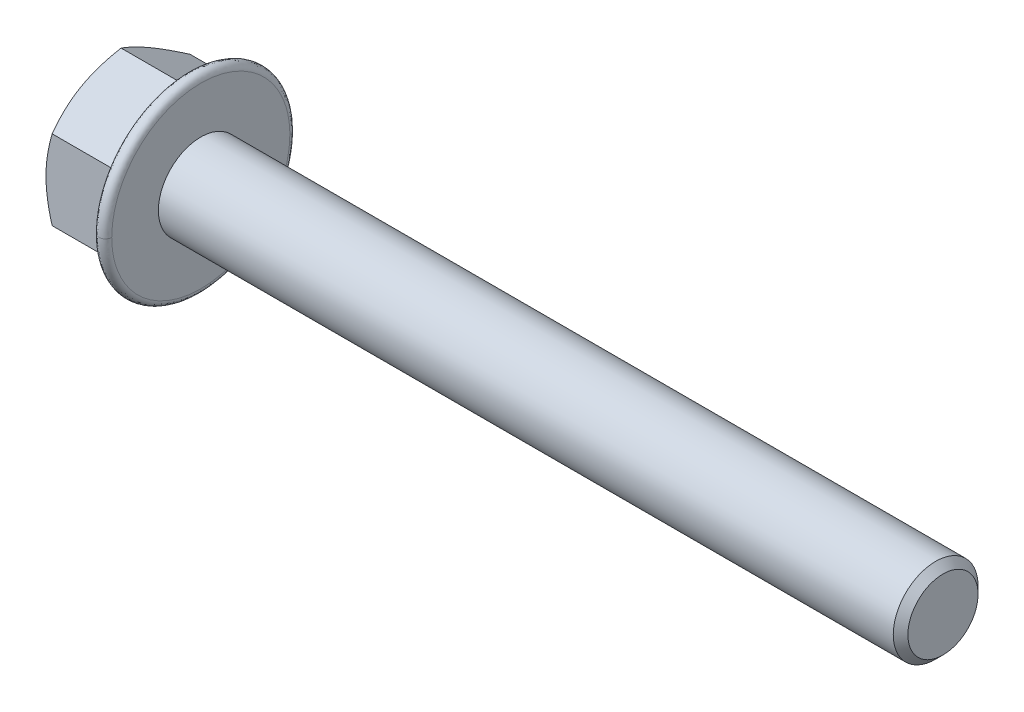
ISO-10303-21;
HEADER;
FILE_DESCRIPTION(('STEP AP214'),'2;1');
FILE_NAME('part.step','',(''),(''),'','','');
FILE_SCHEMA(('AUTOMOTIVE_DESIGN { 1 0 10303 214 1 1 1 1 }'));
ENDSEC;
DATA;
#1=APPLICATION_CONTEXT('core data for automotive mechanical design processes');
#2=APPLICATION_PROTOCOL_DEFINITION('international standard','automotive_design',2000,#1);
#3=PRODUCT_CONTEXT('',#1,'mechanical');
#4=PRODUCT('Part','Part','',(#3));
#5=PRODUCT_RELATED_PRODUCT_CATEGORY('part','',(#4));
#6=PRODUCT_DEFINITION_FORMATION('','',#4);
#7=PRODUCT_DEFINITION_CONTEXT('part definition',#1,'design');
#8=PRODUCT_DEFINITION('design','',#6,#7);
#9=PRODUCT_DEFINITION_SHAPE('','',#8);
#10=(LENGTH_UNIT() NAMED_UNIT(*) SI_UNIT(.MILLI.,.METRE.));
#11=(NAMED_UNIT(*) PLANE_ANGLE_UNIT() SI_UNIT($,.RADIAN.));
#12=(NAMED_UNIT(*) SI_UNIT($,.STERADIAN.) SOLID_ANGLE_UNIT());
#13=UNCERTAINTY_MEASURE_WITH_UNIT(LENGTH_MEASURE(1.E-05),#10,'distance_accuracy_value','');
#14=(GEOMETRIC_REPRESENTATION_CONTEXT(3) GLOBAL_UNCERTAINTY_ASSIGNED_CONTEXT((#13)) GLOBAL_UNIT_ASSIGNED_CONTEXT((#10,
#11,#12)) REPRESENTATION_CONTEXT('',''));
#15=CARTESIAN_POINT('',(0.,0.,0.));
#16=DIRECTION('',(0.,0.,1.));
#17=DIRECTION('',(1.,0.,0.));
#18=AXIS2_PLACEMENT_3D('',#15,#16,#17);
#19=CARTESIAN_POINT('',(0.,-6.578,6.578));
#20=DIRECTION('',(1.,0.,0.));
#21=DIRECTION('',(0.,0.,-1.));
#22=AXIS2_PLACEMENT_3D('',#19,#20,#21);
#23=PLANE('',#22);
#24=CARTESIAN_POINT('',(0.,-5.62916512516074,-3.24999999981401));
#25=CARTESIAN_POINT('',(0.,-5.53772428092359,-3.40841961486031));
#26=CARTESIAN_POINT('',(0.,-5.43956469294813,-3.5629569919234));
#27=CARTESIAN_POINT('',(0.,-5.23058394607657,-3.86320810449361));
#28=CARTESIAN_POINT('',(0.,-5.11976343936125,-4.00892229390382));
#29=CARTESIAN_POINT('',(0.,-4.8864380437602,-4.29023018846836));
#30=CARTESIAN_POINT('',(0.,-4.76395461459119,-4.42584169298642));
#31=CARTESIAN_POINT('',(0.,-4.50801082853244,-4.6862742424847));
#32=CARTESIAN_POINT('',(0.,-4.3745505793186,-4.81109539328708));
#33=CARTESIAN_POINT('',(0.,-4.0975164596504,-5.04913178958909));
#34=CARTESIAN_POINT('',(0.,-3.95393670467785,-5.16234018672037));
#35=CARTESIAN_POINT('',(0.,-3.65768801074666,-5.37631101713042));
#36=CARTESIAN_POINT('',(0.,-3.50501505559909,-5.47706788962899));
#37=CARTESIAN_POINT('',(0.,-3.19168765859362,-5.66538124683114));
#38=CARTESIAN_POINT('',(0.,-3.03103149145,-5.75293486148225));
#39=CARTESIAN_POINT('',(0.,-2.70298593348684,-5.91415750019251));
#40=CARTESIAN_POINT('',(0.,-2.53559937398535,-5.98783229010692));
#41=CARTESIAN_POINT('',(0.,-2.1777557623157,-6.12763848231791));
#42=CARTESIAN_POINT('',(0.,-1.98669225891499,-6.19222330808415));
#43=CARTESIAN_POINT('',(0.,-1.59937578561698,-6.30338055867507));
#44=CARTESIAN_POINT('',(0.,-1.40312216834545,-6.34995072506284));
#45=CARTESIAN_POINT('',(0.,-1.00660598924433,-6.42475907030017));
#46=CARTESIAN_POINT('',(0.,-0.806334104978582,-6.45294786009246));
#47=CARTESIAN_POINT('',(0.,-0.40404269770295,-6.49058287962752));
#48=CARTESIAN_POINT('',(0.,-0.202023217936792,-6.50002957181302));
#49=CARTESIAN_POINT('',(0.,8.54210375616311E-10,-6.50000000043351));
#50=B_SPLINE_CURVE_WITH_KNOTS('',3,(#24,#25,#26,#27,#28,#29,#30,#31,#32,#33,#34,#35,#36,#37,#38,
#39,#40,#41,#42,#43,#44,#45,#46,#47,#48,#49),.UNSPECIFIED.,.F.,.F.,(4,2,2,2,2,2,2,2,2,2,2,2,4),
(0.,0.548579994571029,1.09713174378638,1.64469297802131,2.19224884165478,2.74012578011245,
3.28824651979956,3.83648623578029,4.38449768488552,4.9886641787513,5.59290639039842,
6.19876552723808,6.80460971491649),.UNSPECIFIED.);
#51=CARTESIAN_POINT('',(-1.38339215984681E-10,-5.62916512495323,-3.24999999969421));
#52=VERTEX_POINT('',#51);
#53=CARTESIAN_POINT('',(0.,8.54211072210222E-10,-6.50000000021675));
#54=VERTEX_POINT('',#53);
#55=EDGE_CURVE('E123',#52,#54,#50,.T.);
#56=ORIENTED_EDGE('',*,*,#55,.F.);
#57=CARTESIAN_POINT('',(0.,-5.62916512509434,3.24999999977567));
#58=CARTESIAN_POINT('',(0.,-5.72064011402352,3.09160009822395));
#59=CARTESIAN_POINT('',(0.,-5.80539361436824,2.92932271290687));
#60=CARTESIAN_POINT('',(0.,-5.96092833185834,2.59821452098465));
#61=CARTESIAN_POINT('',(0.,-6.0317102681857,2.4293840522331));
#62=CARTESIAN_POINT('',(0.,-6.15866735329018,2.08666438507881));
#63=CARTESIAN_POINT('',(0.,-6.2148686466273,1.91278487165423));
#64=CARTESIAN_POINT('',(0.,-6.31243795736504,1.56091477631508));
#65=CARTESIAN_POINT('',(0.,-6.35380612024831,1.38292423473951));
#66=CARTESIAN_POINT('',(0.,-6.42143462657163,1.02398745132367));
#67=CARTESIAN_POINT('',(0.,-6.44768609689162,0.84303953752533));
#68=CARTESIAN_POINT('',(0.,-6.48486592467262,0.479495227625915));
#69=CARTESIAN_POINT('',(0.,-6.49578745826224,0.296898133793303));
#70=CARTESIAN_POINT('',(0.,-6.50220791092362,-0.0686080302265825));
#71=CARTESIAN_POINT('',(0.,-6.4977034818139,-0.251517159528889));
#72=CARTESIAN_POINT('',(0.,-6.47330360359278,-0.616224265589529));
#73=CARTESIAN_POINT('',(0.,-6.45341456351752,-0.798022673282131));
#74=CARTESIAN_POINT('',(0.,-6.39556847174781,-1.17782742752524));
#75=CARTESIAN_POINT('',(0.,-6.35596881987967,-1.37558568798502));
#76=CARTESIAN_POINT('',(0.,-6.2585755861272,-1.76659021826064));
#77=CARTESIAN_POINT('',(0.,-6.20077972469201,-1.95983591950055));
#78=CARTESIAN_POINT('',(0.,-6.06730756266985,-2.34063317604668));
#79=CARTESIAN_POINT('',(0.,-5.99158382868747,-2.52816811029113));
#80=CARTESIAN_POINT('',(0.,-5.82303100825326,-2.89538019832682));
#81=CARTESIAN_POINT('',(0.,-5.73020234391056,-3.07505754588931));
#82=CARTESIAN_POINT('',(0.,-5.62916512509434,-3.24999999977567));
#83=B_SPLINE_CURVE_WITH_KNOTS('',3,(#57,#58,#59,#60,#61,#62,#63,#64,#65,#66,#67,#68,#69,#70,#71,
#72,#73,#74,#75,#76,#77,#78,#79,#80,#81,#82),.UNSPECIFIED.,.F.,.F.,(4,2,2,2,2,2,2,2,2,2,2,2,4),
(0.,0.548579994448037,1.09713174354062,1.6446929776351,2.1922488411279,2.74012577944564,
3.28824651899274,3.83648623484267,4.38449768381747,4.9886641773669,5.59290638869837,
6.19876552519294,6.80460971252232),.UNSPECIFIED.);
#84=CARTESIAN_POINT('',(-1.16205312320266E-10,-5.62916512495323,3.2499999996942));
#85=VERTEX_POINT('',#84);
#86=EDGE_CURVE('E120',#85,#52,#83,.T.);
#87=ORIENTED_EDGE('',*,*,#86,.F.);
#88=CARTESIAN_POINT('',(0.,0.,6.5000000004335));
#89=CARTESIAN_POINT('',(0.,-0.182915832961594,6.50001971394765));
#90=CARTESIAN_POINT('',(0.,-0.365828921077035,6.49227970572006));
#91=CARTESIAN_POINT('',(0.,-0.730344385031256,6.46142262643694));
#92=CARTESIAN_POINT('',(0.,-0.911946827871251,6.43830634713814));
#93=CARTESIAN_POINT('',(0.,-1.27222930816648,6.37689457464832));
#94=CARTESIAN_POINT('',(0.,-1.45091403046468,6.33862656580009));
#95=CARTESIAN_POINT('',(0.,-1.8044271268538,6.24718902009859));
#96=CARTESIAN_POINT('',(0.,-1.97925553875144,6.19401962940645));
#97=CARTESIAN_POINT('',(0.,-2.32391816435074,6.07311924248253));
#98=CARTESIAN_POINT('',(0.,-2.49374938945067,6.00537972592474));
#99=CARTESIAN_POINT('',(0.,-2.8271779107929,5.85580624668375));
#100=CARTESIAN_POINT('',(0.,-2.99077239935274,5.77396602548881));
#101=CARTESIAN_POINT('',(0.,-3.31052024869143,5.59677321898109));
#102=CARTESIAN_POINT('',(0.,-3.46667198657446,5.50141770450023));
#103=CARTESIAN_POINT('',(0.,-3.77031766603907,5.29793323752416));
#104=CARTESIAN_POINT('',(0.,-3.91781518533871,5.18980961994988));
#105=CARTESIAN_POINT('',(0.,-4.21781270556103,4.94981105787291));
#106=CARTESIAN_POINT('',(0.,-4.36927655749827,4.81663762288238));
#107=CARTESIAN_POINT('',(0.,-4.65919979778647,4.53679034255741));
#108=CARTESIAN_POINT('',(0.,-4.79765755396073,4.39011480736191));
#109=CARTESIAN_POINT('',(0.,-5.06070157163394,4.08412589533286));
#110=CARTESIAN_POINT('',(0.,-5.18524972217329,3.92477975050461));
#111=CARTESIAN_POINT('',(0.,-5.41898830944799,3.59520268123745));
#112=CARTESIAN_POINT('',(0.,-5.52817912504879,3.42497202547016));
#113=CARTESIAN_POINT('',(0.,-5.62916512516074,3.24999999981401));
#114=B_SPLINE_CURVE_WITH_KNOTS('',3,(#88,#89,#90,#91,#92,#93,#94,#95,#96,#97,#98,#99,#100,#101,
#102,#103,#104,#105,#106,#107,#108,#109,#110,#111,#112,#113),.UNSPECIFIED.,.F.,.F.,(4,2,2,2,2,2,
2,2,2,2,2,2,4),(0.,0.548579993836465,1.09713174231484,1.64469297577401,2.1922488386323,
2.74012577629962,3.28824651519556,3.83648623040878,4.38449767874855,4.98866417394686,
5.59290638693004,6.19876552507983,6.80460971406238),.UNSPECIFIED.);
#115=CARTESIAN_POINT('',(-1.25142125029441E-10,0.,6.50000000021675));
#116=VERTEX_POINT('',#115);
#117=EDGE_CURVE('E130',#116,#85,#114,.T.);
#118=ORIENTED_EDGE('',*,*,#117,.F.);
#119=CARTESIAN_POINT('',(0.,5.62916512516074,3.24999999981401));
#120=CARTESIAN_POINT('',(0.,5.53772428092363,3.40841961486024));
#121=CARTESIAN_POINT('',(0.,5.43956469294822,3.56295699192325));
#122=CARTESIAN_POINT('',(0.,5.23058394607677,3.86320810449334));
#123=CARTESIAN_POINT('',(0.,5.11976343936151,4.00892229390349));
#124=CARTESIAN_POINT('',(0.,4.88643804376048,4.29023018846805));
#125=CARTESIAN_POINT('',(0.,4.76395461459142,4.42584169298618));
#126=CARTESIAN_POINT('',(0.,4.50801082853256,4.68627424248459));
#127=CARTESIAN_POINT('',(0.,4.37455057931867,4.81109539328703));
#128=CARTESIAN_POINT('',(0.,4.09751645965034,5.04913178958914));
#129=CARTESIAN_POINT('',(0.,3.95393670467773,5.16234018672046));
#130=CARTESIAN_POINT('',(0.,3.65768801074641,5.3763110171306));
#131=CARTESIAN_POINT('',(0.,3.50501505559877,5.47706788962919));
#132=CARTESIAN_POINT('',(0.,3.19168765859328,5.66538124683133));
#133=CARTESIAN_POINT('',(0.,3.03103149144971,5.7529348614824));
#134=CARTESIAN_POINT('',(0.,2.70298593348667,5.91415750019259));
#135=CARTESIAN_POINT('',(0.,2.53559937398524,5.98783229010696));
#136=CARTESIAN_POINT('',(0.,2.17775576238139,6.12763848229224));
#137=CARTESIAN_POINT('',(0.,1.98669225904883,6.19222330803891));
#138=CARTESIAN_POINT('',(0.,1.59937578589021,6.30338055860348));
#139=CARTESIAN_POINT('',(0.,1.40312216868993,6.34995072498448));
#140=CARTESIAN_POINT('',(0.,1.00660598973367,6.42475907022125));
#141=CARTESIAN_POINT('',(0.,0.806334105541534,6.45294786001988));
#142=CARTESIAN_POINT('',(0.,0.404042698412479,6.49058287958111));
#143=CARTESIAN_POINT('',(0.,0.202023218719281,6.50002957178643));
#144=CARTESIAN_POINT('',(0.,0.,6.50000000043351));
#145=B_SPLINE_CURVE_WITH_KNOTS('',3,(#119,#120,#121,#122,#123,#124,#125,#126,#127,#128,#129,
#130,#131,#132,#133,#134,#135,#136,#137,#138,#139,#140,#141,#142,#143,#144),.UNSPECIFIED.,.F.,
.F.,(4,2,2,2,2,2,2,2,2,2,2,2,4),(0.,0.548579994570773,1.09713174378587,1.64469297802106,
2.19224884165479,2.74012578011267,3.28824651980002,3.83648623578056,4.38449768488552,
4.98866417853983,5.59290638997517,6.19876552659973,6.80460971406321),.UNSPECIFIED.);
#146=CARTESIAN_POINT('',(-1.38339572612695E-10,5.62916512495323,3.2499999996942));
#147=VERTEX_POINT('',#146);
#148=EDGE_CURVE('E309',#147,#116,#145,.T.);
#149=ORIENTED_EDGE('',*,*,#148,.F.);
#150=CARTESIAN_POINT('',(0.,5.62916512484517,-3.25000000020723));
#151=CARTESIAN_POINT('',(0.,5.72064011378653,-3.09160009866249));
#152=CARTESIAN_POINT('',(0.,5.80539361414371,-2.92932271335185));
#153=CARTESIAN_POINT('',(0.,5.96092833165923,-2.59821452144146));
#154=CARTESIAN_POINT('',(0.,6.03171026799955,-2.42938405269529));
#155=CARTESIAN_POINT('',(0.,6.15866735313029,-2.08666438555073));
#156=CARTESIAN_POINT('',(0.,6.21486864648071,-1.9127848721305));
#157=CARTESIAN_POINT('',(0.,6.31243795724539,-1.56091477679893));
#158=CARTESIAN_POINT('',(0.,6.3538061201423,-1.38292423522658));
#159=CARTESIAN_POINT('',(0.,6.42143462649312,-1.023987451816));
#160=CARTESIAN_POINT('',(0.,6.44768609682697,-0.843039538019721));
#161=CARTESIAN_POINT('',(0.,6.48486592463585,-0.479495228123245));
#162=CARTESIAN_POINT('',(0.,6.49578745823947,-0.296898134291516));
#163=CARTESIAN_POINT('',(0.,6.50220791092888,0.0686080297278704));
#164=CARTESIAN_POINT('',(0.,6.49770348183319,0.251517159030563));
#165=CARTESIAN_POINT('',(0.,6.47330360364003,0.616224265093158));
#166=CARTESIAN_POINT('',(0.,6.45341456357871,0.798022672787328));
#167=CARTESIAN_POINT('',(0.,6.39556847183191,1.17782742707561));
#168=CARTESIAN_POINT('',(0.,6.35596881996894,1.37558568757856));
#169=CARTESIAN_POINT('',(0.,6.2585755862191,1.76659021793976));
#170=CARTESIAN_POINT('',(0.,6.20077972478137,1.95983591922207));
#171=CARTESIAN_POINT('',(0.,6.06730756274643,2.34063317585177));
#172=CARTESIAN_POINT('',(0.,5.99158382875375,2.52816811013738));
#173=CARTESIAN_POINT('',(0.,5.82303100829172,2.89538019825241));
#174=CARTESIAN_POINT('',(0.,5.7302023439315,3.07505754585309));
#175=CARTESIAN_POINT('',(0.,5.62916512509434,3.24999999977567));
#176=B_SPLINE_CURVE_WITH_KNOTS('',3,(#150,#151,#152,#153,#154,#155,#156,#157,#158,#159,#160,
#161,#162,#163,#164,#165,#166,#167,#168,#169,#170,#171,#172,#173,#174,#175),.UNSPECIFIED.,.F.,
.F.,(4,2,2,2,2,2,2,2,2,2,2,2,4),(0.,0.54857999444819,1.09713174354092,1.64469297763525,
2.19224884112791,2.74012577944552,3.28824651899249,3.83648623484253,4.38449768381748,
4.98866417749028,5.5929063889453,6.19876552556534,6.80460971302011),.UNSPECIFIED.);
#177=CARTESIAN_POINT('',(-1.16205668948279E-10,5.62916512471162,-3.25000000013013));
#178=VERTEX_POINT('',#177);
#179=EDGE_CURVE('E195',#178,#147,#176,.T.);
#180=ORIENTED_EDGE('',*,*,#179,.F.);
#181=CARTESIAN_POINT('',(0.,8.54211035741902E-10,-6.5));
#182=CARTESIAN_POINT('',(0.,0.182915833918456,-6.5000197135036));
#183=CARTESIAN_POINT('',(0.,0.365828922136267,-6.49227970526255));
#184=CARTESIAN_POINT('',(0.,0.730344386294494,-6.46142262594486));
#185=CARTESIAN_POINT('',(0.,0.911946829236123,-6.4383063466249));
#186=CARTESIAN_POINT('',(0.,1.27222930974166,-6.37689457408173));
#187=CARTESIAN_POINT('',(0.,1.4509140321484,-6.33862656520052));
#188=CARTESIAN_POINT('',(0.,1.80442712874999,-6.24718901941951));
#189=CARTESIAN_POINT('',(0.,1.97925554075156,-6.19401962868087));
#190=CARTESIAN_POINT('',(0.,2.32391816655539,-6.07311924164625));
#191=CARTESIAN_POINT('',(0.,2.49374939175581,-6.00537972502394));
#192=CARTESIAN_POINT('',(0.,2.82717791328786,-5.8558062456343));
#193=CARTESIAN_POINT('',(0.,2.99077240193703,-5.77396602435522));
#194=CARTESIAN_POINT('',(0.,3.31052025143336,-5.59677321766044));
#195=CARTESIAN_POINT('',(0.,3.46667198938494,-5.50141770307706));
#196=CARTESIAN_POINT('',(0.,3.77031766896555,-5.29793323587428));
#197=CARTESIAN_POINT('',(0.,3.91781518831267,-5.18980961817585));
#198=CARTESIAN_POINT('',(0.,4.21781270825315,-4.94981105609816));
#199=CARTESIAN_POINT('',(0.,4.36927655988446,-4.81663762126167));
#200=CARTESIAN_POINT('',(0.,4.6591997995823,-4.53679034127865));
#201=CARTESIAN_POINT('',(0.,4.79765755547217,-4.39011480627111));
#202=CARTESIAN_POINT('',(0.,5.06070157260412,-4.0841258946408));
#203=CARTESIAN_POINT('',(0.,5.18524972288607,-3.92477975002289));
#204=CARTESIAN_POINT('',(0.,5.41898830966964,-3.59520268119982));
#205=CARTESIAN_POINT('',(0.,5.5281791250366,-3.42497202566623));
#206=CARTESIAN_POINT('',(0.,5.62916512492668,-3.25000000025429));
#207=B_SPLINE_CURVE_WITH_KNOTS('',3,(#181,#182,#183,#184,#185,#186,#187,#188,#189,#190,#191,
#192,#193,#194,#195,#196,#197,#198,#199,#200,#201,#202,#203,#204,#205,#206),.UNSPECIFIED.,.F.,
.F.,(4,2,2,2,2,2,2,2,2,2,2,2,4),(0.,0.548579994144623,1.09713174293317,1.64469297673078,
2.19224883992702,2.74012577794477,3.28824651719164,3.83648623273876,4.38449768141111,
4.98866417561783,5.59290638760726,6.19876552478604,6.80460971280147),.UNSPECIFIED.);
#208=EDGE_CURVE('E126',#54,#178,#207,.T.);
#209=ORIENTED_EDGE('',*,*,#208,.F.);
#210=EDGE_LOOP('',(#56,#87,#118,#149,#180,#209));
#211=FACE_BOUND('',#210,.T.);
#212=ADVANCED_FACE('F17',(#211),#23,.F.);
#213=CARTESIAN_POINT('',(0.642443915,-6.568784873,3.847721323));
#214=CARTESIAN_POINT('',(0.642443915,-7.99574723,1.411627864));
#215=CARTESIAN_POINT('',(0.642443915,-7.99574723,-1.411627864));
#216=CARTESIAN_POINT('',(0.642443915,-6.568784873,-3.847721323));
#217=CARTESIAN_POINT('',(0.,-5.608633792,3.285304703));
#218=CARTESIAN_POINT('',(0.,-6.827018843,1.205291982));
#219=CARTESIAN_POINT('',(0.,-6.827018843,-1.205291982));
#220=CARTESIAN_POINT('',(0.,-5.608633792,-3.285304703));
#221=(BOUNDED_SURFACE() B_SPLINE_SURFACE(1,3,((#213,#214,#215,#216),(#217,#218,#219,#220)),
.UNSPECIFIED.,.F.,.F.,.F.) B_SPLINE_SURFACE_WITH_KNOTS((2,2),(4,4),(0.,1.),(0.,1.),
.UNSPECIFIED.) GEOMETRIC_REPRESENTATION_ITEM() RATIONAL_B_SPLINE_SURFACE(((1.,0.908577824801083,
0.908577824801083,1.),(1.,0.908577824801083,0.908577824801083,1.))) REPRESENTATION_ITEM('') SURFACE());
#222=CARTESIAN_POINT('',(-2.32411337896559E-10,-5.62916512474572,-3.2499999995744));
#223=CARTESIAN_POINT('',(-2.21771688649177E-05,-5.70508237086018,-3.11850747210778));
#224=CARTESIAN_POINT('',(0.00307094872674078,-5.78099659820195,-2.98702017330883));
#225=CARTESIAN_POINT('',(0.0153208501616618,-5.93265188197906,-2.72434551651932));
#226=CARTESIAN_POINT('',(0.0244735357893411,-6.00839302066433,-2.59315801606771));
#227=CARTESIAN_POINT('',(0.0486737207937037,-6.15962336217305,-2.33121938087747));
#228=CARTESIAN_POINT('',(0.0637201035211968,-6.23511260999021,-2.20046816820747));
#229=CARTESIAN_POINT('',(0.099294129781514,-6.38527437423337,-1.94038036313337));
#230=CARTESIAN_POINT('',(0.119785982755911,-6.45994902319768,-1.81104007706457));
#231=CARTESIAN_POINT('',(0.165937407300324,-6.60890509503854,-1.55304059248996));
#232=CARTESIAN_POINT('',(0.191597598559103,-6.68318646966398,-1.42438147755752));
#233=CARTESIAN_POINT('',(0.247675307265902,-6.83129092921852,-1.16785702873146));
#234=CARTESIAN_POINT('',(0.278092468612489,-6.90511404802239,-1.03999163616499));
#235=CARTESIAN_POINT('',(0.349819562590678,-7.06709430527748,-0.759433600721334));
#236=CARTESIAN_POINT('',(0.392089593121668,-7.15514473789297,-0.606925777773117));
#237=CARTESIAN_POINT('',(0.482277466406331,-7.33076997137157,-0.30273395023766));
#238=CARTESIAN_POINT('',(0.53020996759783,-7.41834289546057,-0.151053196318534));
#239=CARTESIAN_POINT('',(0.580556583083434,-7.50555349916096,2.7877801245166E-10));
#240=B_SPLINE_CURVE_WITH_KNOTS('',3,(#222,#223,#224,#225,#226,#227,#228,#229,#230,#231,#232,
#233,#234,#235,#236,#237,#238,#239),.UNSPECIFIED.,.F.,.F.,(4,2,2,2,2,2,2,2,4),(0.,
0.45546226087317,0.910617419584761,1.36568638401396,1.81783535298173,2.27003856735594,
2.72220794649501,3.26541977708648,3.81006997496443),.UNSPECIFIED.);
#241=CARTESIAN_POINT('',(0.580556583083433,-7.50555349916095,0.));
#242=VERTEX_POINT('',#241);
#243=EDGE_CURVE('E139',#52,#242,#240,.T.);
#244=CARTESIAN_POINT('',(0.580556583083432,-7.50555349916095,-2.78779001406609E-10));
#245=CARTESIAN_POINT('',(0.549366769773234,-7.45152934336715,0.0935725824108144));
#246=CARTESIAN_POINT('',(0.519107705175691,-7.39737111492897,0.187377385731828));
#247=CARTESIAN_POINT('',(0.460603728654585,-7.28875591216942,0.375504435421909));
#248=CARTESIAN_POINT('',(0.43235978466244,-7.23429880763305,0.469826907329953));
#249=CARTESIAN_POINT('',(0.350872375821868,-7.07040839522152,0.753693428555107));
#250=CARTESIAN_POINT('',(0.300932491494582,-6.96055734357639,0.943961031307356));
#251=CARTESIAN_POINT('',(0.211299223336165,-6.73983347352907,1.32626598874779));
#252=CARTESIAN_POINT('',(0.171603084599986,-6.62896093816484,1.51830285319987));
#253=CARTESIAN_POINT('',(0.115349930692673,-6.44422487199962,1.83827510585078));
#254=CARTESIAN_POINT('',(0.0955158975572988,-6.3706091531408,1.96578127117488));
#255=CARTESIAN_POINT('',(0.06123110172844,-6.22306251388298,2.22133954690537));
#256=CARTESIAN_POINT('',(0.0467803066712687,-6.14913159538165,2.34939165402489));
#257=CARTESIAN_POINT('',(0.0235204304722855,-6.00092481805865,2.60609332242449));
#258=CARTESIAN_POINT('',(0.0147206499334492,-5.92664859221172,2.73474351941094));
#259=CARTESIAN_POINT('',(0.00294981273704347,-5.77797091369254,2.99226081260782));
#260=CARTESIAN_POINT('',(-2.04355683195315E-05,-5.70356944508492,3.12112793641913));
#261=CARTESIAN_POINT('',(-2.32411195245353E-10,-5.62916512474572,3.2499999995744));
#262=B_SPLINE_CURVE_WITH_KNOTS('',3,(#244,#245,#246,#247,#248,#249,#250,#251,#252,#253,#254,
#255,#256,#257,#258,#259,#260,#261),.UNSPECIFIED.,.F.,.F.,(4,2,2,2,2,2,2,2,4),(0.,
0.337372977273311,0.67490693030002,1.35060789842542,2.02612695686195,2.47172326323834,
2.91731689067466,3.36364202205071,3.81002903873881),.UNSPECIFIED.);
#263=EDGE_CURVE('E145',#242,#85,#262,.T.);
#264=ORIENTED_EDGE('',*,*,#86,.T.);
#265=ORIENTED_EDGE('',*,*,#243,.T.);
#266=ORIENTED_EDGE('',*,*,#263,.T.);
#267=EDGE_LOOP('',(#264,#265,#266));
#268=FACE_BOUND('',#267,.T.);
#269=ADVANCED_FACE('F143',(#268),#221,.T.);
#270=CARTESIAN_POINT('',(78.1,-3.349214,-3.349214));
#271=DIRECTION('',(-1.,0.,0.));
#272=DIRECTION('',(0.,0.,1.));
#273=AXIS2_PLACEMENT_3D('',#270,#271,#272);
#274=PLANE('',#273);
#275=CARTESIAN_POINT('',(78.1,0.,0.));
#276=DIRECTION('',(-1.,0.,0.));
#277=DIRECTION('',(0.,0.,1.));
#278=AXIS2_PLACEMENT_3D('',#275,#276,#277);
#279=CIRCLE('',#278,3.30950000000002);
#280=CARTESIAN_POINT('',(78.1,0.,3.30950000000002));
#281=VERTEX_POINT('',#280);
#282=EDGE_CURVE('E153',#281,#281,#279,.T.);
#283=ORIENTED_EDGE('',*,*,#282,.F.);
#284=EDGE_LOOP('',(#283));
#285=FACE_BOUND('',#284,.T.);
#286=ADVANCED_FACE('F176',(#285),#274,.F.);
#287=CARTESIAN_POINT('',(0.642443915,0.047831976,7.612595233));
#288=CARTESIAN_POINT('',(0.642443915,-2.775368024,7.630334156));
#289=CARTESIAN_POINT('',(0.642443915,-5.220379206,6.218706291));
#290=CARTESIAN_POINT('',(0.642443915,-6.616616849,3.76487391));
#291=CARTESIAN_POINT('',(0.,0.040840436,6.499871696));
#292=CARTESIAN_POINT('',(0.,-2.369695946,6.515017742));
#293=CARTESIAN_POINT('',(0.,-4.457322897,5.309725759));
#294=CARTESIAN_POINT('',(0.,-5.649474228,3.214566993));
#295=(BOUNDED_SURFACE() B_SPLINE_SURFACE(1,3,((#287,#288,#289,#290),(#291,#292,#293,#294)),
.UNSPECIFIED.,.F.,.F.,.F.) B_SPLINE_SURFACE_WITH_KNOTS((2,2),(4,4),(0.,1.),(0.,1.),
.UNSPECIFIED.) GEOMETRIC_REPRESENTATION_ITEM() RATIONAL_B_SPLINE_SURFACE(((1.,0.908577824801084,
0.908577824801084,1.),(1.,0.908577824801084,0.908577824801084,1.))) REPRESENTATION_ITEM('') SURFACE());
#296=CARTESIAN_POINT('',(-2.76678717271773E-10,-5.62916512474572,3.2499999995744));
#297=CARTESIAN_POINT('',(-2.21772091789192E-05,-5.55324787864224,3.38149252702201));
#298=CARTESIAN_POINT('',(0.00307094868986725,-5.47733365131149,3.51297982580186));
#299=CARTESIAN_POINT('',(0.0153208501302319,-5.32567836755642,3.77565448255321));
#300=CARTESIAN_POINT('',(0.0244735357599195,-5.24993722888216,3.90684198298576));
#301=CARTESIAN_POINT('',(0.0486737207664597,-5.0987068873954,4.16878061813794));
#302=CARTESIAN_POINT('',(0.0637201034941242,-5.02321763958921,4.29953183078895));
#303=CARTESIAN_POINT('',(0.0992941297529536,-4.87305587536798,4.55961963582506));
#304=CARTESIAN_POINT('',(0.119785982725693,-4.79838122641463,4.68895992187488));
#305=CARTESIAN_POINT('',(0.165937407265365,-4.64942515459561,4.94695940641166));
#306=CARTESIAN_POINT('',(0.191597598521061,-4.57514377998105,5.07561852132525));
#307=CARTESIAN_POINT('',(0.247675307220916,-4.4270393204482,5.33214297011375));
#308=CARTESIAN_POINT('',(0.278092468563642,-4.35321620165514,5.4600083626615));
#309=CARTESIAN_POINT('',(0.349819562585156,-4.19123594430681,5.74056639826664));
#310=CARTESIAN_POINT('',(0.39208959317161,-4.1031855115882,5.89307422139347));
#311=CARTESIAN_POINT('',(0.482277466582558,-3.92756027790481,6.19726604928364));
#312=CARTESIAN_POINT('',(0.530209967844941,-3.83998735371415,6.34894680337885));
#313=CARTESIAN_POINT('',(0.580556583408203,-3.75277674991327,6.50000000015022));
#314=B_SPLINE_CURVE_WITH_KNOTS('',3,(#296,#297,#298,#299,#300,#301,#302,#303,#304,#305,#306,
#307,#308,#309,#310,#311,#312,#313),.UNSPECIFIED.,.F.,.F.,(4,2,2,2,2,2,2,2,4),(0.,
0.455462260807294,0.910617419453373,1.36568638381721,1.81783535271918,2.27003856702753,
2.72220794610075,3.26541977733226,3.81006997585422),.UNSPECIFIED.);
#315=CARTESIAN_POINT('',(0.580556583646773,-3.75277674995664,6.50000000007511));
#316=VERTEX_POINT('',#315);
#317=EDGE_CURVE('E140',#85,#316,#314,.T.);
#318=CARTESIAN_POINT('',(0.580556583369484,-3.75277675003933,6.5));
#319=CARTESIAN_POINT('',(0.549366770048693,-3.64472843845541,6.50000000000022));
#320=CARTESIAN_POINT('',(0.519107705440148,-3.53641198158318,6.50000000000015));
#321=CARTESIAN_POINT('',(0.460603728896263,-3.31918157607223,6.49999999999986));
#322=CARTESIAN_POINT('',(0.432359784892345,-3.21026736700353,6.49999999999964));
#323=CARTESIAN_POINT('',(0.350872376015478,-2.88248654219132,6.49999999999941));
#324=CARTESIAN_POINT('',(0.300932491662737,-2.66278443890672,6.49999999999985));
#325=CARTESIAN_POINT('',(0.211299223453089,-2.22133669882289,6.50000000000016));
#326=CARTESIAN_POINT('',(0.171603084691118,-1.99959162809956,6.50000000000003));
#327=CARTESIAN_POINT('',(0.115349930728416,-1.63011949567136,6.49999999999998));
#328=CARTESIAN_POINT('',(0.0955158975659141,-1.48288805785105,6.49999999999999));
#329=CARTESIAN_POINT('',(0.0612311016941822,-1.1877947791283,6.50000000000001));
#330=CARTESIAN_POINT('',(0.0467803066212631,-1.03993294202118,6.5));
#331=CARTESIAN_POINT('',(0.0235204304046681,-0.743519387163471,6.5));
#332=CARTESIAN_POINT('',(0.014720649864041,-0.594966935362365,6.5));
#333=CARTESIAN_POINT('',(0.00294981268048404,-0.297611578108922,6.5));
#334=CARTESIAN_POINT('',(-2.04356102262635E-05,-0.148808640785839,6.5));
#335=CARTESIAN_POINT('',(-2.50284820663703E-10,0.,6.5));
#336=B_SPLINE_CURVE_WITH_KNOTS('',3,(#318,#319,#320,#321,#322,#323,#324,#325,#326,#327,#328,
#329,#330,#331,#332,#333,#334,#335),.UNSPECIFIED.,.F.,.F.,(4,2,2,2,2,2,2,2,4),(0.,
0.337372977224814,0.674906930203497,1.35060789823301,2.02612695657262,2.47172326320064,
2.9173168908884,3.36364202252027,3.81002903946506),.UNSPECIFIED.);
#337=EDGE_CURVE('E270',#316,#116,#336,.T.);
#338=ORIENTED_EDGE('',*,*,#117,.T.);
#339=ORIENTED_EDGE('',*,*,#317,.T.);
#340=ORIENTED_EDGE('',*,*,#337,.T.);
#341=EDGE_LOOP('',(#338,#339,#340));
#342=FACE_BOUND('',#341,.T.);
#343=ADVANCED_FACE('F177',(#342),#295,.T.);
#344=CARTESIAN_POINT('',(0.642443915,-6.616616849,-3.76487391));
#345=CARTESIAN_POINT('',(0.642443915,-5.220379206,-6.218706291));
#346=CARTESIAN_POINT('',(0.642443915,-2.775368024,-7.630334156));
#347=CARTESIAN_POINT('',(0.642443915,0.047831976,-7.612595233));
#348=CARTESIAN_POINT('',(0.,-5.649474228,-3.214566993));
#349=CARTESIAN_POINT('',(0.,-4.457322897,-5.309725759));
#350=CARTESIAN_POINT('',(0.,-2.369695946,-6.515017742));
#351=CARTESIAN_POINT('',(0.,0.040840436,-6.499871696));
#352=(BOUNDED_SURFACE() B_SPLINE_SURFACE(1,3,((#344,#345,#346,#347),(#348,#349,#350,#351)),
.UNSPECIFIED.,.F.,.F.,.F.) B_SPLINE_SURFACE_WITH_KNOTS((2,2),(4,4),(0.,1.),(0.,1.),
.UNSPECIFIED.) GEOMETRIC_REPRESENTATION_ITEM() RATIONAL_B_SPLINE_SURFACE(((1.,0.908577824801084,
0.908577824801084,1.),(1.,0.908577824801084,0.908577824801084,1.))) REPRESENTATION_ITEM('') SURFACE());
#353=CARTESIAN_POINT('',(-2.50283822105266E-10,8.54211108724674E-10,-6.5));
#354=CARTESIAN_POINT('',(-2.21772227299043E-05,-0.151834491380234,-6.5));
#355=CARTESIAN_POINT('',(0.0030709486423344,-0.303662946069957,-6.5));
#356=CARTESIAN_POINT('',(0.0153208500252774,-0.60697351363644,-6.5));
#357=CARTESIAN_POINT('',(0.0244735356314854,-0.758455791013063,-6.5));
#358=CARTESIAN_POINT('',(0.0486737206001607,-1.06091647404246,-6.5));
#359=CARTESIAN_POINT('',(0.0637201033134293,-1.21189496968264,-6.5));
#360=CARTESIAN_POINT('',(0.0992941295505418,-1.51221849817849,-6.5));
#361=CARTESIAN_POINT('',(0.119785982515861,-1.66156779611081,-6.5));
#362=CARTESIAN_POINT('',(0.165937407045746,-1.95947993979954,-6.5));
#363=CARTESIAN_POINT('',(0.191597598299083,-2.10804268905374,-6.5));
#364=CARTESIAN_POINT('',(0.247675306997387,-2.40425160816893,-6.5));
#365=CARTESIAN_POINT('',(0.278092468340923,-2.55189784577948,-6.5));
#366=CARTESIAN_POINT('',(0.349819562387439,-2.8758583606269,-6.5));
#367=CARTESIAN_POINT('',(0.392089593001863,-3.05195922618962,-6.5));
#368=CARTESIAN_POINT('',(0.482277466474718,-3.40320969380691,-6.5));
#369=CARTESIAN_POINT('',(0.530209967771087,-3.57835554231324,-6.5));
#370=CARTESIAN_POINT('',(0.580556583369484,-3.75277675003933,-6.5));
#371=B_SPLINE_CURVE_WITH_KNOTS('',3,(#353,#354,#355,#356,#357,#358,#359,#360,#361,#362,#363,
#364,#365,#366,#367,#368,#369,#370),.UNSPECIFIED.,.F.,.F.,(4,2,2,2,2,2,2,2,4),(0.,
0.455462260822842,0.910617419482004,1.36568638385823,1.81783535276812,2.27003856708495,
2.72220794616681,3.26541977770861,3.81006997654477),.UNSPECIFIED.);
#372=CARTESIAN_POINT('',(0.580556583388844,-3.7527767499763,-6.50000000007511));
#373=VERTEX_POINT('',#372);
#374=EDGE_CURVE('E135',#54,#373,#371,.T.);
#375=CARTESIAN_POINT('',(0.580556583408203,-3.75277674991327,-6.50000000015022));
#376=CARTESIAN_POINT('',(0.549366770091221,-3.80680090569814,-6.40642741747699));
#377=CARTESIAN_POINT('',(0.519107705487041,-3.86095913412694,-6.31262261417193));
#378=CARTESIAN_POINT('',(0.460603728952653,-3.96957433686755,-6.12449556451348));
#379=CARTESIAN_POINT('',(0.432359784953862,-4.02403144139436,-6.03017309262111));
#380=CARTESIAN_POINT('',(0.350872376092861,-4.187921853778,-5.74630657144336));
#381=CARTESIAN_POINT('',(0.300932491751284,-4.29777290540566,-5.5560389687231));
#382=CARTESIAN_POINT('',(0.211299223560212,-4.51849677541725,-5.17373401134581));
#383=CARTESIAN_POINT('',(0.171603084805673,-4.62936931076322,-4.98169714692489));
#384=CARTESIAN_POINT('',(0.115349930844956,-4.81410537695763,-4.66172489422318));
#385=CARTESIAN_POINT('',(0.0955158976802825,-4.88772109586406,-4.53421872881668));
#386=CARTESIAN_POINT('',(0.0612311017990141,-5.03526773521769,-4.27866045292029));
#387=CARTESIAN_POINT('',(0.0467803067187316,-5.10919865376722,-4.15060834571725));
#388=CARTESIAN_POINT('',(0.0235204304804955,-5.25740543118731,-3.8939066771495));
#389=CARTESIAN_POINT('',(0.0147206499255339,-5.33168165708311,-3.7652564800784));
#390=CARTESIAN_POINT('',(0.00294981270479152,-5.48035933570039,-3.5077391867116));
#391=CARTESIAN_POINT('',(-2.04356087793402E-05,-5.55476080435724,-3.37887206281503));
#392=CARTESIAN_POINT('',(-2.76679573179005E-10,-5.62916512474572,-3.2499999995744));
#393=B_SPLINE_CURVE_WITH_KNOTS('',3,(#375,#376,#377,#378,#379,#380,#381,#382,#383,#384,#385,
#386,#387,#388,#389,#390,#391,#392),.UNSPECIFIED.,.F.,.F.,(4,2,2,2,2,2,2,2,4),(0.,
0.337372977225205,0.674906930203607,1.35060789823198,2.02612695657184,2.47172326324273,
2.91731689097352,3.36364202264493,3.81002903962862),.UNSPECIFIED.);
#394=EDGE_CURVE('E133',#373,#52,#393,.T.);
#395=ORIENTED_EDGE('',*,*,#55,.T.);
#396=ORIENTED_EDGE('',*,*,#374,.T.);
#397=ORIENTED_EDGE('',*,*,#394,.T.);
#398=EDGE_LOOP('',(#395,#396,#397));
#399=FACE_BOUND('',#398,.T.);
#400=ADVANCED_FACE('F134',(#399),#352,.T.);
#401=CARTESIAN_POINT('',(0.642443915,0.,-7.612745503));
#402=CARTESIAN_POINT('',(0.642443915,2.804840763,-7.612745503));
#403=CARTESIAN_POINT('',(0.642443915,5.229486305,-6.202700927));
#404=CARTESIAN_POINT('',(0.642443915,6.616616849,-3.76487391));
#405=CARTESIAN_POINT('',(0.,0.,-6.5));
#406=CARTESIAN_POINT('',(0.,2.394860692,-6.5));
#407=CARTESIAN_POINT('',(0.,4.465098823,-5.296059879));
#408=CARTESIAN_POINT('',(0.,5.649474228,-3.214566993));
#409=(BOUNDED_SURFACE() B_SPLINE_SURFACE(1,3,((#401,#402,#403,#404),(#405,#406,#407,#408)),
.UNSPECIFIED.,.F.,.F.,.F.) B_SPLINE_SURFACE_WITH_KNOTS((2,2),(4,4),(0.,1.),(0.,1.),
.UNSPECIFIED.) GEOMETRIC_REPRESENTATION_ITEM() RATIONAL_B_SPLINE_SURFACE(((1.,0.909633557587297,
0.909633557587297,1.),(1.,0.909633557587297,0.909633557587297,1.))) REPRESENTATION_ITEM('') SURFACE());
#410=CARTESIAN_POINT('',(0.58055658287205,3.75277674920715,-6.5));
#411=CARTESIAN_POINT('',(0.54938573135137,3.64479413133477,-6.50000000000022));
#412=CARTESIAN_POINT('',(0.51914449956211,3.53654369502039,-6.50000000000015));
#413=CARTESIAN_POINT('',(0.460673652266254,3.31944611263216,-6.49999999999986));
#414=CARTESIAN_POINT('',(0.432445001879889,3.21059870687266,-6.49999999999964));
#415=CARTESIAN_POINT('',(0.350999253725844,2.88301975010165,-6.49999999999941));
#416=CARTESIAN_POINT('',(0.301081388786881,2.6634537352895,-6.49999999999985));
#417=CARTESIAN_POINT('',(0.211477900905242,2.22228041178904,-6.50000000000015));
#418=CARTESIAN_POINT('',(0.171789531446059,2.00067366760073,-6.50000000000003));
#419=CARTESIAN_POINT('',(0.115506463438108,1.63124115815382,-6.49999999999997));
#420=CARTESIAN_POINT('',(0.0956459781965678,1.4839096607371,-6.49999999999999));
#421=CARTESIAN_POINT('',(0.0613150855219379,1.18861504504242,-6.50000000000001));
#422=CARTESIAN_POINT('',(0.0468446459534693,1.04065193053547,-6.5));
#423=CARTESIAN_POINT('',(0.0235529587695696,0.744034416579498,-6.5));
#424=CARTESIAN_POINT('',(0.014741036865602,0.595379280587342,-6.5));
#425=CARTESIAN_POINT('',(0.00295390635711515,0.297818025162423,-6.5));
#426=CARTESIAN_POINT('',(-2.04911166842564E-05,0.148911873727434,-6.5));
#427=CARTESIAN_POINT('',(0.,8.54211062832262E-10,-6.5));
#428=B_SPLINE_CURVE_WITH_KNOTS('',3,(#410,#411,#412,#413,#414,#415,#416,#417,#418,#419,#420,
#421,#422,#423,#424,#425,#426,#427),.UNSPECIFIED.,.F.,.F.,(4,2,2,2,2,2,2,2,4),(0.,
0.337167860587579,0.674496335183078,1.34978498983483,2.02489214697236,2.47079636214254,
2.91669791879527,3.36333248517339,3.81002910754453),.UNSPECIFIED.);
#429=CARTESIAN_POINT('',(0.580556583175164,3.75277674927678,-6.50000000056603));
#430=VERTEX_POINT('',#429);
#431=EDGE_CURVE('E271',#430,#54,#428,.T.);
#432=CARTESIAN_POINT('',(-2.86745612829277E-10,5.62916512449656,-3.25000000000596));
#433=CARTESIAN_POINT('',(-2.21238639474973E-05,5.55329495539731,-3.38141098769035));
#434=CARTESIAN_POINT('',(0.00306714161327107,5.47742779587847,-3.51281676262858));
#435=CARTESIAN_POINT('',(0.0153019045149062,5.32586629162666,-3.77532898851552));
#436=CARTESIAN_POINT('',(0.0244433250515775,5.25017186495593,-3.90643558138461));
#437=CARTESIAN_POINT('',(0.0486139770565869,5.09903448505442,-4.16821320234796));
#438=CARTESIAN_POINT('',(0.0636420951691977,5.02359148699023,-4.29888430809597));
#439=CARTESIAN_POINT('',(0.0991734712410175,4.87352116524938,-4.55881373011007));
#440=CARTESIAN_POINT('',(0.119640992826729,4.7988917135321,-4.68807573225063));
#441=CARTESIAN_POINT('',(0.165738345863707,4.65002540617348,-4.94591974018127));
#442=CARTESIAN_POINT('',(0.191368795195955,4.57578859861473,-5.07450166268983));
#443=CARTESIAN_POINT('',(0.247382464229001,4.42777257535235,-5.33087293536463));
#444=CARTESIAN_POINT('',(0.277765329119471,4.35399332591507,-5.45866234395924));
#445=CARTESIAN_POINT('',(0.349497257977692,4.19191807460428,-5.73938491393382));
#446=CARTESIAN_POINT('',(0.391819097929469,4.10373012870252,-5.89213091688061));
#447=CARTESIAN_POINT('',(0.482129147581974,3.92783128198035,-6.19679665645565));
#448=CARTESIAN_POINT('',(0.530132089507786,3.84012226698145,-6.34871312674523));
#449=CARTESIAN_POINT('',(0.580556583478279,3.7527767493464,-6.50000000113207));
#450=B_SPLINE_CURVE_WITH_KNOTS('',3,(#432,#433,#434,#435,#436,#437,#438,#439,#440,#441,#442,
#443,#444,#445,#446,#447,#448,#449),.UNSPECIFIED.,.F.,.F.,(4,2,2,2,2,2,2,2,4),(0.,
0.455179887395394,0.910053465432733,1.36484105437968,1.8167115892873,2.26863623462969,
2.72052715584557,3.26457703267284,3.81006999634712),.UNSPECIFIED.);
#451=EDGE_CURVE('E346',#178,#430,#450,.T.);
#452=ORIENTED_EDGE('',*,*,#431,.T.);
#453=ORIENTED_EDGE('',*,*,#208,.T.);
#454=ORIENTED_EDGE('',*,*,#451,.T.);
#455=EDGE_LOOP('',(#452,#453,#454));
#456=FACE_BOUND('',#455,.T.);
#457=ADVANCED_FACE('F285',(#456),#409,.T.);
#458=CARTESIAN_POINT('',(0.642443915,6.616616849,3.76487391));
#459=CARTESIAN_POINT('',(0.642443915,5.220379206,6.218706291));
#460=CARTESIAN_POINT('',(0.642443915,2.775368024,7.630334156));
#461=CARTESIAN_POINT('',(0.642443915,-0.047831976,7.612595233));
#462=CARTESIAN_POINT('',(0.,5.649474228,3.214566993));
#463=CARTESIAN_POINT('',(0.,4.457322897,5.309725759));
#464=CARTESIAN_POINT('',(0.,2.369695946,6.515017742));
#465=CARTESIAN_POINT('',(0.,-0.040840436,6.499871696));
#466=(BOUNDED_SURFACE() B_SPLINE_SURFACE(1,3,((#458,#459,#460,#461),(#462,#463,#464,#465)),
.UNSPECIFIED.,.F.,.F.,.F.) B_SPLINE_SURFACE_WITH_KNOTS((2,2),(4,4),(0.,1.),(0.,1.),
.UNSPECIFIED.) GEOMETRIC_REPRESENTATION_ITEM() RATIONAL_B_SPLINE_SURFACE(((1.,0.908577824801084,
0.908577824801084,1.),(1.,0.908577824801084,0.908577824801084,1.))) REPRESENTATION_ITEM('') SURFACE());
#467=CARTESIAN_POINT('',(0.580556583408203,3.75277674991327,6.50000000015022));
#468=CARTESIAN_POINT('',(0.549366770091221,3.80680090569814,6.40642741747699));
#469=CARTESIAN_POINT('',(0.519107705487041,3.86095913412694,6.31262261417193));
#470=CARTESIAN_POINT('',(0.460603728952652,3.96957433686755,6.12449556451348));
#471=CARTESIAN_POINT('',(0.432359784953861,4.02403144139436,6.03017309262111));
#472=CARTESIAN_POINT('',(0.350872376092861,4.187921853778,5.74630657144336));
#473=CARTESIAN_POINT('',(0.300932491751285,4.29777290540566,5.5560389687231));
#474=CARTESIAN_POINT('',(0.211299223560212,4.51849677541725,5.17373401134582));
#475=CARTESIAN_POINT('',(0.171603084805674,4.62936931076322,4.98169714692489));
#476=CARTESIAN_POINT('',(0.115349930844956,4.81410537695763,4.66172489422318));
#477=CARTESIAN_POINT('',(0.0955158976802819,4.88772109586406,4.53421872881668));
#478=CARTESIAN_POINT('',(0.061231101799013,5.03526773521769,4.27866045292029));
#479=CARTESIAN_POINT('',(0.0467803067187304,5.10919865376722,4.15060834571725));
#480=CARTESIAN_POINT('',(0.0235204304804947,5.25740543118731,3.8939066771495));
#481=CARTESIAN_POINT('',(0.0147206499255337,5.33168165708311,3.7652564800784));
#482=CARTESIAN_POINT('',(0.00294981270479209,5.48035933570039,3.5077391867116));
#483=CARTESIAN_POINT('',(-2.04356087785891E-05,5.55476080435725,3.37887206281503));
#484=CARTESIAN_POINT('',(-2.766794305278E-10,5.62916512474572,3.2499999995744));
#485=B_SPLINE_CURVE_WITH_KNOTS('',3,(#467,#468,#469,#470,#471,#472,#473,#474,#475,#476,#477,
#478,#479,#480,#481,#482,#483,#484),.UNSPECIFIED.,.F.,.F.,(4,2,2,2,2,2,2,2,4),(0.,
0.337372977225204,0.674906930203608,1.35060789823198,2.02612695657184,2.47172326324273,
2.91731689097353,3.36364202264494,3.81002903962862),.UNSPECIFIED.);
#486=CARTESIAN_POINT('',(0.580556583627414,3.75277675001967,6.5));
#487=VERTEX_POINT('',#486);
#488=EDGE_CURVE('E302',#487,#147,#485,.T.);
#489=CARTESIAN_POINT('',(-2.50283964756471E-10,0.,6.5));
#490=CARTESIAN_POINT('',(-2.21772112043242E-05,0.151834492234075,6.5));
#491=CARTESIAN_POINT('',(0.00307094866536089,0.303662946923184,6.5));
#492=CARTESIAN_POINT('',(0.0153208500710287,0.606973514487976,6.5));
#493=CARTESIAN_POINT('',(0.0244735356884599,0.758455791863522,6.5));
#494=CARTESIAN_POINT('',(0.0486737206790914,1.06091647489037,6.5));
#495=CARTESIAN_POINT('',(0.0637201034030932,1.21189497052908,6.5));
#496=CARTESIAN_POINT('',(0.099294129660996,1.51221849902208,6.5));
#497=CARTESIAN_POINT('',(0.119785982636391,1.66156779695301,6.5));
#498=CARTESIAN_POINT('',(0.165937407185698,1.95947994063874,6.5));
#499=CARTESIAN_POINT('',(0.191597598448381,2.10804268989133,6.5));
#500=CARTESIAN_POINT('',(0.247675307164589,2.40425160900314,6.5));
#501=CARTESIAN_POINT('',(0.278092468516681,2.55189784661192,6.5));
#502=CARTESIAN_POINT('',(0.349819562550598,2.8758583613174,6.5));
#503=CARTESIAN_POINT('',(0.392089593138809,3.051959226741,6.5));
#504=CARTESIAN_POINT('',(0.482277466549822,3.40320969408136,6.5));
#505=CARTESIAN_POINT('',(0.53020996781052,3.57835554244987,6.5));
#506=CARTESIAN_POINT('',(0.580556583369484,3.75277675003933,6.5));
#507=B_SPLINE_CURVE_WITH_KNOTS('',3,(#489,#490,#491,#492,#493,#494,#495,#496,#497,#498,#499,
#500,#501,#502,#503,#504,#505,#506),.UNSPECIFIED.,.F.,.F.,(4,2,2,2,2,2,2,2,4),(0.,
0.455462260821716,0.910617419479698,1.36568638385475,1.81783535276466,2.27003856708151,
2.72220794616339,3.26541977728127,3.8100699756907),.UNSPECIFIED.);
#508=EDGE_CURVE('E263',#116,#487,#507,.T.);
#509=ORIENTED_EDGE('',*,*,#488,.T.);
#510=ORIENTED_EDGE('',*,*,#148,.T.);
#511=ORIENTED_EDGE('',*,*,#508,.T.);
#512=EDGE_LOOP('',(#509,#510,#511));
#513=FACE_BOUND('',#512,.T.);
#514=ADVANCED_FACE('F280',(#513),#466,.T.);
#515=CARTESIAN_POINT('',(0.642443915,6.568784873,-3.847721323));
#516=CARTESIAN_POINT('',(0.642443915,7.99574723,-1.411627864));
#517=CARTESIAN_POINT('',(0.642443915,7.99574723,1.411627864));
#518=CARTESIAN_POINT('',(0.642443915,6.568784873,3.847721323));
#519=CARTESIAN_POINT('',(0.,5.608633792,-3.285304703));
#520=CARTESIAN_POINT('',(0.,6.827018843,-1.205291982));
#521=CARTESIAN_POINT('',(0.,6.827018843,1.205291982));
#522=CARTESIAN_POINT('',(0.,5.608633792,3.285304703));
#523=(BOUNDED_SURFACE() B_SPLINE_SURFACE(1,3,((#515,#516,#517,#518),(#519,#520,#521,#522)),
.UNSPECIFIED.,.F.,.F.,.F.) B_SPLINE_SURFACE_WITH_KNOTS((2,2),(4,4),(0.,1.),(0.,1.),
.UNSPECIFIED.) GEOMETRIC_REPRESENTATION_ITEM() RATIONAL_B_SPLINE_SURFACE(((1.,0.908577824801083,
0.908577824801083,1.),(1.,0.908577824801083,0.908577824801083,1.))) REPRESENTATION_ITEM('') SURFACE());
#524=CARTESIAN_POINT('',(0.580556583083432,7.50555349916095,2.78779001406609E-10));
#525=CARTESIAN_POINT('',(0.549366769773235,7.45152934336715,-0.0935725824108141));
#526=CARTESIAN_POINT('',(0.519107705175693,7.39737111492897,-0.187377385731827));
#527=CARTESIAN_POINT('',(0.460603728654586,7.28875591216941,-0.375504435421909));
#528=CARTESIAN_POINT('',(0.43235978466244,7.23429880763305,-0.469826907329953));
#529=CARTESIAN_POINT('',(0.350872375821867,7.07040839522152,-0.753693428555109));
#530=CARTESIAN_POINT('',(0.300932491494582,6.96055734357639,-0.94396103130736));
#531=CARTESIAN_POINT('',(0.211299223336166,6.73983347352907,-1.32626598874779));
#532=CARTESIAN_POINT('',(0.171603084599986,6.62896093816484,-1.51830285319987));
#533=CARTESIAN_POINT('',(0.115349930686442,6.44422487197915,-1.83827510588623));
#534=CARTESIAN_POINT('',(0.0955158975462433,6.37060915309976,-1.96578127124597));
#535=CARTESIAN_POINT('',(0.061231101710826,6.22306251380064,-2.22133954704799));
#536=CARTESIAN_POINT('',(0.0467803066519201,6.14913159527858,-2.34939165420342));
#537=CARTESIAN_POINT('',(0.0235204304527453,6.00092481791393,-2.60609332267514));
#538=CARTESIAN_POINT('',(0.0147206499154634,5.92664859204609,-2.73474351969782));
#539=CARTESIAN_POINT('',(0.00294981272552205,5.7779709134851,-2.99226081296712));
#540=CARTESIAN_POINT('',(-2.04355749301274E-05,5.70356944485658,-3.12112793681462));
#541=CARTESIAN_POINT('',(-2.32411337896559E-10,5.62916512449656,-3.25000000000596));
#542=B_SPLINE_CURVE_WITH_KNOTS('',3,(#524,#525,#526,#527,#528,#529,#530,#531,#532,#533,#534,
#535,#536,#537,#538,#539,#540,#541),.UNSPECIFIED.,.F.,.F.,(4,2,2,2,2,2,2,2,4),(0.,
0.337372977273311,0.67490693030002,1.35060789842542,2.02612695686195,2.47172326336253,
2.91731689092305,3.363642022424,3.81002903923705),.UNSPECIFIED.);
#543=CARTESIAN_POINT('',(0.580556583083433,7.50555349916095,0.));
#544=VERTEX_POINT('',#543);
#545=EDGE_CURVE('E341',#544,#178,#542,.T.);
#546=CARTESIAN_POINT('',(-2.32411337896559E-10,5.62916512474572,3.2499999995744));
#547=CARTESIAN_POINT('',(-2.21771688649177E-05,5.70508237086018,3.11850747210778));
#548=CARTESIAN_POINT('',(0.00307094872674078,5.78099659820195,2.98702017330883));
#549=CARTESIAN_POINT('',(0.0153208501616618,5.93265188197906,2.72434551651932));
#550=CARTESIAN_POINT('',(0.0244735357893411,6.00839302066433,2.59315801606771));
#551=CARTESIAN_POINT('',(0.0486737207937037,6.15962336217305,2.33121938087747));
#552=CARTESIAN_POINT('',(0.0637201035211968,6.23511260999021,2.20046816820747));
#553=CARTESIAN_POINT('',(0.099294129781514,6.38527437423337,1.94038036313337));
#554=CARTESIAN_POINT('',(0.119785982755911,6.45994902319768,1.81104007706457));
#555=CARTESIAN_POINT('',(0.165937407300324,6.60890509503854,1.55304059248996));
#556=CARTESIAN_POINT('',(0.191597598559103,6.68318646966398,1.42438147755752));
#557=CARTESIAN_POINT('',(0.247675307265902,6.83129092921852,1.16785702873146));
#558=CARTESIAN_POINT('',(0.278092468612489,6.90511404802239,1.03999163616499));
#559=CARTESIAN_POINT('',(0.349819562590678,7.06709430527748,0.759433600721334));
#560=CARTESIAN_POINT('',(0.392089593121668,7.15514473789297,0.606925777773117));
#561=CARTESIAN_POINT('',(0.482277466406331,7.33076997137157,0.30273395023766));
#562=CARTESIAN_POINT('',(0.53020996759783,7.41834289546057,0.151053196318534));
#563=CARTESIAN_POINT('',(0.580556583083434,7.50555349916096,-2.7877801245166E-10));
#564=B_SPLINE_CURVE_WITH_KNOTS('',3,(#546,#547,#548,#549,#550,#551,#552,#553,#554,#555,#556,
#557,#558,#559,#560,#561,#562,#563),.UNSPECIFIED.,.F.,.F.,(4,2,2,2,2,2,2,2,4),(0.,
0.45546226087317,0.910617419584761,1.36568638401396,1.81783535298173,2.27003856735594,
2.72220794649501,3.26541977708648,3.81006997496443),.UNSPECIFIED.);
#565=EDGE_CURVE('E468',#147,#544,#564,.T.);
#566=ORIENTED_EDGE('',*,*,#545,.T.);
#567=ORIENTED_EDGE('',*,*,#179,.T.);
#568=ORIENTED_EDGE('',*,*,#565,.T.);
#569=EDGE_LOOP('',(#566,#567,#568));
#570=FACE_BOUND('',#569,.T.);
#571=ADVANCED_FACE('F207',(#570),#523,.T.);
#572=CARTESIAN_POINT('',(-0.036977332,-7.505553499,0.));
#573=DIRECTION('',(0.,0.866025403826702,-0.499999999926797));
#574=DIRECTION('',(0.,0.499999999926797,0.866025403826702));
#575=AXIS2_PLACEMENT_3D('',#572,#573,#574);
#576=PLANE('',#575);
#577=CARTESIAN_POINT('',(6.22274382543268,-3.58450034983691,6.79146327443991));
#578=CARTESIAN_POINT('',(6.09920841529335,-3.92093509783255,6.20874119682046));
#579=CARTESIAN_POINT('',(5.997744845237,-4.25906976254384,5.62307477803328));
#580=CARTESIAN_POINT('',(5.89280632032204,-4.76991137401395,4.73827115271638));
#581=CARTESIAN_POINT('',(5.86571484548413,-4.940799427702,4.44228436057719));
#582=CARTESIAN_POINT('',(5.82922820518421,-5.28393846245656,3.84795011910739));
#583=CARTESIAN_POINT('',(5.81984740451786,-5.45619124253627,3.54959955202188));
#584=CARTESIAN_POINT('',(5.81984740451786,-5.80213900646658,2.95040044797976));
#585=CARTESIAN_POINT('',(5.82922820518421,-5.9743917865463,2.65204988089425));
#586=CARTESIAN_POINT('',(5.86571484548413,-6.31753082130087,2.05771563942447));
#587=CARTESIAN_POINT('',(5.89280632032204,-6.48841887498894,1.76172884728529));
#588=CARTESIAN_POINT('',(5.997744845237,-6.99926048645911,0.876925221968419));
#589=CARTESIAN_POINT('',(6.09920841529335,-7.33739515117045,0.291258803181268));
#590=CARTESIAN_POINT('',(6.22274382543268,-7.67382989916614,-0.291463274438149));
#591=(BOUNDED_CURVE() B_SPLINE_CURVE(3,(#577,#578,#579,#580,#581,#582,#583,#584,#585,#586,#587,
#588,#589,#590),.UNSPECIFIED.,.F.,.F.) B_SPLINE_CURVE_WITH_KNOTS((4,2,2,2,2,2,4),
(0.00319976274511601,0.00525126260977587,0.00627701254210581,0.00730276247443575,
0.00832851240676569,0.00935426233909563,0.0114057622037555),
.UNSPECIFIED.) CURVE() GEOMETRIC_REPRESENTATION_ITEM() RATIONAL_B_SPLINE_CURVE((0.999999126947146,
0.999999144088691,0.999999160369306,0.999999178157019,0.999999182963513,0.999999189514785,
0.999999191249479,0.999999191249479,0.999999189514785,0.999999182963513,0.999999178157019,
0.999999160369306,0.999999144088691,0.999999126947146)) REPRESENTATION_ITEM(''));
#592=CARTESIAN_POINT('',(6.16288868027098,-7.50555347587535,1.24698900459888E-08));
#593=VERTEX_POINT('',#592);
#594=CARTESIAN_POINT('',(6.16288867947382,-3.75277672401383,6.49999998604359));
#595=VERTEX_POINT('',#594);
#596=EDGE_CURVE('E645',#593,#595,#591,.F.);
#597=ORIENTED_EDGE('',*,*,#596,.T.);
#598=DIRECTION('',(-1.,0.,0.));
#599=VECTOR('',#598,1.);
#600=CARTESIAN_POINT('',(3.0814443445,-3.75277675,6.5));
#601=LINE('',#600,#599);
#602=EDGE_CURVE('E269',#595,#316,#601,.T.);
#603=ORIENTED_EDGE('',*,*,#602,.T.);
#604=ORIENTED_EDGE('',*,*,#317,.F.);
#605=ORIENTED_EDGE('',*,*,#263,.F.);
#606=DIRECTION('',(1.,0.,0.));
#607=VECTOR('',#606,1.);
#608=CARTESIAN_POINT('',(3.0814443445,-7.505553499,0.));
#609=LINE('',#608,#607);
#610=EDGE_CURVE('E151',#242,#593,#609,.T.);
#611=ORIENTED_EDGE('',*,*,#610,.T.);
#612=EDGE_LOOP('',(#597,#603,#604,#605,#611));
#613=FACE_BOUND('',#612,.T.);
#614=ADVANCED_FACE('F204',(#613),#576,.F.);
#615=CARTESIAN_POINT('',(-0.036977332,-3.75277675,-6.5));
#616=DIRECTION('',(0.,0.866025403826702,0.499999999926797));
#617=DIRECTION('',(0.,-0.499999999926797,0.866025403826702));
#618=AXIS2_PLACEMENT_3D('',#615,#616,#617);
#619=PLANE('',#618);
#620=CARTESIAN_POINT('',(6.22274382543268,-7.67382989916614,0.291463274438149));
#621=CARTESIAN_POINT('',(6.09920841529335,-7.33739515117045,-0.291258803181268));
#622=CARTESIAN_POINT('',(5.997744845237,-6.99926048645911,-0.876925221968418));
#623=CARTESIAN_POINT('',(5.89280632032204,-6.48841887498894,-1.76172884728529));
#624=CARTESIAN_POINT('',(5.86571484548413,-6.31753082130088,-2.05771563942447));
#625=CARTESIAN_POINT('',(5.82922820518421,-5.9743917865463,-2.65204988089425));
#626=CARTESIAN_POINT('',(5.81984740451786,-5.80213900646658,-2.95040044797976));
#627=CARTESIAN_POINT('',(5.81984740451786,-5.45619124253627,-3.54959955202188));
#628=CARTESIAN_POINT('',(5.82922820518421,-5.28393846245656,-3.84795011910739));
#629=CARTESIAN_POINT('',(5.86571484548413,-4.940799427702,-4.44228436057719));
#630=CARTESIAN_POINT('',(5.89280632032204,-4.76991137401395,-4.73827115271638));
#631=CARTESIAN_POINT('',(5.997744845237,-4.25906976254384,-5.62307477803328));
#632=CARTESIAN_POINT('',(6.09920841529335,-3.92093509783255,-6.20874119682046));
#633=CARTESIAN_POINT('',(6.22274382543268,-3.58450034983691,-6.79146327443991));
#634=(BOUNDED_CURVE() B_SPLINE_CURVE(3,(#620,#621,#622,#623,#624,#625,#626,#627,#628,#629,#630,
#631,#632,#633),.UNSPECIFIED.,.F.,.F.) B_SPLINE_CURVE_WITH_KNOTS((4,2,2,2,2,2,4),
(0.00319976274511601,0.00525126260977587,0.00627701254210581,0.00730276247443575,
0.00832851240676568,0.00935426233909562,0.0114057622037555),
.UNSPECIFIED.) CURVE() GEOMETRIC_REPRESENTATION_ITEM() RATIONAL_B_SPLINE_CURVE((0.999999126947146,
0.999999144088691,0.999999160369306,0.999999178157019,0.999999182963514,0.999999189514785,
0.999999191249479,0.999999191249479,0.999999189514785,0.999999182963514,0.999999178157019,
0.999999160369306,0.999999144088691,0.999999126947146)) REPRESENTATION_ITEM(''));
#635=CARTESIAN_POINT('',(6.16288937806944,-3.75277650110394,-6.49999997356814));
#636=VERTEX_POINT('',#635);
#637=EDGE_CURVE('E224',#636,#593,#634,.F.);
#638=ORIENTED_EDGE('',*,*,#637,.T.);
#639=ORIENTED_EDGE('',*,*,#610,.F.);
#640=ORIENTED_EDGE('',*,*,#243,.F.);
#641=ORIENTED_EDGE('',*,*,#394,.F.);
#642=DIRECTION('',(1.,0.,0.));
#643=VECTOR('',#642,1.);
#644=CARTESIAN_POINT('',(3.0814443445,-3.75277675,-6.5));
#645=LINE('',#644,#643);
#646=EDGE_CURVE('E340',#373,#636,#645,.T.);
#647=ORIENTED_EDGE('',*,*,#646,.T.);
#648=EDGE_LOOP('',(#638,#639,#640,#641,#647));
#649=FACE_BOUND('',#648,.T.);
#650=ADVANCED_FACE('F150',(#649),#619,.F.);
#651=CARTESIAN_POINT('',(77.34045,0.,0.));
#652=DIRECTION('',(-1.,0.,0.));
#653=DIRECTION('',(0.,0.,1.));
#654=AXIS2_PLACEMENT_3D('',#651,#652,#653);
#655=CONICAL_SURFACE('',#654,4.06905,0.78539816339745);
#656=ORIENTED_EDGE('',*,*,#282,.T.);
#657=EDGE_LOOP('',(#656));
#658=FACE_BOUND('',#657,.T.);
#659=CARTESIAN_POINT('',(77.4095,0.,0.));
#660=DIRECTION('',(-1.,0.,0.));
#661=DIRECTION('',(0.,0.,1.));
#662=AXIS2_PLACEMENT_3D('',#659,#660,#661);
#663=CIRCLE('',#662,4.);
#664=CARTESIAN_POINT('',(77.4095,0.,4.));
#665=VERTEX_POINT('',#664);
#666=EDGE_CURVE('E662',#665,#665,#663,.T.);
#667=ORIENTED_EDGE('',*,*,#666,.F.);
#668=EDGE_LOOP('',(#667));
#669=FACE_BOUND('',#668,.T.);
#670=ADVANCED_FACE('F257',(#658,#669),#655,.T.);
#671=CARTESIAN_POINT('',(6.199866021,-3.75277675,6.5));
#672=DIRECTION('',(0.,0.,-1.));
#673=DIRECTION('',(-1.,0.,0.));
#674=AXIS2_PLACEMENT_3D('',#671,#672,#673);
#675=PLANE('',#674);
#676=CARTESIAN_POINT('',(6.22280981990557,4.08966091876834,6.50000000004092));
#677=CARTESIAN_POINT('',(6.09840960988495,3.41212235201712,6.5000000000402));
#678=CARTESIAN_POINT('',(5.9963869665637,2.73113229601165,6.50000000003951));
#679=CARTESIAN_POINT('',(5.89136350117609,1.70224211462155,6.50000000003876));
#680=CARTESIAN_POINT('',(5.86436949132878,1.35804268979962,6.50000000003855));
#681=CARTESIAN_POINT('',(5.83736126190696,0.839663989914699,6.50000000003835));
#682=CARTESIAN_POINT('',(5.83060064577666,0.666525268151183,6.50000000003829));
#683=CARTESIAN_POINT('',(5.82172729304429,0.319530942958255,6.50000000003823));
#684=CARTESIAN_POINT('',(5.81961521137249,0.145548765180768,6.50000000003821));
#685=CARTESIAN_POINT('',(5.82038998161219,-0.376694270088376,6.50000000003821));
#686=CARTESIAN_POINT('',(5.83039912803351,-0.722030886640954,6.50000000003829));
#687=CARTESIAN_POINT('',(5.86791709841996,-1.40749546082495,6.50000000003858));
#688=CARTESIAN_POINT('',(5.8954090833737,-1.74762844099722,6.50000000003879));
#689=CARTESIAN_POINT('',(6.00074469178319,-2.76122340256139,6.50000000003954));
#690=CARTESIAN_POINT('',(6.101335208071,-3.42791124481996,6.50000000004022));
#691=CARTESIAN_POINT('',(6.22258866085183,-4.08845626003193,6.50000000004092));
#692=(BOUNDED_CURVE() B_SPLINE_CURVE(3,(#676,#677,#678,#679,#680,#681,#682,#683,#684,#685,#686,
#687,#688,#689,#690,#691),.UNSPECIFIED.,.F.,.F.) B_SPLINE_CURVE_WITH_KNOTS((4,2,2,2,2,2,2,4),
(0.0320573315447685,0.0340603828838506,0.0350619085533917,0.0355626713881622,0.0360634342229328,
0.0370649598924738,0.0380664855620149,0.040069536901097),
.UNSPECIFIED.) CURVE() GEOMETRIC_REPRESENTATION_ITEM() RATIONAL_B_SPLINE_CURVE((0.999995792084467,
0.999995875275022,0.999995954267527,0.9999960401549,0.999996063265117,0.999996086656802,
0.999996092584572,0.999996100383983,0.999996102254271,0.999996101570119,0.99999609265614,
0.999996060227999,0.999996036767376,0.999995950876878,0.99999587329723,0.999995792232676)) REPRESENTATION_ITEM(''));
#693=CARTESIAN_POINT('',(6.16288938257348,3.75277654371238,6.49999997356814));
#694=VERTEX_POINT('',#693);
#695=EDGE_CURVE('E239',#595,#694,#692,.F.);
#696=ORIENTED_EDGE('',*,*,#695,.T.);
#697=DIRECTION('',(-1.,0.,0.));
#698=VECTOR('',#697,1.);
#699=CARTESIAN_POINT('',(3.0814443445,3.75277675,6.5));
#700=LINE('',#699,#698);
#701=EDGE_CURVE('E477',#694,#487,#700,.T.);
#702=ORIENTED_EDGE('',*,*,#701,.T.);
#703=ORIENTED_EDGE('',*,*,#508,.F.);
#704=ORIENTED_EDGE('',*,*,#337,.F.);
#705=ORIENTED_EDGE('',*,*,#602,.F.);
#706=EDGE_LOOP('',(#696,#702,#703,#704,#705));
#707=FACE_BOUND('',#706,.T.);
#708=ADVANCED_FACE('F247',(#707),#675,.F.);
#709=CARTESIAN_POINT('',(-0.036977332,3.75277675,-6.5));
#710=DIRECTION('',(0.,0.,1.));
#711=DIRECTION('',(0.,-1.,0.));
#712=AXIS2_PLACEMENT_3D('',#709,#710,#711);
#713=PLANE('',#712);
#714=CARTESIAN_POINT('',(6.22280913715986,-4.08965716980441,-6.50000000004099));
#715=CARTESIAN_POINT('',(6.09841864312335,-3.41217105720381,-6.50000000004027));
#716=CARTESIAN_POINT('',(5.99640413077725,-2.73124282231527,-6.50000000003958));
#717=CARTESIAN_POINT('',(5.89138345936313,-1.70246637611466,-6.50000000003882));
#718=CARTESIAN_POINT('',(5.86438876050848,-1.35830837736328,-6.50000000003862));
#719=CARTESIAN_POINT('',(5.82837168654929,-0.667227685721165,-6.50000000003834));
#720=CARTESIAN_POINT('',(5.81936441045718,-0.320126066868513,-6.50000000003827));
#721=CARTESIAN_POINT('',(5.82038120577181,0.376286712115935,-6.50000000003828));
#722=CARTESIAN_POINT('',(5.83038473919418,0.721665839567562,-6.50000000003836));
#723=CARTESIAN_POINT('',(5.86789600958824,1.40721204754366,-6.50000000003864));
#724=CARTESIAN_POINT('',(5.89538689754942,1.74738415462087,-6.50000000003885));
#725=CARTESIAN_POINT('',(6.00072467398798,2.76109220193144,-6.50000000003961));
#726=CARTESIAN_POINT('',(6.10132381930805,3.42784974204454,-6.50000000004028));
#727=CARTESIAN_POINT('',(6.22258953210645,4.08846097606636,-6.50000000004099));
#728=(BOUNDED_CURVE() B_SPLINE_CURVE(3,(#714,#715,#716,#717,#718,#719,#720,#721,#722,#723,#724,
#725,#726,#727),.UNSPECIFIED.,.F.,.F.) B_SPLINE_CURVE_WITH_KNOTS((4,2,2,2,2,2,4),
(0.0320683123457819,0.0340715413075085,0.0350731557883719,0.0360747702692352,0.0370763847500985,
0.0380779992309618,0.0400812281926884),
.UNSPECIFIED.) CURVE() GEOMETRIC_REPRESENTATION_ITEM() RATIONAL_B_SPLINE_CURVE((0.999995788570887,
0.999995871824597,0.999995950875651,0.999996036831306,0.999996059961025,0.999996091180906,
0.99999609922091,0.999996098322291,0.999996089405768,0.999996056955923,0.999996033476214,
0.999995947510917,0.999995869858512,0.999995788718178)) REPRESENTATION_ITEM(''));
#729=CARTESIAN_POINT('',(6.16288870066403,3.75277684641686,-6.49999998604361));
#730=VERTEX_POINT('',#729);
#731=EDGE_CURVE('E653',#730,#636,#728,.F.);
#732=ORIENTED_EDGE('',*,*,#731,.T.);
#733=ORIENTED_EDGE('',*,*,#646,.F.);
#734=ORIENTED_EDGE('',*,*,#374,.F.);
#735=ORIENTED_EDGE('',*,*,#431,.F.);
#736=DIRECTION('',(1.,0.,0.));
#737=VECTOR('',#736,1.);
#738=CARTESIAN_POINT('',(3.0814443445,3.75277675,-6.5));
#739=LINE('',#738,#737);
#740=EDGE_CURVE('E480',#430,#730,#739,.T.);
#741=ORIENTED_EDGE('',*,*,#740,.T.);
#742=EDGE_LOOP('',(#732,#733,#734,#735,#741));
#743=FACE_BOUND('',#742,.T.);
#744=ADVANCED_FACE('F256',(#743),#713,.F.);
#745=CARTESIAN_POINT('',(-0.036977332,7.505553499,0.));
#746=DIRECTION('',(0.,-0.866025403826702,0.499999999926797));
#747=DIRECTION('',(0.,-0.499999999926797,-0.866025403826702));
#748=AXIS2_PLACEMENT_3D('',#745,#746,#747);
#749=PLANE('',#748);
#750=CARTESIAN_POINT('',(6.22274382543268,3.58450034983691,-6.79146327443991));
#751=CARTESIAN_POINT('',(6.09920841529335,3.92093509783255,-6.20874119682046));
#752=CARTESIAN_POINT('',(5.99774484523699,4.25906976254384,-5.62307477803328));
#753=CARTESIAN_POINT('',(5.89280632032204,4.76991137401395,-4.73827115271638));
#754=CARTESIAN_POINT('',(5.86571484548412,4.940799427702,-4.44228436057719));
#755=CARTESIAN_POINT('',(5.82922820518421,5.28393846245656,-3.84795011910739));
#756=CARTESIAN_POINT('',(5.81984740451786,5.45619124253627,-3.54959955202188));
#757=CARTESIAN_POINT('',(5.81984740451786,5.80213900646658,-2.95040044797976));
#758=CARTESIAN_POINT('',(5.82922820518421,5.9743917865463,-2.65204988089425));
#759=CARTESIAN_POINT('',(5.86571484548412,6.31753082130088,-2.05771563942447));
#760=CARTESIAN_POINT('',(5.89280632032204,6.48841887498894,-1.76172884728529));
#761=CARTESIAN_POINT('',(5.99774484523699,6.99926048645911,-0.876925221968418));
#762=CARTESIAN_POINT('',(6.09920841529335,7.33739515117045,-0.291258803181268));
#763=CARTESIAN_POINT('',(6.22274382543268,7.67382989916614,0.291463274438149));
#764=(BOUNDED_CURVE() B_SPLINE_CURVE(3,(#750,#751,#752,#753,#754,#755,#756,#757,#758,#759,#760,
#761,#762,#763),.UNSPECIFIED.,.F.,.F.) B_SPLINE_CURVE_WITH_KNOTS((4,2,2,2,2,2,4),
(0.003199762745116,0.00525126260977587,0.00627701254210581,0.00730276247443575,
0.00832851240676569,0.00935426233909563,0.0114057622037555),
.UNSPECIFIED.) CURVE() GEOMETRIC_REPRESENTATION_ITEM() RATIONAL_B_SPLINE_CURVE((0.999999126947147,
0.999999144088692,0.999999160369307,0.999999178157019,0.999999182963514,0.999999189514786,
0.99999919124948,0.99999919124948,0.999999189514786,0.999999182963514,0.999999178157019,
0.999999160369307,0.999999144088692,0.999999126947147)) REPRESENTATION_ITEM(''));
#765=CARTESIAN_POINT('',(6.16288868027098,7.50555347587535,-1.24698928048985E-08));
#766=VERTEX_POINT('',#765);
#767=EDGE_CURVE('E497',#766,#730,#764,.F.);
#768=ORIENTED_EDGE('',*,*,#767,.T.);
#769=ORIENTED_EDGE('',*,*,#740,.F.);
#770=ORIENTED_EDGE('',*,*,#451,.F.);
#771=ORIENTED_EDGE('',*,*,#545,.F.);
#772=DIRECTION('',(1.,0.,0.));
#773=VECTOR('',#772,1.);
#774=CARTESIAN_POINT('',(3.0814443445,7.505553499,0.));
#775=LINE('',#774,#773);
#776=EDGE_CURVE('E472',#544,#766,#775,.T.);
#777=ORIENTED_EDGE('',*,*,#776,.T.);
#778=EDGE_LOOP('',(#768,#769,#770,#771,#777));
#779=FACE_BOUND('',#778,.T.);
#780=ADVANCED_FACE('F350',(#779),#749,.F.);
#781=CARTESIAN_POINT('',(-0.036977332,3.75277675,6.5));
#782=DIRECTION('',(0.,-0.866025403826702,-0.499999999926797));
#783=DIRECTION('',(0.,0.499999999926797,-0.866025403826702));
#784=AXIS2_PLACEMENT_3D('',#781,#782,#783);
#785=PLANE('',#784);
#786=CARTESIAN_POINT('',(6.22274382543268,7.67382989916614,-0.291463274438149));
#787=CARTESIAN_POINT('',(6.09920841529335,7.33739515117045,0.291258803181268));
#788=CARTESIAN_POINT('',(5.997744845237,6.99926048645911,0.876925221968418));
#789=CARTESIAN_POINT('',(5.89280632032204,6.48841887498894,1.76172884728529));
#790=CARTESIAN_POINT('',(5.86571484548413,6.31753082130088,2.05771563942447));
#791=CARTESIAN_POINT('',(5.82922820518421,5.9743917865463,2.65204988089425));
#792=CARTESIAN_POINT('',(5.81984740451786,5.80213900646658,2.95040044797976));
#793=CARTESIAN_POINT('',(5.81984740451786,5.45619124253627,3.54959955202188));
#794=CARTESIAN_POINT('',(5.82922820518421,5.28393846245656,3.84795011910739));
#795=CARTESIAN_POINT('',(5.86571484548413,4.940799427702,4.44228436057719));
#796=CARTESIAN_POINT('',(5.89280632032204,4.76991137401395,4.73827115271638));
#797=CARTESIAN_POINT('',(5.997744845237,4.25906976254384,5.62307477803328));
#798=CARTESIAN_POINT('',(6.09920841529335,3.92093509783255,6.20874119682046));
#799=CARTESIAN_POINT('',(6.22274382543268,3.58450034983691,6.79146327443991));
#800=(BOUNDED_CURVE() B_SPLINE_CURVE(3,(#786,#787,#788,#789,#790,#791,#792,#793,#794,#795,#796,
#797,#798,#799),.UNSPECIFIED.,.F.,.F.) B_SPLINE_CURVE_WITH_KNOTS((4,2,2,2,2,2,4),
(0.003199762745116,0.00525126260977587,0.00627701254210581,0.00730276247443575,
0.00832851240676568,0.00935426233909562,0.0114057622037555),
.UNSPECIFIED.) CURVE() GEOMETRIC_REPRESENTATION_ITEM() RATIONAL_B_SPLINE_CURVE((0.999999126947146,
0.999999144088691,0.999999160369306,0.999999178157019,0.999999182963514,0.999999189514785,
0.999999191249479,0.999999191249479,0.999999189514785,0.999999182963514,0.999999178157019,
0.999999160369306,0.999999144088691,0.999999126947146)) REPRESENTATION_ITEM(''));
#801=EDGE_CURVE('E375',#694,#766,#800,.F.);
#802=ORIENTED_EDGE('',*,*,#801,.T.);
#803=ORIENTED_EDGE('',*,*,#776,.F.);
#804=ORIENTED_EDGE('',*,*,#565,.F.);
#805=ORIENTED_EDGE('',*,*,#488,.F.);
#806=ORIENTED_EDGE('',*,*,#701,.F.);
#807=EDGE_LOOP('',(#802,#803,#804,#805,#806));
#808=FACE_BOUND('',#807,.T.);
#809=ADVANCED_FACE('F353',(#808),#785,.F.);
#810=CARTESIAN_POINT('',(6.22274252,-7.673830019,-0.291463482));
#811=CARTESIAN_POINT('',(6.58546868,-7.640532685,-0.233790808));
#812=CARTESIAN_POINT('',(6.69258883,-7.935834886,-0.04058884));
#813=CARTESIAN_POINT('',(6.099207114,-7.33739525,0.291258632));
#814=CARTESIAN_POINT('',(6.459069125,-7.310064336,0.338597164));
#815=CARTESIAN_POINT('',(6.569046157,-7.599317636,0.529911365));
#816=CARTESIAN_POINT('',(5.997743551,-6.999260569,0.876925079));
#817=CARTESIAN_POINT('',(6.354049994,-6.976536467,0.916284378));
#818=CARTESIAN_POINT('',(6.467589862,-7.262460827,1.101573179));
#819=CARTESIAN_POINT('',(5.892805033,-6.48841893,1.761728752));
#820=CARTESIAN_POINT('',(6.245480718,-6.473347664,1.787832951));
#821=CARTESIAN_POINT('',(6.362651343,-6.757024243,1.964049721));
#822=CARTESIAN_POINT('',(5.86571356,-6.317530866,2.057715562));
#823=CARTESIAN_POINT('',(6.217422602,-6.305300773,2.078898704));
#824=CARTESIAN_POINT('',(6.335559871,-6.588522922,2.252388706));
#825=CARTESIAN_POINT('',(5.829226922,-5.974391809,2.652049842));
#826=CARTESIAN_POINT('',(6.179678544,-5.968259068,2.662672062));
#827=CARTESIAN_POINT('',(6.299073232,-6.251424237,2.831467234));
#828=CARTESIAN_POINT('',(5.819846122,-5.802139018,2.950400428));
#829=CARTESIAN_POINT('',(6.169949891,-5.798990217,2.955854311));
#830=CARTESIAN_POINT('',(6.289692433,-6.082826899,3.122214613));
#831=CARTESIAN_POINT('',(5.819846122,-5.456191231,3.549599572));
#832=CARTESIAN_POINT('',(6.169949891,-5.459340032,3.544145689));
#833=CARTESIAN_POINT('',(6.289692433,-5.745330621,3.706775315));
#834=CARTESIAN_POINT('',(5.829226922,-5.28393844,3.847950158));
#835=CARTESIAN_POINT('',(6.179678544,-5.290071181,3.837327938));
#836=CARTESIAN_POINT('',(6.299073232,-5.577834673,3.998158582));
#837=CARTESIAN_POINT('',(5.86571356,-4.940799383,4.442284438));
#838=CARTESIAN_POINT('',(6.217422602,-4.953029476,4.421101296));
#839=CARTESIAN_POINT('',(6.335559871,-5.244887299,4.579633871));
#840=CARTESIAN_POINT('',(5.892805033,-4.769911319,4.738271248));
#841=CARTESIAN_POINT('',(6.245480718,-4.784982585,4.712167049));
#842=CARTESIAN_POINT('',(6.362651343,-5.079429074,4.869729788));
#843=CARTESIAN_POINT('',(5.997743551,-4.25906968,5.623074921));
#844=CARTESIAN_POINT('',(6.354049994,-4.281793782,5.583715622));
#845=CARTESIAN_POINT('',(6.467589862,-4.585220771,5.738688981));
#846=CARTESIAN_POINT('',(6.099207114,-3.920934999,6.208741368));
#847=CARTESIAN_POINT('',(6.459069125,-3.948265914,6.161402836));
#848=CARTESIAN_POINT('',(6.569046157,-4.258575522,6.316246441));
#849=CARTESIAN_POINT('',(6.22274252,-3.58450023,6.791463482));
#850=CARTESIAN_POINT('',(6.58546868,-3.617797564,6.733790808));
#851=CARTESIAN_POINT('',(6.69258883,-3.932766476,6.892929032));
#852=(BOUNDED_SURFACE() B_SPLINE_SURFACE(3,2,((#810,#811,#812),(#813,#814,#815),(#816,#817,
#818),(#819,#820,#821),(#822,#823,#824),(#825,#826,#827),(#828,#829,#830),(#831,#832,#833),
(#834,#835,#836),(#837,#838,#839),(#840,#841,#842),(#843,#844,#845),(#846,#847,#848),(#849,#850,
#851)),.UNSPECIFIED.,.F.,.F.,.F.) B_SPLINE_SURFACE_WITH_KNOTS((4,2,2,2,2,2,4),(3,3),
(0.00319976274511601,0.00525126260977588,0.00627701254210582,0.00730276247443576,
0.0083285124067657,0.00935426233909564,0.0114057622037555),(0.,1.),
.UNSPECIFIED.) GEOMETRIC_REPRESENTATION_ITEM() RATIONAL_B_SPLINE_SURFACE(((1.,0.804773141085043,
1.),(1.,0.808606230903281,1.),(1.,0.812246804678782,1.),(1.,0.816224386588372,1.),(1.,
0.817299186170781,1.),(1.,0.818764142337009,1.),(1.,0.819152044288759,1.),(1.,0.81915204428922,
1.),(1.,0.818764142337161,1.),(1.,0.817299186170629,1.),(1.,0.816224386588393,1.),(1.,
0.812246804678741,1.),(1.,0.808606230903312,1.),(1.,0.804773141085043,1.))) REPRESENTATION_ITEM('') SURFACE());
#853=CARTESIAN_POINT('',(6.16288867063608,-7.50555344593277,9.25343316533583E-08));
#854=CARTESIAN_POINT('',(6.16842780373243,-7.50555368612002,-4.14735783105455E-07));
#855=CARTESIAN_POINT('',(6.17396681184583,-7.50565798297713,-2.12254638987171E-06));
#856=CARTESIAN_POINT('',(6.1851083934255,-7.50607407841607,-6.74712124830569E-06));
#857=CARTESIAN_POINT('',(6.19071086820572,-7.50638852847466,-9.67915164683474E-06));
#858=CARTESIAN_POINT('',(6.20197106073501,-7.50722945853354,-1.55204174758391E-05));
#859=CARTESIAN_POINT('',(6.20762858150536,-7.50775856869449,-1.84288961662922E-05));
#860=CARTESIAN_POINT('',(6.21899021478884,-7.50903292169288,-2.34040080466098E-05));
#861=CARTESIAN_POINT('',(6.22469403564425,-7.50978076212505,-2.54597600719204E-05));
#862=CARTESIAN_POINT('',(6.23613920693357,-7.51149626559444,-2.82087475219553E-05));
#863=CARTESIAN_POINT('',(6.24188017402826,-7.51246648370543,-2.88851625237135E-05));
#864=CARTESIAN_POINT('',(6.25339023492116,-7.51462996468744,-2.87049550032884E-05));
#865=CARTESIAN_POINT('',(6.25915885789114,-7.5158257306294,-2.78301001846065E-05));
#866=CARTESIAN_POINT('',(6.27071451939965,-7.51844302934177,-2.47357192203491E-05));
#867=CARTESIAN_POINT('',(6.27650100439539,-7.51986700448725,-2.25008170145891E-05));
#868=CARTESIAN_POINT('',(6.28808242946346,-7.52294290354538,-1.72314537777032E-05));
#869=CARTESIAN_POINT('',(6.29387673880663,-7.52459720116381,-1.41883206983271E-05));
#870=CARTESIAN_POINT('',(6.30546362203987,-7.52813537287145,-8.27538244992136E-06));
#871=CARTESIAN_POINT('',(6.31125549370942,-7.53002154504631,-5.40781851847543E-06));
#872=CARTESIAN_POINT('',(6.3228272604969,-7.53402444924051,-1.01396517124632E-06));
#873=CARTESIAN_POINT('',(6.32860638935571,-7.53614339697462,4.97904255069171E-07));
#874=CARTESIAN_POINT('',(6.33932351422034,-7.54029532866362,-4.8265529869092E-08));
#875=CARTESIAN_POINT('',(6.34427152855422,-7.54230252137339,-1.65996345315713E-06));
#876=CARTESIAN_POINT('',(6.35421153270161,-7.54651503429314,-6.3648484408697E-06));
#877=CARTESIAN_POINT('',(6.3592020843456,-7.54872374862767,-9.48993565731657E-06));
#878=CARTESIAN_POINT('',(6.36921876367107,-7.55334415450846,-1.583766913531E-05));
#879=CARTESIAN_POINT('',(6.37424334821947,-7.55575918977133,-1.90609681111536E-05));
#880=CARTESIAN_POINT('',(6.38431917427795,-7.56079682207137,-2.46842929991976E-05));
#881=CARTESIAN_POINT('',(6.38936877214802,-7.56342270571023,-2.70656733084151E-05));
#882=CARTESIAN_POINT('',(6.39948517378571,-7.56888619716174,-3.03864880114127E-05));
#883=CARTESIAN_POINT('',(6.40455023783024,-7.57172702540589,-3.12956031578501E-05));
#884=CARTESIAN_POINT('',(6.41468762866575,-7.57762411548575,-3.14285621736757E-05));
#885=CARTESIAN_POINT('',(6.41975812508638,-7.5806835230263,-3.061878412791E-05));
#886=CARTESIAN_POINT('',(6.42989597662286,-7.58702097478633,-2.74920226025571E-05));
#887=CARTESIAN_POINT('',(6.43496141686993,-7.59030208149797,-2.51465086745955E-05));
#888=CARTESIAN_POINT('',(6.44507834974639,-7.59708553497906,-1.94469162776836E-05));
#889=CARTESIAN_POINT('',(6.45012785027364,-7.60059085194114,-1.60749801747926E-05));
#890=CARTESIAN_POINT('',(6.46020169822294,-7.60782483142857,-9.6609220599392E-06));
#891=CARTESIAN_POINT('',(6.46522398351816,-7.61155636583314,-6.62577093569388E-06));
#892=CARTESIAN_POINT('',(6.47523204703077,-7.6192437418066,-1.17284378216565E-06));
#893=CARTESIAN_POINT('',(6.48021570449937,-7.62320234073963,1.23339123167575E-06));
#894=CARTESIAN_POINT('',(6.4927521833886,-7.63349523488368,-1.7648158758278E-06));
#895=CARTESIAN_POINT('',(6.50021388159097,-7.63994099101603,-1.21808141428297E-05));
#896=CARTESIAN_POINT('',(6.51551723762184,-7.65382125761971,-3.49506236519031E-05));
#897=CARTESIAN_POINT('',(6.52332661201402,-7.66129128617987,-4.73944715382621E-05));
#898=CARTESIAN_POINT('',(6.53920485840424,-7.6772835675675,-6.12067579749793E-05));
#899=CARTESIAN_POINT('',(6.54723831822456,-7.68584106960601,-6.15310323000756E-05));
#900=CARTESIAN_POINT('',(6.55915277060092,-7.69925192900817,-5.35834334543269E-05));
#901=CARTESIAN_POINT('',(6.56320779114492,-7.7039520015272,-4.9287518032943E-05));
#902=CARTESIAN_POINT('',(6.57132377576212,-7.71363748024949,-3.85666344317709E-05));
#903=CARTESIAN_POINT('',(6.57537975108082,-7.71862707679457,-3.20709234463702E-05));
#904=CARTESIAN_POINT('',(6.58347714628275,-7.72889520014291,-1.99019132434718E-05));
#905=CARTESIAN_POINT('',(6.58751341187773,-7.73417778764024,-1.42639573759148E-05));
#906=CARTESIAN_POINT('',(6.59555103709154,-7.74503408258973,-2.52766520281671E-06));
#907=CARTESIAN_POINT('',(6.59954713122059,-7.75061169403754,3.57963520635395E-06));
#908=CARTESIAN_POINT('',(6.60707868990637,-7.76147964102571,-3.67461546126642E-06));
#909=CARTESIAN_POINT('',(6.61062653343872,-7.76676143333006,-1.56548748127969E-05));
#910=CARTESIAN_POINT('',(6.62148064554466,-7.78342249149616,-3.53564174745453E-05));
#911=CARTESIAN_POINT('',(6.62852382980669,-7.79497517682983,-2.3115908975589E-05));
#912=CARTESIAN_POINT('',(6.63985567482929,-7.81487613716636,-7.32410585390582E-06));
#913=CARTESIAN_POINT('',(6.64432696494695,-7.82312132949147,-2.259483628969E-06));
#914=CARTESIAN_POINT('',(6.65178729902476,-7.83757908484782,2.27762712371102E-06));
#915=CARTESIAN_POINT('',(6.6548550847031,-7.84375112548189,2.87655519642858E-06));
#916=CARTESIAN_POINT('',(6.66310279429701,-7.8609893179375,5.11214146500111E-06));
#917=CARTESIAN_POINT('',(6.66808298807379,-7.87215184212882,7.1930592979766E-06));
#918=CARTESIAN_POINT('',(6.67666389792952,-7.89284085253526,6.71195535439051E-06));
#919=CARTESIAN_POINT('',(6.68035612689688,-7.90232948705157,4.86681359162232E-06));
#920=CARTESIAN_POINT('',(6.68383714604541,-7.91189381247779,-3.36661250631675E-07));
#921=B_SPLINE_CURVE_WITH_KNOTS('',3,(#853,#854,#855,#856,#857,#858,#859,#860,#861,#862,#863,
#864,#865,#866,#867,#868,#869,#870,#871,#872,#873,#874,#875,#876,#877,#878,#879,#880,#881,#882,
#883,#884,#885,#886,#887,#888,#889,#890,#891,#892,#893,#894,#895,#896,#897,#898,#899,#900,#901,
#902,#903,#904,#905,#906,#907,#908,#909,#910,#911,#912,#913,#914,#915,#916,#917,#918,#919,#920),
.UNSPECIFIED.,.F.,.F.,(4,2,2,2,2,2,2,2,2,2,2,2,2,2,2,2,2,2,2,2,2,2,2,2,2,2,2,2,2,2,2,2,2,4),(0.,
0.0166162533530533,0.0334462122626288,0.0504889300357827,0.0677428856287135,0.0852060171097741,
0.102875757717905,0.120749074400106,0.1388225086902,0.157092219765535,0.175554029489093,
0.191570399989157,0.207940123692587,0.224661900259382,0.241733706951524,0.259152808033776,
0.27691576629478,0.295018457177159,0.313456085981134,0.332223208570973,0.351313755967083,
0.380881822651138,0.413288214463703,0.448480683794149,0.467101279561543,0.486388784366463,
0.506330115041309,0.526910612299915,0.545996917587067,0.586560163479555,0.614691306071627,
0.635365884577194,0.672016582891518,0.702550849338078),.UNSPECIFIED.);
#922=CARTESIAN_POINT('',(6.68383715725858,-7.91189378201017,1.42196910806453E-08));
#923=VERTEX_POINT('',#922);
#924=EDGE_CURVE('E664',#593,#923,#921,.T.);
#925=CARTESIAN_POINT('',(6.69258882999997,-7.93583488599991,-0.040588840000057));
#926=CARTESIAN_POINT('',(6.56904615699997,-7.59931763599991,0.529911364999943));
#927=CARTESIAN_POINT('',(6.46758986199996,-7.26246082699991,1.10157317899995));
#928=CARTESIAN_POINT('',(6.36265134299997,-6.75702424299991,1.96404972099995));
#929=CARTESIAN_POINT('',(6.33555987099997,-6.58852292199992,2.25238870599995));
#930=CARTESIAN_POINT('',(6.29907323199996,-6.25142423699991,2.83146723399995));
#931=CARTESIAN_POINT('',(6.28969243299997,-6.08282689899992,3.12221461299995));
#932=CARTESIAN_POINT('',(6.28969243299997,-5.74533062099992,3.70677531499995));
#933=CARTESIAN_POINT('',(6.29907323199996,-5.57783467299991,3.99815858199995));
#934=CARTESIAN_POINT('',(6.33555987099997,-5.24488729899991,4.57963387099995));
#935=CARTESIAN_POINT('',(6.36265134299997,-5.07942907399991,4.86972978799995));
#936=CARTESIAN_POINT('',(6.46758986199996,-4.58522077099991,5.73868898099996));
#937=CARTESIAN_POINT('',(6.56904615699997,-4.25857552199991,6.31624644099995));
#938=CARTESIAN_POINT('',(6.69258882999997,-3.93276647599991,6.89292903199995));
#939=(BOUNDED_CURVE() B_SPLINE_CURVE(3,(#925,#926,#927,#928,#929,#930,#931,#932,#933,#934,#935,
#936,#937,#938),.UNSPECIFIED.,.F.,.F.) B_SPLINE_CURVE_WITH_KNOTS((4,2,2,2,2,2,4),
(0.00319976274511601,0.00525126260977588,0.00627701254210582,0.00730276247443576,
0.0083285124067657,0.00935426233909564,0.0114057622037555),
.UNSPECIFIED.) CURVE() GEOMETRIC_REPRESENTATION_ITEM() RATIONAL_B_SPLINE_CURVE((0.999999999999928,
0.99999999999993,0.999999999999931,0.999999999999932,0.999999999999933,0.999999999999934,
0.999999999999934,0.999999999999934,0.999999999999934,0.999999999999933,0.999999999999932,
0.999999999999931,0.99999999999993,0.999999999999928)) REPRESENTATION_ITEM(''));
#940=CARTESIAN_POINT('',(6.68383710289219,-3.95594682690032,6.85190100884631));
#941=VERTEX_POINT('',#940);
#942=EDGE_CURVE('E720',#941,#923,#939,.F.);
#943=CARTESIAN_POINT('',(6.68383715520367,-3.95594658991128,6.85190124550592));
#944=CARTESIAN_POINT('',(6.68035529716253,-3.95116775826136,6.84361370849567));
#945=CARTESIAN_POINT('',(6.67666212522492,-3.94642387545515,6.83539343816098));
#946=CARTESIAN_POINT('',(6.66808035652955,-3.9360790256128,6.81747476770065));
#947=CARTESIAN_POINT('',(6.66310038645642,-3.93049634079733,6.80780945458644));
#948=CARTESIAN_POINT('',(6.65485361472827,-3.92187649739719,6.79288379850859));
#949=CARTESIAN_POINT('',(6.65178654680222,-3.91879073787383,6.78754023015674));
#950=CARTESIAN_POINT('',(6.64432950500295,-3.91156115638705,6.77502721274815));
#951=CARTESIAN_POINT('',(6.63986094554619,-3.90743656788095,6.76789335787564));
#952=CARTESIAN_POINT('',(6.62853371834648,-3.897475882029,6.75067258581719));
#953=CARTESIAN_POINT('',(6.62149236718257,-3.89169002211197,6.74067572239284));
#954=CARTESIAN_POINT('',(6.61063586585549,-3.88337405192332,6.72623260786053));
#955=CARTESIAN_POINT('',(6.60708346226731,-3.88074005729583,6.72164636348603));
#956=CARTESIAN_POINT('',(6.59954501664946,-3.87530738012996,6.71222223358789));
#957=CARTESIAN_POINT('',(6.59554669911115,-3.87251174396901,6.70739237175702));
#958=CARTESIAN_POINT('',(6.58750493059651,-3.86707079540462,6.69799193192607));
#959=CARTESIAN_POINT('',(6.5834667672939,-3.8644235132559,6.69341796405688));
#960=CARTESIAN_POINT('',(6.57536595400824,-3.85927709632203,6.6845283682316));
#961=CARTESIAN_POINT('',(6.57130847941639,-3.85677595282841,6.68020919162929));
#962=CARTESIAN_POINT('',(6.56318994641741,-3.85192286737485,6.67182467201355));
#963=CARTESIAN_POINT('',(6.55913389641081,-3.84956875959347,6.6677557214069));
#964=CARTESIAN_POINT('',(6.54721797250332,-3.84285637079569,6.65614507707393));
#965=CARTESIAN_POINT('',(6.53918410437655,-3.83857817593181,6.64873412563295));
#966=CARTESIAN_POINT('',(6.52330745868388,-3.83059571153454,6.63488004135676));
#967=CARTESIAN_POINT('',(6.51550021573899,-3.82687284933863,6.62840679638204));
#968=CARTESIAN_POINT('',(6.50020382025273,-3.81995591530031,6.61638115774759));
#969=CARTESIAN_POINT('',(6.49274705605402,-3.8167441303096,6.61079784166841));
#970=CARTESIAN_POINT('',(6.48021248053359,-3.8116007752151,6.60188415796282));
#971=CARTESIAN_POINT('',(6.47522550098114,-3.80961799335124,6.59845506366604));
#972=CARTESIAN_POINT('',(6.46521139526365,-3.80576729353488,6.591796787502));
#973=CARTESIAN_POINT('',(6.46018640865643,-3.80389799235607,6.58856519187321));
#974=CARTESIAN_POINT('',(6.4501078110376,-3.800274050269,6.58230112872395));
#975=CARTESIAN_POINT('',(6.44505628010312,-3.79851796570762,6.57926614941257));
#976=CARTESIAN_POINT('',(6.43493599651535,-3.79512065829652,6.57339291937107));
#977=CARTESIAN_POINT('',(6.42986925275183,-3.79347792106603,6.57055208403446));
#978=CARTESIAN_POINT('',(6.41972954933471,-3.7903064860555,6.56506474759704));
#979=CARTESIAN_POINT('',(6.41465852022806,-3.78877621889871,6.5624155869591));
#980=CARTESIAN_POINT('',(6.40452085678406,-3.78582830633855,6.5573088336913));
#981=CARTESIAN_POINT('',(6.39945606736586,-3.78440904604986,6.55484851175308));
#982=CARTESIAN_POINT('',(6.38934103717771,-3.78168108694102,6.55011643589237));
#983=CARTESIAN_POINT('',(6.38429254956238,-3.78037073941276,6.54784188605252));
#984=CARTESIAN_POINT('',(6.37421978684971,-3.77785796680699,6.5434781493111));
#985=CARTESIAN_POINT('',(6.36919716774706,-3.77665387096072,6.54138610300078));
#986=CARTESIAN_POINT('',(6.35918527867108,-3.77435048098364,6.53738392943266));
#987=CARTESIAN_POINT('',(6.3541975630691,-3.77324950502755,6.53547088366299));
#988=CARTESIAN_POINT('',(6.34426408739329,-3.7711486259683,6.53182333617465));
#989=CARTESIAN_POINT('',(6.33931977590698,-3.77014704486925,6.53008585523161));
#990=CARTESIAN_POINT('',(6.3286045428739,-3.76807154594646,6.5264911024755));
#991=CARTESIAN_POINT('',(6.32282353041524,-3.76701022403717,6.52465655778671));
#992=CARTESIAN_POINT('',(6.31124840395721,-3.76500414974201,6.52119175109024));
#993=CARTESIAN_POINT('',(6.30545506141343,-3.76405829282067,6.5195595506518));
#994=CARTESIAN_POINT('',(6.29386564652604,-3.7622836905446,6.51649815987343));
#995=CARTESIAN_POINT('',(6.28807028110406,-3.76145378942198,6.51506696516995));
#996=CARTESIAN_POINT('',(6.27648716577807,-3.75991119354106,6.51240577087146));
#997=CARTESIAN_POINT('',(6.27070005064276,-3.75919729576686,6.51117370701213));
#998=CARTESIAN_POINT('',(6.25914355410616,-3.7578861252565,6.50890870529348));
#999=CARTESIAN_POINT('',(6.25337472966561,-3.75728760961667,6.50787364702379));
#1000=CARTESIAN_POINT('',(6.2418646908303,-3.75620603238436,6.50600028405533));
#1001=CARTESIAN_POINT('',(6.23612395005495,-3.75572169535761,6.50515980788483));
#1002=CARTESIAN_POINT('',(6.22467965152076,-3.75486672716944,6.50367297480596));
#1003=CARTESIAN_POINT('',(6.21897647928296,-3.75449479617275,6.50302440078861));
#1004=CARTESIAN_POINT('',(6.20761655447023,-3.75386233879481,6.50191849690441));
#1005=CARTESIAN_POINT('',(6.20196009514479,-3.75360049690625,6.50145891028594));
#1006=CARTESIAN_POINT('',(6.1907024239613,-3.75318543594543,6.50072788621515));
#1007=CARTESIAN_POINT('',(6.18510141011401,-3.75303089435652,6.50045415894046));
#1008=CARTESIAN_POINT('',(6.1739631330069,-3.75282706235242,6.50009158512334));
#1009=CARTESIAN_POINT('',(6.16842596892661,-3.75277645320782,6.50000042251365));
#1010=CARTESIAN_POINT('',(6.16288867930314,-3.75277677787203,6.49999995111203));
#1011=B_SPLINE_CURVE_WITH_KNOTS('',3,(#943,#944,#945,#946,#947,#948,#949,#950,#951,#952,#953,
#954,#955,#956,#957,#958,#959,#960,#961,#962,#963,#964,#965,#966,#967,#968,#969,#970,#971,#972,
#973,#974,#975,#976,#977,#978,#979,#980,#981,#982,#983,#984,#985,#986,#987,#988,#989,#990,#991,
#992,#993,#994,#995,#996,#997,#998,#999,#1000,#1001,#1002,#1003,#1004,#1005,#1006,#1007,#1008,
#1009,#1010),.UNSPECIFIED.,.F.,.F.,(4,2,2,2,2,2,2,2,2,2,2,2,2,2,2,2,2,2,2,2,2,2,2,2,2,2,2,2,2,2,
2,2,2,4),(0.,0.0305416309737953,0.0671899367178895,0.0878595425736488,0.115974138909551,
0.156528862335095,0.175640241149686,0.196231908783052,0.216181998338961,0.235475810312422,
0.25410023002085,0.289292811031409,0.321689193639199,0.35123711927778,0.370340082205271,
0.3891168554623,0.407561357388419,0.425668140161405,0.443432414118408,0.460850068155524,
0.477917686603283,0.494632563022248,0.510992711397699,0.526996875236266,0.545464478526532,
0.563738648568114,0.581815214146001,0.599690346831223,0.617360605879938,0.634822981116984,
0.652074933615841,0.669114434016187,0.685939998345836,0.702550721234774),.UNSPECIFIED.);
#1012=EDGE_CURVE('E657',#941,#595,#1011,.T.);
#1013=ORIENTED_EDGE('',*,*,#596,.F.);
#1014=ORIENTED_EDGE('',*,*,#924,.T.);
#1015=ORIENTED_EDGE('',*,*,#942,.F.);
#1016=ORIENTED_EDGE('',*,*,#1012,.T.);
#1017=EDGE_LOOP('',(#1013,#1014,#1015,#1016));
#1018=FACE_BOUND('',#1017,.T.);
#1019=ADVANCED_FACE('F686',(#1018),#852,.F.);
#1020=CARTESIAN_POINT('',(6.22274252,-3.58450023,-6.791463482));
#1021=CARTESIAN_POINT('',(6.58546868,-3.617797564,-6.733790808));
#1022=CARTESIAN_POINT('',(6.69258883,-3.932766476,-6.892929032));
#1023=CARTESIAN_POINT('',(6.099207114,-3.920934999,-6.208741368));
#1024=CARTESIAN_POINT('',(6.459069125,-3.948265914,-6.161402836));
#1025=CARTESIAN_POINT('',(6.569046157,-4.258575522,-6.316246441));
#1026=CARTESIAN_POINT('',(5.997743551,-4.25906968,-5.623074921));
#1027=CARTESIAN_POINT('',(6.354049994,-4.281793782,-5.583715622));
#1028=CARTESIAN_POINT('',(6.467589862,-4.585220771,-5.738688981));
#1029=CARTESIAN_POINT('',(5.892805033,-4.769911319,-4.738271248));
#1030=CARTESIAN_POINT('',(6.245480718,-4.784982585,-4.712167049));
#1031=CARTESIAN_POINT('',(6.362651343,-5.079429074,-4.869729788));
#1032=CARTESIAN_POINT('',(5.86571356,-4.940799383,-4.442284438));
#1033=CARTESIAN_POINT('',(6.217422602,-4.953029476,-4.421101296));
#1034=CARTESIAN_POINT('',(6.335559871,-5.244887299,-4.579633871));
#1035=CARTESIAN_POINT('',(5.829226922,-5.28393844,-3.847950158));
#1036=CARTESIAN_POINT('',(6.179678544,-5.290071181,-3.837327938));
#1037=CARTESIAN_POINT('',(6.299073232,-5.577834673,-3.998158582));
#1038=CARTESIAN_POINT('',(5.819846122,-5.456191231,-3.549599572));
#1039=CARTESIAN_POINT('',(6.169949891,-5.459340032,-3.544145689));
#1040=CARTESIAN_POINT('',(6.289692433,-5.745330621,-3.706775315));
#1041=CARTESIAN_POINT('',(5.819846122,-5.802139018,-2.950400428));
#1042=CARTESIAN_POINT('',(6.169949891,-5.798990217,-2.955854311));
#1043=CARTESIAN_POINT('',(6.289692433,-6.082826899,-3.122214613));
#1044=CARTESIAN_POINT('',(5.829226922,-5.974391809,-2.652049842));
#1045=CARTESIAN_POINT('',(6.179678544,-5.968259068,-2.662672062));
#1046=CARTESIAN_POINT('',(6.299073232,-6.251424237,-2.831467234));
#1047=CARTESIAN_POINT('',(5.86571356,-6.317530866,-2.057715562));
#1048=CARTESIAN_POINT('',(6.217422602,-6.305300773,-2.078898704));
#1049=CARTESIAN_POINT('',(6.335559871,-6.588522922,-2.252388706));
#1050=CARTESIAN_POINT('',(5.892805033,-6.48841893,-1.761728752));
#1051=CARTESIAN_POINT('',(6.245480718,-6.473347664,-1.787832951));
#1052=CARTESIAN_POINT('',(6.362651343,-6.757024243,-1.964049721));
#1053=CARTESIAN_POINT('',(5.997743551,-6.999260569,-0.876925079));
#1054=CARTESIAN_POINT('',(6.354049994,-6.976536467,-0.916284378));
#1055=CARTESIAN_POINT('',(6.467589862,-7.262460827,-1.101573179));
#1056=CARTESIAN_POINT('',(6.099207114,-7.33739525,-0.291258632));
#1057=CARTESIAN_POINT('',(6.459069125,-7.310064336,-0.338597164));
#1058=CARTESIAN_POINT('',(6.569046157,-7.599317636,-0.529911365));
#1059=CARTESIAN_POINT('',(6.22274252,-7.673830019,0.291463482));
#1060=CARTESIAN_POINT('',(6.58546868,-7.640532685,0.233790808));
#1061=CARTESIAN_POINT('',(6.69258883,-7.935834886,0.04058884));
#1062=(BOUNDED_SURFACE() B_SPLINE_SURFACE(3,2,((#1020,#1021,#1022),(#1023,#1024,#1025),(#1026,
#1027,#1028),(#1029,#1030,#1031),(#1032,#1033,#1034),(#1035,#1036,#1037),(#1038,#1039,#1040),
(#1041,#1042,#1043),(#1044,#1045,#1046),(#1047,#1048,#1049),(#1050,#1051,#1052),(#1053,#1054,
#1055),(#1056,#1057,#1058),(#1059,#1060,#1061)),.UNSPECIFIED.,.F.,.F.,
.F.) B_SPLINE_SURFACE_WITH_KNOTS((4,2,2,2,2,2,4),(3,3),(0.00319976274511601,0.00525126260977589,
0.00627701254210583,0.00730276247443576,0.0083285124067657,0.00935426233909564,
0.0114057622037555),(0.,1.),
.UNSPECIFIED.) GEOMETRIC_REPRESENTATION_ITEM() RATIONAL_B_SPLINE_SURFACE(((1.,0.804773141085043,
1.),(1.,0.808606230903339,1.),(1.,0.812246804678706,1.),(1.,0.81622438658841,1.),(1.,
0.817299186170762,1.),(1.,0.818764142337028,1.),(1.,0.819152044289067,1.),(1.,0.819152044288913,
1.),(1.,0.818764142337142,1.),(1.,0.817299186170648,1.),(1.,0.816224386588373,1.),(1.,
0.812246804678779,1.),(1.,0.808606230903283,1.),(1.,0.804773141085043,1.))) REPRESENTATION_ITEM('') SURFACE());
#1063=CARTESIAN_POINT('',(6.16288867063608,-3.75277680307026,-6.49999990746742));
#1064=CARTESIAN_POINT('',(6.16842780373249,-3.7527764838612,-6.50000036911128));
#1065=CARTESIAN_POINT('',(6.1739668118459,-3.75282715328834,-6.50009154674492));
#1066=CARTESIAN_POINT('',(6.18510839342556,-3.75303119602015,-6.50045420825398));
#1067=CARTESIAN_POINT('',(6.19071086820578,-3.75318588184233,-6.50072799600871));
#1068=CARTESIAN_POINT('',(6.20197106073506,-3.75360128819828,-6.5014591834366));
#1069=CARTESIAN_POINT('',(6.20762858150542,-3.75386332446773,-6.50191886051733));
#1070=CARTESIAN_POINT('',(6.21899021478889,-3.75449619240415,-6.5030249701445));
#1071=CARTESIAN_POINT('',(6.2246940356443,-3.75486833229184,-6.50367364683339));
#1072=CARTESIAN_POINT('',(6.23613920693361,-3.75572370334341,-6.5051606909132));
#1073=CARTESIAN_POINT('',(6.2418801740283,-3.75620822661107,-6.50600126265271));
#1074=CARTESIAN_POINT('',(6.25339023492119,-3.7572901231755,-6.50787480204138));
#1075=CARTESIAN_POINT('',(6.25915885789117,-3.75788876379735,-6.50890992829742));
#1076=CARTESIAN_POINT('',(6.27071451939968,-3.75920009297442,-6.51117502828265));
#1077=CARTESIAN_POINT('',(6.27650100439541,-3.75991401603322,-6.51240710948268));
#1078=CARTESIAN_POINT('',(6.28808242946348,-3.76145652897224,-6.51506828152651));
#1079=CARTESIAN_POINT('',(6.29387673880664,-3.76228631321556,-6.5164994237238));
#1080=CARTESIAN_POINT('',(6.30546362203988,-3.76406051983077,-6.51956061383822));
#1081=CARTESIAN_POINT('',(6.31125549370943,-3.76500608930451,-6.52119265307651));
#1082=CARTESIAN_POINT('',(6.3228272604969,-3.76701134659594,-6.52465707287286));
#1083=CARTESIAN_POINT('',(6.32860638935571,-3.76807212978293,-6.52649137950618));
#1084=CARTESIAN_POINT('',(6.33932351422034,-3.77014762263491,-6.53008733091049));
#1085=CARTESIAN_POINT('',(6.34427152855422,-3.77114982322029,-6.53182641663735));
#1086=CARTESIAN_POINT('',(6.35421153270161,-3.77325200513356,-6.53547691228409));
#1087=CARTESIAN_POINT('',(6.3592020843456,-3.77435365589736,-6.53739127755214));
#1088=CARTESIAN_POINT('',(6.36921876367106,-3.77665836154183,-6.5413958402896));
#1089=CARTESIAN_POINT('',(6.37424334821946,-3.77786308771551,-6.54348893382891));
#1090=CARTESIAN_POINT('',(6.38431917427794,-3.78037703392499,-6.54785446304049));
#1091=CARTESIAN_POINT('',(6.389368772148,-3.78168791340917,-6.55012973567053));
#1092=CARTESIAN_POINT('',(6.39948517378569,-3.78441678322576,-6.55486291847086));
#1093=CARTESIAN_POINT('',(6.40455023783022,-3.78583641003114,-6.55732360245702));
#1094=CARTESIAN_POINT('',(6.41468762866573,-3.78878483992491,-6.56243069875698));
#1095=CARTESIAN_POINT('',(6.41975812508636,-3.79031524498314,-6.5650798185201));
#1096=CARTESIAN_POINT('',(6.42989597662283,-3.79348667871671,-6.57056664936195));
#1097=CARTESIAN_POINT('',(6.43496141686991,-3.79512926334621,-6.57340699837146));
#1098=CARTESIAN_POINT('',(6.44507834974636,-3.79852592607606,-6.57927879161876));
#1099=CARTESIAN_POINT('',(6.45012785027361,-3.80028150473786,-6.58231279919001));
#1100=CARTESIAN_POINT('',(6.4602016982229,-3.80390404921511,-6.58857440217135));
#1101=CARTESIAN_POINT('',(6.46522398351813,-3.80577244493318,-6.59180448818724));
#1102=CARTESIAN_POINT('',(6.47523204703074,-3.80962085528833,-6.59845922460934));
#1103=CARTESIAN_POINT('',(6.48021570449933,-3.81160223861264,-6.60188626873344));
#1104=CARTESIAN_POINT('',(6.49275218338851,-3.81674608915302,-6.61080167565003));
#1105=CARTESIAN_POINT('',(6.50021388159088,-3.8199599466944,-6.61638907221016));
#1106=CARTESIAN_POINT('',(6.51551723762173,-3.82688036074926,-6.62842112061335));
#1107=CARTESIAN_POINT('',(6.52332661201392,-3.83060459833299,-6.63489657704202));
#1108=CARTESIAN_POINT('',(6.53920485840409,-3.83858877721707,-6.64875320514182));
#1109=CARTESIAN_POINT('',(6.54723831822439,-3.84286724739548,-6.65616438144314));
#1110=CARTESIAN_POINT('',(6.55915277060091,-3.84957955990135,-6.66777455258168));
#1111=CARTESIAN_POINT('',(6.56320779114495,-3.85193331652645,-6.67184278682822));
#1112=CARTESIAN_POINT('',(6.57132377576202,-3.85678534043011,-6.68022529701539));
#1113=CARTESIAN_POINT('',(6.57537975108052,-3.85928576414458,-6.68454316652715));
#1114=CARTESIAN_POINT('',(6.58347714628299,-3.86443036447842,-6.69342953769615));
#1115=CARTESIAN_POINT('',(6.58751341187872,-3.86707654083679,-6.69800157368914));
#1116=CARTESIAN_POINT('',(6.59555103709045,-3.87251485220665,-6.7073975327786));
#1117=CARTESIAN_POINT('',(6.59954713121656,-3.8753089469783,-6.71222483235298));
#1118=CARTESIAN_POINT('',(6.60707868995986,-3.88073663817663,-6.72164037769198));
#1119=CARTESIAN_POINT('',(6.61062653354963,-3.88336715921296,-6.72622053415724));
#1120=CARTESIAN_POINT('',(6.62148064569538,-3.89168062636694,-6.74065928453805));
#1121=CARTESIAN_POINT('',(6.62852382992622,-3.89746756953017,-6.75065808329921));
#1122=CARTESIAN_POINT('',(6.63985567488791,-3.90743172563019,-6.76788492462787));
#1123=CARTESIAN_POINT('',(6.6443269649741,-3.91155870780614,-6.77502293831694));
#1124=CARTESIAN_POINT('',(6.65178729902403,-3.91879151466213,-6.78754145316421));
#1125=CARTESIAN_POINT('',(6.65485508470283,-3.92187805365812,-6.79288629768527));
#1126=CARTESIAN_POINT('',(6.66310279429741,-3.93049908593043,-6.80781389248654));
#1127=CARTESIAN_POINT('',(6.66808298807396,-3.93608215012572,-6.81747988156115));
#1128=CARTESIAN_POINT('',(6.67666389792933,-3.94642623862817,-6.83539733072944));
#1129=CARTESIAN_POINT('',(6.68035612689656,-3.9511689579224,-6.84361565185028));
#1130=CARTESIAN_POINT('',(6.68383714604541,-3.95594661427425,-6.85190120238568));
#1131=B_SPLINE_CURVE_WITH_KNOTS('',3,(#1063,#1064,#1065,#1066,#1067,#1068,#1069,#1070,#1071,
#1072,#1073,#1074,#1075,#1076,#1077,#1078,#1079,#1080,#1081,#1082,#1083,#1084,#1085,#1086,#1087,
#1088,#1089,#1090,#1091,#1092,#1093,#1094,#1095,#1096,#1097,#1098,#1099,#1100,#1101,#1102,#1103,
#1104,#1105,#1106,#1107,#1108,#1109,#1110,#1111,#1112,#1113,#1114,#1115,#1116,#1117,#1118,#1119,
#1120,#1121,#1122,#1123,#1124,#1125,#1126,#1127,#1128,#1129,#1130),.UNSPECIFIED.,.F.,.F.,(4,2,2,
2,2,2,2,2,2,2,2,2,2,2,2,2,2,2,2,2,2,2,2,2,2,2,2,2,2,2,2,2,2,4),(0.,0.0166162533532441,
0.0334462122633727,0.0504889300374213,0.0677428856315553,0.0852060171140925,0.10287575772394,
0.120749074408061,0.138822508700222,0.157092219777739,0.175554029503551,0.191570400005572,
0.207940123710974,0.224661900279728,0.241733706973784,0.259152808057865,0.276915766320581,
0.295018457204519,0.313456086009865,0.332223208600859,0.351313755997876,0.380881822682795,
0.41328821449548,0.448480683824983,0.46710127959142,0.486388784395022,0.506330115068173,
0.526910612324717,0.545996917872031,0.586560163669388,0.614691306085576,0.635365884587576,
0.672016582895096,0.702550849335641),.UNSPECIFIED.);
#1132=CARTESIAN_POINT('',(6.68383711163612,-3.95594665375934,-6.851900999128));
#1133=VERTEX_POINT('',#1132);
#1134=EDGE_CURVE('E565',#636,#1133,#1131,.T.);
#1135=CARTESIAN_POINT('',(6.69258882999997,-3.9327664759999,-6.89292903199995));
#1136=CARTESIAN_POINT('',(6.56904615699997,-4.25857552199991,-6.31624644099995));
#1137=CARTESIAN_POINT('',(6.46758986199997,-4.58522077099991,-5.73868898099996));
#1138=CARTESIAN_POINT('',(6.36265134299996,-5.07942907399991,-4.86972978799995));
#1139=CARTESIAN_POINT('',(6.33555987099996,-5.24488729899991,-4.57963387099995));
#1140=CARTESIAN_POINT('',(6.29907323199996,-5.57783467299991,-3.99815858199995));
#1141=CARTESIAN_POINT('',(6.28969243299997,-5.74533062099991,-3.70677531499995));
#1142=CARTESIAN_POINT('',(6.28969243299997,-6.08282689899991,-3.12221461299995));
#1143=CARTESIAN_POINT('',(6.29907323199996,-6.25142423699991,-2.83146723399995));
#1144=CARTESIAN_POINT('',(6.33555987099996,-6.58852292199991,-2.25238870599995));
#1145=CARTESIAN_POINT('',(6.36265134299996,-6.75702424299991,-1.96404972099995));
#1146=CARTESIAN_POINT('',(6.46758986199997,-7.26246082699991,-1.10157317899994));
#1147=CARTESIAN_POINT('',(6.56904615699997,-7.59931763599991,-0.529911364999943));
#1148=CARTESIAN_POINT('',(6.69258882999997,-7.93583488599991,0.0405888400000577));
#1149=(BOUNDED_CURVE() B_SPLINE_CURVE(3,(#1135,#1136,#1137,#1138,#1139,#1140,#1141,#1142,#1143,
#1144,#1145,#1146,#1147,#1148),.UNSPECIFIED.,.F.,.F.) B_SPLINE_CURVE_WITH_KNOTS((4,2,2,2,2,2,4),
(0.00319976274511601,0.00525126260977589,0.00627701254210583,0.00730276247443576,
0.0083285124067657,0.00935426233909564,0.0114057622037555),
.UNSPECIFIED.) CURVE() GEOMETRIC_REPRESENTATION_ITEM() RATIONAL_B_SPLINE_CURVE((0.999999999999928,
0.999999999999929,0.99999999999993,0.999999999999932,0.999999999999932,0.999999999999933,
0.999999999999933,0.999999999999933,0.999999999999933,0.999999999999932,0.999999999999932,
0.99999999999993,0.999999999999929,0.999999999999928)) REPRESENTATION_ITEM(''));
#1150=EDGE_CURVE('E723',#923,#1133,#1149,.F.);
#1151=ORIENTED_EDGE('',*,*,#637,.F.);
#1152=ORIENTED_EDGE('',*,*,#1134,.T.);
#1153=ORIENTED_EDGE('',*,*,#1150,.F.);
#1154=ORIENTED_EDGE('',*,*,#924,.F.);
#1155=EDGE_LOOP('',(#1151,#1152,#1153,#1154));
#1156=FACE_BOUND('',#1155,.T.);
#1157=ADVANCED_FACE('F612',(#1156),#1062,.F.);
#1158=CARTESIAN_POINT('',(77.4095,0.,0.));
#1159=DIRECTION('',(-1.,0.,0.));
#1160=DIRECTION('',(0.,0.,1.));
#1161=AXIS2_PLACEMENT_3D('',#1158,#1159,#1160);
#1162=CYLINDRICAL_SURFACE('',#1161,4.);
#1163=ORIENTED_EDGE('',*,*,#666,.T.);
#1164=EDGE_LOOP('',(#1163));
#1165=FACE_BOUND('',#1164,.T.);
#1166=CARTESIAN_POINT('',(8.1,0.,0.));
#1167=DIRECTION('',(-1.,0.,0.));
#1168=DIRECTION('',(0.,0.,1.));
#1169=AXIS2_PLACEMENT_3D('',#1166,#1167,#1168);
#1170=CIRCLE('',#1169,4.);
#1171=CARTESIAN_POINT('',(8.1,0.,4.));
#1172=VERTEX_POINT('',#1171);
#1173=EDGE_CURVE('E460',#1172,#1172,#1170,.T.);
#1174=ORIENTED_EDGE('',*,*,#1173,.F.);
#1175=EDGE_LOOP('',(#1174));
#1176=FACE_BOUND('',#1175,.T.);
#1177=ADVANCED_FACE('F406',(#1165,#1176),#1162,.T.);
#1178=CARTESIAN_POINT('',(6.222582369,-4.088457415,6.5));
#1179=CARTESIAN_POINT('',(6.585304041,-4.021874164,6.5));
#1180=CARTESIAN_POINT('',(6.69242868,-4.002209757,6.852332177));
#1181=CARTESIAN_POINT('',(6.101328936,-3.427912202,6.5));
#1182=CARTESIAN_POINT('',(6.461228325,-3.372988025,6.5));
#1183=CARTESIAN_POINT('',(6.571168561,-3.352018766,6.846263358));
#1184=CARTESIAN_POINT('',(6.000738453,-2.761224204,6.5));
#1185=CARTESIAN_POINT('',(6.357141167,-2.715440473,6.5));
#1186=CARTESIAN_POINT('',(6.470584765,-2.697865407,6.840438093));
#1187=CARTESIAN_POINT('',(5.895402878,-1.74762898,6.5));
#1188=CARTESIAN_POINT('',(6.248166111,-1.716987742,6.5));
#1189=CARTESIAN_POINT('',(6.365249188,-1.706066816,6.833944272));
#1190=CARTESIAN_POINT('',(5.867910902,-1.407495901,6.5));
#1191=CARTESIAN_POINT('',(6.219695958,-1.382506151,6.5));
#1192=CARTESIAN_POINT('',(6.337757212,-1.373688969,6.832165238));
#1193=CARTESIAN_POINT('',(5.830392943,-0.722031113,6.5));
#1194=CARTESIAN_POINT('',(6.180886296,-0.709203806,6.5));
#1195=CARTESIAN_POINT('',(6.300239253,-0.704405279,6.829703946));
#1196=CARTESIAN_POINT('',(5.8203838,-0.376694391,6.5));
#1197=CARTESIAN_POINT('',(6.170506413,-0.369846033,6.5));
#1198=CARTESIAN_POINT('',(6.290230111,-0.367491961,6.829026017));
#1199=CARTESIAN_POINT('',(5.81960903,0.145548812,6.5));
#1200=CARTESIAN_POINT('',(6.1697045,0.142897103,6.5));
#1201=CARTESIAN_POINT('',(6.28945534,0.141993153,6.828974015));
#1202=CARTESIAN_POINT('',(5.821721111,0.319531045,6.5));
#1203=CARTESIAN_POINT('',(6.171891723,0.313751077,6.5));
#1204=CARTESIAN_POINT('',(6.291567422,0.311723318,6.829116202));
#1205=CARTESIAN_POINT('',(5.830594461,0.666525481,6.5));
#1206=CARTESIAN_POINT('',(6.18107468,0.65446372,6.5));
#1207=CARTESIAN_POINT('',(6.300440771,0.650303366,6.82970885));
#1208=CARTESIAN_POINT('',(5.837355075,0.839664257,6.5));
#1209=CARTESIAN_POINT('',(6.188073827,0.824523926,6.5));
#1210=CARTESIAN_POINT('',(6.307201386,0.819276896,6.830159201));
#1211=CARTESIAN_POINT('',(5.864363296,1.358043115,6.5));
#1212=CARTESIAN_POINT('',(6.216025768,1.333907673,6.5));
#1213=CARTESIAN_POINT('',(6.334209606,1.325379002,6.83193487));
#1214=CARTESIAN_POINT('',(5.891357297,1.70224264,6.5));
#1215=CARTESIAN_POINT('',(6.243984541,1.672381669,6.5));
#1216=CARTESIAN_POINT('',(6.361203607,1.661693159,6.833687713));
#1217=CARTESIAN_POINT('',(5.996380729,2.731133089,6.5));
#1218=CARTESIAN_POINT('',(6.35264477,2.685840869,6.5));
#1219=CARTESIAN_POINT('',(6.46622704,2.66835413,6.840182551));
#1220=CARTESIAN_POINT('',(6.098403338,3.412123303,6.5));
#1221=CARTESIAN_POINT('',(6.458251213,3.357560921,6.5));
#1222=CARTESIAN_POINT('',(6.568242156,3.336471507,6.84611783));
#1223=CARTESIAN_POINT('',(6.222803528,4.089662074,6.5));
#1224=CARTESIAN_POINT('',(6.585531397,4.023063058,6.5));
#1225=CARTESIAN_POINT('',(6.692649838,4.003395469,6.852343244));
#1226=(BOUNDED_SURFACE() B_SPLINE_SURFACE(3,2,((#1178,#1179,#1180),(#1181,#1182,#1183),(#1184,
#1185,#1186),(#1187,#1188,#1189),(#1190,#1191,#1192),(#1193,#1194,#1195),(#1196,#1197,#1198),
(#1199,#1200,#1201),(#1202,#1203,#1204),(#1205,#1206,#1207),(#1208,#1209,#1210),(#1211,#1212,
#1213),(#1214,#1215,#1216),(#1217,#1218,#1219),(#1220,#1221,#1222),(#1223,#1224,#1225)),
.UNSPECIFIED.,.F.,.F.,.F.) B_SPLINE_SURFACE_WITH_KNOTS((4,2,2,2,2,2,2,4),(3,3),
(0.0320573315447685,0.0340603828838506,0.0350619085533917,0.0360634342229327,0.0365641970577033,
0.0370649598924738,0.0380664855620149,0.040069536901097),(0.,1.),
.UNSPECIFIED.) GEOMETRIC_REPRESENTATION_ITEM() RATIONAL_B_SPLINE_SURFACE(((1.,0.804778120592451,
1.),(1.,0.808539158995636,1.),(1.,0.812138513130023,1.),(1.,0.816123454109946,1.),(1.,
0.817211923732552,1.),(1.,0.818716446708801,1.),(1.,0.819130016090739,1.),(1.,0.819161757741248,
1.),(1.,0.819074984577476,1.),(1.,0.818713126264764,1.),(1.,0.818438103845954,1.),(1.,
0.817352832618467,1.),(1.,0.816280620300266,1.),(1.,0.81229582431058,1.),(1.,0.808630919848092,
1.),(1.,0.804771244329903,1.))) REPRESENTATION_ITEM('') SURFACE());
#1227=CARTESIAN_POINT('',(6.69242867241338,-4.00220975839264,6.85233215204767));
#1228=CARTESIAN_POINT('',(6.57116855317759,-3.35201876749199,6.84626333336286));
#1229=CARTESIAN_POINT('',(6.47058475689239,-2.69786540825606,6.84043806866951));
#1230=CARTESIAN_POINT('',(6.36524917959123,-1.70606681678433,6.83394424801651));
#1231=CARTESIAN_POINT('',(6.33775720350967,-1.37368896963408,6.83216521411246));
#1232=CARTESIAN_POINT('',(6.30023924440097,-0.70440527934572,6.82970392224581));
#1233=CARTESIAN_POINT('',(6.2902301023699,-0.36749196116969,6.82902599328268));
#1234=CARTESIAN_POINT('',(6.28945533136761,0.141993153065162,6.8289739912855));
#1235=CARTESIAN_POINT('',(6.29156741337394,0.311723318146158,6.82911617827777));
#1236=CARTESIAN_POINT('',(6.30044076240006,0.65030336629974,6.82970882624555));
#1237=CARTESIAN_POINT('',(6.30720137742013,0.819276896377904,6.83015917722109));
#1238=CARTESIAN_POINT('',(6.33420959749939,1.32537900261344,6.83193484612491));
#1239=CARTESIAN_POINT('',(6.36120359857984,1.66169315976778,6.83368768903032));
#1240=CARTESIAN_POINT('',(6.46622703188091,2.66835413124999,6.84018252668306));
#1241=CARTESIAN_POINT('',(6.5682421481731,3.33647150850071,6.84611780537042));
#1242=CARTESIAN_POINT('',(6.69264983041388,4.00339547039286,6.8523432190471));
#1243=(BOUNDED_CURVE() B_SPLINE_CURVE(3,(#1227,#1228,#1229,#1230,#1231,#1232,#1233,#1234,#1235,
#1236,#1237,#1238,#1239,#1240,#1241,#1242),.UNSPECIFIED.,.F.,.F.) B_SPLINE_CURVE_WITH_KNOTS((4,
2,2,2,2,2,2,4),(0.0320573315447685,0.0340603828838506,0.0350619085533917,0.0360634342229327,
0.0365641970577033,0.0370649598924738,0.0380664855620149,0.040069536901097),
.UNSPECIFIED.) CURVE() GEOMETRIC_REPRESENTATION_ITEM() RATIONAL_B_SPLINE_CURVE((0.999999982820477,
0.999999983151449,0.999999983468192,0.999999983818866,0.999999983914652,0.99999998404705,
0.999999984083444,0.999999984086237,0.999999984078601,0.999999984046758,0.999999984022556,
0.999999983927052,0.999999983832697,0.999999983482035,0.999999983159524,0.999999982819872)) REPRESENTATION_ITEM(''));
#1244=CARTESIAN_POINT('',(6.28969245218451,7.02655966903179E-08,6.82898992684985));
#1245=VERTEX_POINT('',#1244);
#1246=EDGE_CURVE('E724',#1245,#941,#1243,.F.);
#1247=CARTESIAN_POINT('',(6.69242867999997,-4.00220975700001,6.85233217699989));
#1248=CARTESIAN_POINT('',(6.57116856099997,-3.35201876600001,6.8462633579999));
#1249=CARTESIAN_POINT('',(6.47058476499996,-2.697865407,6.8404380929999));
#1250=CARTESIAN_POINT('',(6.36524918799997,-1.706066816,6.8339442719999));
#1251=CARTESIAN_POINT('',(6.33775721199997,-1.373688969,6.8321652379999));
#1252=CARTESIAN_POINT('',(6.30023925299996,-0.704405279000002,6.8297039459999));
#1253=CARTESIAN_POINT('',(6.29023011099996,-0.367491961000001,6.8290260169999));
#1254=CARTESIAN_POINT('',(6.28945533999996,0.141993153,6.8289740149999));
#1255=CARTESIAN_POINT('',(6.29156742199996,0.311723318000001,6.8291162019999));
#1256=CARTESIAN_POINT('',(6.30044077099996,0.650303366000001,6.8297088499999));
#1257=CARTESIAN_POINT('',(6.30720138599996,0.819276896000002,6.8301592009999));
#1258=CARTESIAN_POINT('',(6.33420960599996,1.325379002,6.8319348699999));
#1259=CARTESIAN_POINT('',(6.36120360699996,1.661693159,6.8336877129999));
#1260=CARTESIAN_POINT('',(6.46622703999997,2.66835413,6.84018255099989));
#1261=CARTESIAN_POINT('',(6.56824215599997,3.33647150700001,6.84611782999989));
#1262=CARTESIAN_POINT('',(6.69264983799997,4.00339546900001,6.8523432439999));
#1263=(BOUNDED_CURVE() B_SPLINE_CURVE(3,(#1247,#1248,#1249,#1250,#1251,#1252,#1253,#1254,#1255,
#1256,#1257,#1258,#1259,#1260,#1261,#1262),.UNSPECIFIED.,.F.,.F.) B_SPLINE_CURVE_WITH_KNOTS((4,
2,2,2,2,2,2,4),(0.0320573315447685,0.0340603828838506,0.0350619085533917,0.0360634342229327,
0.0365641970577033,0.0370649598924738,0.0380664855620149,0.040069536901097),
.UNSPECIFIED.) CURVE() GEOMETRIC_REPRESENTATION_ITEM() RATIONAL_B_SPLINE_CURVE((0.999999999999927,
0.999999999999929,0.99999999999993,0.999999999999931,0.999999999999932,0.999999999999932,
0.999999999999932,0.999999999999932,0.999999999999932,0.999999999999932,0.999999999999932,
0.999999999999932,0.999999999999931,0.99999999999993,0.999999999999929,0.999999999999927)) REPRESENTATION_ITEM(''));
#1264=CARTESIAN_POINT('',(6.6838371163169,3.95594668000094,6.85190099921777));
#1265=VERTEX_POINT('',#1264);
#1266=EDGE_CURVE('E445',#1265,#1245,#1263,.F.);
#1267=CARTESIAN_POINT('',(6.68383703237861,3.95594658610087,6.85190085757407));
#1268=CARTESIAN_POINT('',(6.68035520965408,3.95115895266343,6.84361851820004));
#1269=CARTESIAN_POINT('',(6.67666207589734,3.9464120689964,6.83540009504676));
#1270=CARTESIAN_POINT('',(6.66808036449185,3.93606670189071,6.81748188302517));
#1271=CARTESIAN_POINT('',(6.66310041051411,3.93048772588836,6.80781447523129));
#1272=CARTESIAN_POINT('',(6.65485365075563,3.92187178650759,6.7928866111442));
#1273=CARTESIAN_POINT('',(6.65178657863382,3.9187870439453,6.78754245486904));
#1274=CARTESIAN_POINT('',(6.64432961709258,3.91156534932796,6.77502506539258));
#1275=CARTESIAN_POINT('',(6.63986115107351,3.90744957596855,6.7678862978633));
#1276=CARTESIAN_POINT('',(6.62853406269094,3.89751635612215,6.75064989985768));
#1277=CARTESIAN_POINT('',(6.6214927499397,3.89175181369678,6.74064078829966));
#1278=CARTESIAN_POINT('',(6.61063615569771,3.88340131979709,6.72621729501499));
#1279=CARTESIAN_POINT('',(6.60708358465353,3.88074624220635,6.72164288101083));
#1280=CARTESIAN_POINT('',(6.59954497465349,3.8753008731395,6.71222578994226));
#1281=CARTESIAN_POINT('',(6.59554666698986,3.87251601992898,6.70738975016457));
#1282=CARTESIAN_POINT('',(6.58750492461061,3.86709561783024,6.69797752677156));
#1283=CARTESIAN_POINT('',(6.58346677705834,3.86445812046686,6.6933979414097));
#1284=CARTESIAN_POINT('',(6.5753659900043,3.85933278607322,6.68449622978));
#1285=CARTESIAN_POINT('',(6.57130852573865,3.85684287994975,6.68017058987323));
#1286=CARTESIAN_POINT('',(6.56319001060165,3.85200827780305,6.67177543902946));
#1287=CARTESIAN_POINT('',(6.55913396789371,3.8496615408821,6.66770224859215));
#1288=CARTESIAN_POINT('',(6.54721805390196,3.84296266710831,6.65608382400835));
#1289=CARTESIAN_POINT('',(6.53918419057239,3.83868369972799,6.64867332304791));
#1290=CARTESIAN_POINT('',(6.52330753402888,3.83067694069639,6.63483324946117));
#1291=CARTESIAN_POINT('',(6.51550027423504,3.82693236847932,6.62837251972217));
#1292=CARTESIAN_POINT('',(6.50020385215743,3.8199761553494,6.61636945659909));
#1293=CARTESIAN_POINT('',(6.49274707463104,3.81674660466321,6.61079631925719));
#1294=CARTESIAN_POINT('',(6.48021247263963,3.81159882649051,6.60188517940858));
#1295=CARTESIAN_POINT('',(6.4752254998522,3.80962061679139,6.59845348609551));
#1296=CARTESIAN_POINT('',(6.46521141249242,3.80577984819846,6.59178954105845));
#1297=CARTESIAN_POINT('',(6.46018643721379,3.80391589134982,6.58855488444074));
#1298=CARTESIAN_POINT('',(6.45010785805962,3.80030309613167,6.58228443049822));
#1299=CARTESIAN_POINT('',(6.44505633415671,3.79855280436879,6.57924612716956));
#1300=CARTESIAN_POINT('',(6.4349360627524,3.79516514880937,6.5733673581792));
#1301=CARTESIAN_POINT('',(6.42986932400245,3.79352630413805,6.57052428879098));
#1302=CARTESIAN_POINT('',(6.41972962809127,3.79035988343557,6.56503407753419));
#1303=CARTESIAN_POINT('',(6.41465860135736,3.78883078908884,6.56238424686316));
#1304=CARTESIAN_POINT('',(6.40452094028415,3.78588218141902,6.55727790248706));
#1305=CARTESIAN_POINT('',(6.39945615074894,3.78446111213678,6.55481862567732));
#1306=CARTESIAN_POINT('',(6.38934111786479,3.78172698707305,6.55009010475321));
#1307=CARTESIAN_POINT('',(6.38429262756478,3.78041233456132,6.54781803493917));
#1308=CARTESIAN_POINT('',(6.37421985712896,3.77788958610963,6.54346004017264));
#1309=CARTESIAN_POINT('',(6.36919723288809,3.77667984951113,6.54137123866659));
#1310=CARTESIAN_POINT('',(6.35918533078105,3.77436551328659,6.53737535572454));
#1311=CARTESIAN_POINT('',(6.3541976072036,3.77325922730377,6.53546535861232));
#1312=CARTESIAN_POINT('',(6.34426411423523,3.77115072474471,6.53182216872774));
#1313=CARTESIAN_POINT('',(6.33931979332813,3.7701467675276,6.5300860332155));
#1314=CARTESIAN_POINT('',(6.32860454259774,3.76807128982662,6.52649122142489));
#1315=CARTESIAN_POINT('',(6.32282352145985,3.76701315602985,6.52465481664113));
#1316=CARTESIAN_POINT('',(6.31124837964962,3.76501551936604,6.52118510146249));
#1317=CARTESIAN_POINT('',(6.30545503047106,3.76407488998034,6.51954986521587));
#1318=CARTESIAN_POINT('',(6.29386560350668,3.76231089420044,6.51648231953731));
#1319=CARTESIAN_POINT('',(6.28807023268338,3.76148636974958,6.51504800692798));
#1320=CARTESIAN_POINT('',(6.27648710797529,3.75995296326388,6.51238148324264));
#1321=CARTESIAN_POINT('',(6.27069998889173,3.75924289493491,6.51114719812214));
#1322=CARTESIAN_POINT('',(6.25914348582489,3.75793689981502,6.50887919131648));
#1323=CARTESIAN_POINT('',(6.25337465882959,3.75733975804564,6.50784333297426));
#1324=CARTESIAN_POINT('',(6.24186461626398,3.75625814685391,6.5059699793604));
#1325=CARTESIAN_POINT('',(6.23612387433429,3.75577243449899,6.50513029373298));
#1326=CARTESIAN_POINT('',(6.22467957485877,3.75491227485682,6.50364645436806));
#1327=CARTESIAN_POINT('',(6.21897640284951,3.75453655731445,6.50300006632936));
#1328=CARTESIAN_POINT('',(6.20761647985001,3.75389504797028,6.50189939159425));
#1329=CARTESIAN_POINT('',(6.20196002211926,3.75362795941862,6.50144283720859));
#1330=CARTESIAN_POINT('',(6.19070235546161,3.75320241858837,6.50071787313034));
#1331=CARTESIAN_POINT('',(6.18510134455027,3.75304264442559,6.50044717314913));
#1332=CARTESIAN_POINT('',(6.17396307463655,3.75283058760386,6.50008936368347));
#1333=CARTESIAN_POINT('',(6.16842591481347,3.75277695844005,6.49999995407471));
#1334=CARTESIAN_POINT('',(6.16288862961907,3.75277640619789,6.50000000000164));
#1335=B_SPLINE_CURVE_WITH_KNOTS('',3,(#1267,#1268,#1269,#1270,#1271,#1272,#1273,#1274,#1275,
#1276,#1277,#1278,#1279,#1280,#1281,#1282,#1283,#1284,#1285,#1286,#1287,#1288,#1289,#1290,#1291,
#1292,#1293,#1294,#1295,#1296,#1297,#1298,#1299,#1300,#1301,#1302,#1303,#1304,#1305,#1306,#1307,
#1308,#1309,#1310,#1311,#1312,#1313,#1314,#1315,#1316,#1317,#1318,#1319,#1320,#1321,#1322,#1323,
#1324,#1325,#1326,#1327,#1328,#1329,#1330,#1331,#1332,#1333,#1334),.UNSPECIFIED.,.F.,.F.,(4,2,2,
2,2,2,2,2,2,2,2,2,2,2,2,2,2,2,2,2,2,2,2,2,2,2,2,2,2,2,2,2,2,4),(0.,0.0305413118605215,
0.0671894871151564,0.0878591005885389,0.115973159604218,0.156527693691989,0.175640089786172,
0.196231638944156,0.216181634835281,0.235475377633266,0.254099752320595,0.289292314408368,
0.321688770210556,0.351236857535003,0.370339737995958,0.38911644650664,0.407560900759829,
0.425667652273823,0.443431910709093,0.460849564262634,0.477917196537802,0.494632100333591,
0.5109922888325,0.526996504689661,0.545464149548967,0.56373835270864,0.581814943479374,
0.59969009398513,0.6173603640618,0.634822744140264,0.652074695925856,0.669114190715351,
0.685939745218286,0.702550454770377),.UNSPECIFIED.);
#1336=EDGE_CURVE('E596',#1265,#694,#1335,.T.);
#1337=ORIENTED_EDGE('',*,*,#1246,.F.);
#1338=ORIENTED_EDGE('',*,*,#1266,.F.);
#1339=ORIENTED_EDGE('',*,*,#1336,.T.);
#1340=ORIENTED_EDGE('',*,*,#695,.F.);
#1341=ORIENTED_EDGE('',*,*,#1012,.F.);
#1342=EDGE_LOOP('',(#1337,#1338,#1339,#1340,#1341));
#1343=FACE_BOUND('',#1342,.T.);
#1344=ADVANCED_FACE('F601',(#1343),#1226,.F.);
#1345=CARTESIAN_POINT('',(6.222583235,4.088462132,-6.5));
#1346=CARTESIAN_POINT('',(6.585304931,4.021878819,-6.5));
#1347=CARTESIAN_POINT('',(6.692429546,4.002214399,-6.85233222));
#1348=CARTESIAN_POINT('',(6.101317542,3.4278507,-6.5));
#1349=CARTESIAN_POINT('',(6.461216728,3.372927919,-6.5));
#1350=CARTESIAN_POINT('',(6.571157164,3.351958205,-6.846262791));
#1351=CARTESIAN_POINT('',(6.00071843,2.761093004,-6.5));
#1352=CARTESIAN_POINT('',(6.357120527,2.715311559,-6.5));
#1353=CARTESIAN_POINT('',(6.470564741,2.697736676,-6.840436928));
#1354=CARTESIAN_POINT('',(5.895380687,1.747384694,-6.5));
#1355=CARTESIAN_POINT('',(6.248143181,1.716747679,-6.5));
#1356=CARTESIAN_POINT('',(6.365226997,1.705827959,-6.833942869));
#1357=CARTESIAN_POINT('',(5.867889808,1.407212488,-6.5));
#1358=CARTESIAN_POINT('',(6.219674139,1.382227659,-6.5));
#1359=CARTESIAN_POINT('',(6.337736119,1.37341208,-6.832163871));
#1360=CARTESIAN_POINT('',(5.830378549,0.721666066,-6.5));
#1361=CARTESIAN_POINT('',(6.180871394,0.708845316,-6.5));
#1362=CARTESIAN_POINT('',(6.300224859,0.704049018,-6.829702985));
#1363=CARTESIAN_POINT('',(5.820375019,0.376286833,-6.5));
#1364=CARTESIAN_POINT('',(6.170497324,0.369445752,-6.5));
#1365=CARTESIAN_POINT('',(6.29022133,0.367094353,-6.829025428));
#1366=CARTESIAN_POINT('',(5.819358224,-0.32012617,-6.5));
#1367=CARTESIAN_POINT('',(6.16944492,-0.314290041,-6.5));
#1368=CARTESIAN_POINT('',(6.289204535,-0.312305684,-6.828957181));
#1369=CARTESIAN_POINT('',(5.828365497,-0.667227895,-6.5));
#1370=CARTESIAN_POINT('',(6.178786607,-0.655379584,-6.5));
#1371=CARTESIAN_POINT('',(6.298211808,-0.650924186,-6.829568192));
#1372=CARTESIAN_POINT('',(5.86438256,-1.358308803,-6.5));
#1373=CARTESIAN_POINT('',(6.216045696,-1.33416873,-6.5));
#1374=CARTESIAN_POINT('',(6.334228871,-1.325638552,-6.831936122));
#1375=CARTESIAN_POINT('',(5.89137725,-1.702466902,-6.5));
#1376=CARTESIAN_POINT('',(6.244005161,-1.672602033,-6.5));
#1377=CARTESIAN_POINT('',(6.36122356,-1.661912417,-6.833688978));
#1378=CARTESIAN_POINT('',(5.996397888,-2.731243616,-6.5));
#1379=CARTESIAN_POINT('',(6.352662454,-2.685949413,-6.5));
#1380=CARTESIAN_POINT('',(6.466244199,-2.668462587,-6.84018355));
#1381=CARTESIAN_POINT('',(6.098412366,-3.412172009,-6.5));
#1382=CARTESIAN_POINT('',(6.4582604,-3.357608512,-6.5));
#1383=CARTESIAN_POINT('',(6.568251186,-3.336519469,-6.846118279));
#1384=CARTESIAN_POINT('',(6.22280284,-4.089658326,-6.5));
#1385=CARTESIAN_POINT('',(6.58553069,-4.023059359,-6.5));
#1386=CARTESIAN_POINT('',(6.69264915,-4.00339178,-6.85234321));
#1387=(BOUNDED_SURFACE() B_SPLINE_SURFACE(3,2,((#1345,#1346,#1347),(#1348,#1349,#1350),(#1351,
#1352,#1353),(#1354,#1355,#1356),(#1357,#1358,#1359),(#1360,#1361,#1362),(#1363,#1364,#1365),
(#1366,#1367,#1368),(#1369,#1370,#1371),(#1372,#1373,#1374),(#1375,#1376,#1377),(#1378,#1379,
#1380),(#1381,#1382,#1383),(#1384,#1385,#1386)),.UNSPECIFIED.,.F.,.F.,
.F.) B_SPLINE_SURFACE_WITH_KNOTS((4,2,2,2,2,2,4),(3,3),(0.0320683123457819,0.0340715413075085,
0.0350731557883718,0.0360747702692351,0.0370763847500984,0.0380779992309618,0.0400812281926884),
(0.,1.),.UNSPECIFIED.) GEOMETRIC_REPRESENTATION_ITEM() RATIONAL_B_SPLINE_SURFACE(((1.,
0.804778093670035,1.),(1.,0.80853950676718,1.),(1.,0.812139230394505,1.),(1.,0.816124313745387,
1.),(1.,0.817212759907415,1.),(1.,0.818717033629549,1.),(1.,0.819130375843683,1.),(1.,
0.819172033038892,1.),(1.,0.818799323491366,1.),(1.,0.817352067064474,1.),(1.,0.816279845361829,
1.),(1.,0.812295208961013,1.),(1.,0.808630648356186,1.),(1.,0.804771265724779,1.))) REPRESENTATION_ITEM('') SURFACE());
#1388=CARTESIAN_POINT('',(6.16288874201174,3.75277705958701,-6.50000000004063));
#1389=CARTESIAN_POINT('',(6.16842838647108,3.75277760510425,-6.50000000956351));
#1390=CARTESIAN_POINT('',(6.17396790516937,3.75283122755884,-6.50008955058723));
#1391=CARTESIAN_POINT('',(6.18511040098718,3.75304328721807,-6.50044775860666));
#1392=CARTESIAN_POINT('',(6.19071327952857,3.75320306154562,-6.50071871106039));
#1393=CARTESIAN_POINT('',(6.20197416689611,3.75362861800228,-6.50144426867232));
#1394=CARTESIAN_POINT('',(6.20763197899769,3.75389571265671,-6.50190114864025));
#1395=CARTESIAN_POINT('',(6.21899407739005,3.7545372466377,-6.50300251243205));
#1396=CARTESIAN_POINT('',(6.22469807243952,3.7549129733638,-6.5036492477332));
#1397=CARTESIAN_POINT('',(6.2361434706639,3.75577315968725,-6.50513376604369));
#1398=CARTESIAN_POINT('',(6.24188449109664,3.75625888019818,-6.5059737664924));
#1399=CARTESIAN_POINT('',(6.25339453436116,3.75734051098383,-6.50784767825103));
#1400=CARTESIAN_POINT('',(6.25916308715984,3.75793765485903,-6.50888376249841));
#1401=CARTESIAN_POINT('',(6.27071848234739,3.75924364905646,-6.51115209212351));
#1402=CARTESIAN_POINT('',(6.27650477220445,3.75995370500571,-6.51238645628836));
#1403=CARTESIAN_POINT('',(6.2880856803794,3.7614870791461,-6.51505294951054));
#1404=CARTESIAN_POINT('',(6.29387966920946,3.76231157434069,-6.51648713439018));
#1405=CARTESIAN_POINT('',(6.30546578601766,3.76407547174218,-6.5195541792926));
#1406=CARTESIAN_POINT('',(6.31125721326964,3.7650160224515,-6.52118902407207));
#1407=CARTESIAN_POINT('',(6.32282796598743,3.76701353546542,-6.524657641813));
#1408=CARTESIAN_POINT('',(6.32860652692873,3.76807161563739,-6.52649332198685));
#1409=CARTESIAN_POINT('',(6.33932407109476,3.77014812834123,-6.53008892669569));
#1410=CARTESIAN_POINT('',(6.34427305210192,3.77115330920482,-6.53182678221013));
#1411=CARTESIAN_POINT('',(6.35421475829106,3.77326401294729,-6.53547330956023));
#1412=CARTESIAN_POINT('',(6.35920604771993,3.77437125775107,-6.53738489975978));
#1413=CARTESIAN_POINT('',(6.36922397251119,3.77668729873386,-6.54138376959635));
#1414=CARTESIAN_POINT('',(6.37424906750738,3.77789776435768,-6.54347393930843));
#1415=CARTESIAN_POINT('',(6.38432568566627,3.780421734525,-6.5478343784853));
#1416=CARTESIAN_POINT('',(6.38937556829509,3.78173686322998,-6.550107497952));
#1417=CARTESIAN_POINT('',(6.39949231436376,3.7844716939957,-6.55483773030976));
#1418=CARTESIAN_POINT('',(6.40455744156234,3.78589297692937,-6.55729764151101));
#1419=CARTESIAN_POINT('',(6.41469473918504,3.78884174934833,-6.56240477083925));
#1420=CARTESIAN_POINT('',(6.41976508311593,3.79037077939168,-6.56505472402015));
#1421=CARTESIAN_POINT('',(6.42990241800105,3.79353678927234,-6.57054460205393));
#1422=CARTESIAN_POINT('',(6.43496749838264,3.79517527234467,-6.5733871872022));
#1423=CARTESIAN_POINT('',(6.44508350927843,3.79856191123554,-6.57926431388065));
#1424=CARTESIAN_POINT('',(6.45013245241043,3.80031153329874,-6.58230143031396));
#1425=CARTESIAN_POINT('',(6.46020499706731,3.80392264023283,-6.58856875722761));
#1426=CARTESIAN_POINT('',(6.46522654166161,3.80578556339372,-6.5918014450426));
#1427=CARTESIAN_POINT('',(6.47523294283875,3.80962401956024,-6.59846057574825));
#1428=CARTESIAN_POINT('',(6.48021568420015,3.81160093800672,-6.60188939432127));
#1429=CARTESIAN_POINT('',(6.49275633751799,3.81675169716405,-6.61080472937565));
#1430=CARTESIAN_POINT('',(6.50022291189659,3.8199856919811,-6.61638552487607));
#1431=CARTESIAN_POINT('',(6.51553316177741,3.82694893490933,-6.62840094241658));
#1432=CARTESIAN_POINT('',(6.52334464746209,3.83069597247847,-6.63486618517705));
#1433=CARTESIAN_POINT('',(6.53922451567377,3.83870555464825,-6.64871163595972));
#1434=CARTESIAN_POINT('',(6.54725760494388,3.84298476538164,-6.65612278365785));
#1435=CARTESIAN_POINT('',(6.55917065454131,3.84968314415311,-6.66774051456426));
#1436=CARTESIAN_POINT('',(6.56322467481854,3.85202909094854,-6.67181235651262));
#1437=CARTESIAN_POINT('',(6.57133816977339,3.85686148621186,-6.68020360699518));
#1438=CARTESIAN_POINT('',(6.57539267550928,3.85934996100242,-6.68452666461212));
#1439=CARTESIAN_POINT('',(6.58348671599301,3.86447168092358,-6.69342197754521));
#1440=CARTESIAN_POINT('',(6.58752111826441,3.86710697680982,-6.69799771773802));
#1441=CARTESIAN_POINT('',(6.59555463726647,3.8725225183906,-6.70740079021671));
#1442=CARTESIAN_POINT('',(6.59954851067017,3.87530470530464,-6.71223149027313));
#1443=CARTESIAN_POINT('',(6.60715351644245,3.88079756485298,-6.72173153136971));
#1444=CARTESIAN_POINT('',(6.6107737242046,3.88350426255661,-6.72639593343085));
#1445=CARTESIAN_POINT('',(6.62166590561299,3.89189101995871,-6.74088438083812));
#1446=CARTESIAN_POINT('',(6.62868001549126,3.89763957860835,-6.75086484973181));
#1447=CARTESIAN_POINT('',(6.63993867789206,3.90752133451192,-6.76801123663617));
#1448=CARTESIAN_POINT('',(6.64436667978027,3.91160155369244,-6.77508828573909));
#1449=CARTESIAN_POINT('',(6.65179045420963,3.91879108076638,-6.78754980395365));
#1450=CARTESIAN_POINT('',(6.65486157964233,3.92188006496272,-6.7929012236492));
#1451=CARTESIAN_POINT('',(6.66311366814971,3.93050249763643,-6.80784008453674));
#1452=CARTESIAN_POINT('',(6.66809493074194,3.93608371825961,-6.81751119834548));
#1453=CARTESIAN_POINT('',(6.67667193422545,3.94642521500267,-6.83542234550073));
#1454=CARTESIAN_POINT('',(6.68035983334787,3.95116581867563,-6.84362972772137));
#1455=CARTESIAN_POINT('',(6.68383698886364,3.95594706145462,-6.85190085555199));
#1456=B_SPLINE_CURVE_WITH_KNOTS('',3,(#1388,#1389,#1390,#1391,#1392,#1393,#1394,#1395,#1396,
#1397,#1398,#1399,#1400,#1401,#1402,#1403,#1404,#1405,#1406,#1407,#1408,#1409,#1410,#1411,#1412,
#1413,#1414,#1415,#1416,#1417,#1418,#1419,#1420,#1421,#1422,#1423,#1424,#1425,#1426,#1427,#1428,
#1429,#1430,#1431,#1432,#1433,#1434,#1435,#1436,#1437,#1438,#1439,#1440,#1441,#1442,#1443,#1444,
#1445,#1446,#1447,#1448,#1449,#1450,#1451,#1452,#1453,#1454,#1455),.UNSPECIFIED.,.F.,.F.,(4,2,2,
2,2,2,2,2,2,2,2,2,2,2,2,2,2,2,2,2,2,2,2,2,2,2,2,2,2,2,2,2,2,4),(0.,0.0166177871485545,
0.0334489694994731,0.0504925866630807,0.0677471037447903,0.0852104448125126,0.10288002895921,
0.120752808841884,0.138825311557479,0.157093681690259,0.175553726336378,0.191573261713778,
0.207945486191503,0.224669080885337,0.241742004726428,0.259161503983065,0.276924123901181,
0.295025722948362,0.313461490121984,0.332225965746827,0.351313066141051,0.380900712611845,
0.413316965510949,0.448509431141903,0.467126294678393,0.486407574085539,0.506340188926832,
0.526909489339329,0.546393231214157,0.586821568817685,0.614690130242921,0.635387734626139,
0.672049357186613,0.702549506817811),.UNSPECIFIED.);
#1457=CARTESIAN_POINT('',(6.68383710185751,3.9559468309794,-6.8519010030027));
#1458=VERTEX_POINT('',#1457);
#1459=EDGE_CURVE('E553',#730,#1458,#1456,.T.);
#1460=CARTESIAN_POINT('',(6.69242952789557,4.00221440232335,-6.85233216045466));
#1461=CARTESIAN_POINT('',(6.57115714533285,3.35195820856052,-6.8462627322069));
#1462=CARTESIAN_POINT('',(6.47056472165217,2.69773667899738,-6.84043686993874));
#1463=CARTESIAN_POINT('',(6.36522697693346,1.70582796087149,-6.83394281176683));
#1464=CARTESIAN_POINT('',(6.33773609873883,1.37341208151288,-6.8321638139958));
#1465=CARTESIAN_POINT('',(6.30022483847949,0.704049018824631,-6.82970292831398));
#1466=CARTESIAN_POINT('',(6.29022130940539,0.367094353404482,-6.82902537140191));
#1467=CARTESIAN_POINT('',(6.28920451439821,-0.312305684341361,-6.82895712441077));
#1468=CARTESIAN_POINT('',(6.29821178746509,-0.650924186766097,-6.82956813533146));
#1469=CARTESIAN_POINT('',(6.33422885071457,-1.32563855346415,-6.83193606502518));
#1470=CARTESIAN_POINT('',(6.36122353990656,-1.6619124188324,-6.83368892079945));
#1471=CARTESIAN_POINT('',(6.466244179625,-2.66846258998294,-6.84018349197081));
#1472=CARTESIAN_POINT('',(6.56825116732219,-3.33651947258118,-6.84611822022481));
#1473=CARTESIAN_POINT('',(6.69264913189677,-4.00339178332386,-6.85234315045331));
#1474=(BOUNDED_CURVE() B_SPLINE_CURVE(3,(#1460,#1461,#1462,#1463,#1464,#1465,#1466,#1467,#1468,
#1469,#1470,#1471,#1472,#1473),.UNSPECIFIED.,.F.,.F.) B_SPLINE_CURVE_WITH_KNOTS((4,2,2,2,2,2,4),
(0.0320683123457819,0.0340715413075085,0.0350731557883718,0.0360747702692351,0.0370763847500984,
0.0380779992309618,0.0400812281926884),
.UNSPECIFIED.) CURVE() GEOMETRIC_REPRESENTATION_ITEM() RATIONAL_B_SPLINE_CURVE((0.999999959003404,
0.999999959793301,0.999999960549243,0.99999996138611,0.999999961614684,0.999999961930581,
0.999999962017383,0.999999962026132,0.999999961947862,0.999999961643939,0.999999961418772,
0.999999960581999,0.999999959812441,0.999999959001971)) REPRESENTATION_ITEM(''));
#1475=CARTESIAN_POINT('',(6.28969247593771,-4.73330127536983E-08,-6.82898992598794));
#1476=VERTEX_POINT('',#1475);
#1477=EDGE_CURVE('E456',#1476,#1458,#1474,.F.);
#1478=CARTESIAN_POINT('',(6.69242954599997,4.002214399,-6.8523322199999));
#1479=CARTESIAN_POINT('',(6.57115716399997,3.35195820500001,-6.8462627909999));
#1480=CARTESIAN_POINT('',(6.47056474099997,2.69773667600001,-6.8404369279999));
#1481=CARTESIAN_POINT('',(6.36522699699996,1.705827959,-6.8339428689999));
#1482=CARTESIAN_POINT('',(6.33773611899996,1.37341208,-6.8321638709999));
#1483=CARTESIAN_POINT('',(6.30022485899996,0.704049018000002,-6.8297029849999));
#1484=CARTESIAN_POINT('',(6.29022132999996,0.367094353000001,-6.8290254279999));
#1485=CARTESIAN_POINT('',(6.28920453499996,-0.312305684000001,-6.8289571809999));
#1486=CARTESIAN_POINT('',(6.29821180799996,-0.650924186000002,-6.8295681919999));
#1487=CARTESIAN_POINT('',(6.33422887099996,-1.325638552,-6.8319361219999));
#1488=CARTESIAN_POINT('',(6.36122355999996,-1.661912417,-6.8336889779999));
#1489=CARTESIAN_POINT('',(6.46624419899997,-2.66846258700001,-6.8401835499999));
#1490=CARTESIAN_POINT('',(6.56825118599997,-3.33651946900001,-6.84611827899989));
#1491=CARTESIAN_POINT('',(6.69264914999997,-4.00339178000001,-6.8523432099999));
#1492=(BOUNDED_CURVE() B_SPLINE_CURVE(3,(#1478,#1479,#1480,#1481,#1482,#1483,#1484,#1485,#1486,
#1487,#1488,#1489,#1490,#1491),.UNSPECIFIED.,.F.,.F.) B_SPLINE_CURVE_WITH_KNOTS((4,2,2,2,2,2,4),
(0.0320683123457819,0.0340715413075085,0.0350731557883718,0.0360747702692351,0.0370763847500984,
0.0380779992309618,0.0400812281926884),
.UNSPECIFIED.) CURVE() GEOMETRIC_REPRESENTATION_ITEM() RATIONAL_B_SPLINE_CURVE((0.999999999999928,
0.999999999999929,0.999999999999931,0.999999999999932,0.999999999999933,0.999999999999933,
0.999999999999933,0.999999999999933,0.999999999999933,0.999999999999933,0.999999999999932,
0.999999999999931,0.99999999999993,0.999999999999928)) REPRESENTATION_ITEM(''));
#1493=EDGE_CURVE('E467',#1133,#1476,#1492,.F.);
#1494=ORIENTED_EDGE('',*,*,#731,.F.);
#1495=ORIENTED_EDGE('',*,*,#1459,.T.);
#1496=ORIENTED_EDGE('',*,*,#1477,.F.);
#1497=ORIENTED_EDGE('',*,*,#1493,.F.);
#1498=ORIENTED_EDGE('',*,*,#1134,.F.);
#1499=EDGE_LOOP('',(#1494,#1495,#1496,#1497,#1498));
#1500=FACE_BOUND('',#1499,.T.);
#1501=ADVANCED_FACE('F515',(#1500),#1387,.F.);
#1502=CARTESIAN_POINT('',(6.22274252,7.673830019,0.291463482));
#1503=CARTESIAN_POINT('',(6.58546868,7.640532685,0.233790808));
#1504=CARTESIAN_POINT('',(6.69258883,7.935834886,0.04058884));
#1505=CARTESIAN_POINT('',(6.099207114,7.33739525,-0.291258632));
#1506=CARTESIAN_POINT('',(6.459069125,7.310064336,-0.338597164));
#1507=CARTESIAN_POINT('',(6.569046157,7.599317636,-0.529911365));
#1508=CARTESIAN_POINT('',(5.997743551,6.999260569,-0.876925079));
#1509=CARTESIAN_POINT('',(6.354049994,6.976536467,-0.916284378));
#1510=CARTESIAN_POINT('',(6.467589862,7.262460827,-1.101573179));
#1511=CARTESIAN_POINT('',(5.892805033,6.48841893,-1.761728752));
#1512=CARTESIAN_POINT('',(6.245480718,6.473347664,-1.787832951));
#1513=CARTESIAN_POINT('',(6.362651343,6.757024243,-1.964049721));
#1514=CARTESIAN_POINT('',(5.86571356,6.317530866,-2.057715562));
#1515=CARTESIAN_POINT('',(6.217422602,6.305300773,-2.078898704));
#1516=CARTESIAN_POINT('',(6.335559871,6.588522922,-2.252388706));
#1517=CARTESIAN_POINT('',(5.829226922,5.974391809,-2.652049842));
#1518=CARTESIAN_POINT('',(6.179678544,5.968259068,-2.662672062));
#1519=CARTESIAN_POINT('',(6.299073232,6.251424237,-2.831467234));
#1520=CARTESIAN_POINT('',(5.819846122,5.802139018,-2.950400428));
#1521=CARTESIAN_POINT('',(6.169949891,5.798990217,-2.955854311));
#1522=CARTESIAN_POINT('',(6.289692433,6.082826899,-3.122214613));
#1523=CARTESIAN_POINT('',(5.819846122,5.456191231,-3.549599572));
#1524=CARTESIAN_POINT('',(6.169949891,5.459340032,-3.544145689));
#1525=CARTESIAN_POINT('',(6.289692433,5.745330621,-3.706775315));
#1526=CARTESIAN_POINT('',(5.829226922,5.28393844,-3.847950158));
#1527=CARTESIAN_POINT('',(6.179678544,5.290071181,-3.837327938));
#1528=CARTESIAN_POINT('',(6.299073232,5.577834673,-3.998158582));
#1529=CARTESIAN_POINT('',(5.86571356,4.940799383,-4.442284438));
#1530=CARTESIAN_POINT('',(6.217422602,4.953029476,-4.421101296));
#1531=CARTESIAN_POINT('',(6.335559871,5.244887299,-4.579633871));
#1532=CARTESIAN_POINT('',(5.892805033,4.769911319,-4.738271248));
#1533=CARTESIAN_POINT('',(6.245480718,4.784982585,-4.712167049));
#1534=CARTESIAN_POINT('',(6.362651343,5.079429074,-4.869729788));
#1535=CARTESIAN_POINT('',(5.997743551,4.25906968,-5.623074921));
#1536=CARTESIAN_POINT('',(6.354049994,4.281793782,-5.583715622));
#1537=CARTESIAN_POINT('',(6.467589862,4.585220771,-5.738688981));
#1538=CARTESIAN_POINT('',(6.099207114,3.920934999,-6.208741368));
#1539=CARTESIAN_POINT('',(6.459069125,3.948265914,-6.161402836));
#1540=CARTESIAN_POINT('',(6.569046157,4.258575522,-6.316246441));
#1541=CARTESIAN_POINT('',(6.22274252,3.58450023,-6.791463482));
#1542=CARTESIAN_POINT('',(6.58546868,3.617797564,-6.733790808));
#1543=CARTESIAN_POINT('',(6.69258883,3.932766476,-6.892929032));
#1544=(BOUNDED_SURFACE() B_SPLINE_SURFACE(3,2,((#1502,#1503,#1504),(#1505,#1506,#1507),(#1508,
#1509,#1510),(#1511,#1512,#1513),(#1514,#1515,#1516),(#1517,#1518,#1519),(#1520,#1521,#1522),
(#1523,#1524,#1525),(#1526,#1527,#1528),(#1529,#1530,#1531),(#1532,#1533,#1534),(#1535,#1536,
#1537),(#1538,#1539,#1540),(#1541,#1542,#1543)),.UNSPECIFIED.,.F.,.F.,
.F.) B_SPLINE_SURFACE_WITH_KNOTS((4,2,2,2,2,2,4),(3,3),(0.003199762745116,0.00525126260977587,
0.00627701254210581,0.00730276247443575,0.00832851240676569,0.00935426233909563,
0.0114057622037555),(0.,1.),
.UNSPECIFIED.) GEOMETRIC_REPRESENTATION_ITEM() RATIONAL_B_SPLINE_SURFACE(((1.,0.804773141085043,
1.),(1.,0.808606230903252,1.),(1.,0.812246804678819,1.),(1.,0.816224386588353,1.),(1.,
0.817299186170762,1.),(1.,0.818764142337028,1.),(1.,0.819152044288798,1.),(1.,0.819152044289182,
1.),(1.,0.818764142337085,1.),(1.,0.817299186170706,1.),(1.,0.816224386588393,1.),(1.,
0.812246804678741,1.),(1.,0.808606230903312,1.),(1.,0.804773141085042,1.))) REPRESENTATION_ITEM('') SURFACE());
#1545=CARTESIAN_POINT('',(6.16288867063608,7.50555344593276,-9.253434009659E-08));
#1546=CARTESIAN_POINT('',(6.16842780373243,7.50555368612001,4.14735774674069E-07));
#1547=CARTESIAN_POINT('',(6.17396681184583,7.50565798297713,2.12254638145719E-06));
#1548=CARTESIAN_POINT('',(6.1851083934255,7.50607407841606,6.74712123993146E-06));
#1549=CARTESIAN_POINT('',(6.19071086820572,7.50638852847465,9.67915163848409E-06));
#1550=CARTESIAN_POINT('',(6.20197106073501,7.50722945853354,1.55204174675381E-05));
#1551=CARTESIAN_POINT('',(6.20762858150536,7.50775856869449,1.84288961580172E-05));
#1552=CARTESIAN_POINT('',(6.21899021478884,7.50903292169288,2.34040080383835E-05));
#1553=CARTESIAN_POINT('',(6.22469403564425,7.50978076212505,2.54597600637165E-05));
#1554=CARTESIAN_POINT('',(6.23613920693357,7.51149626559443,2.82087475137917E-05));
#1555=CARTESIAN_POINT('',(6.24188017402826,7.51246648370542,2.8885162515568E-05));
#1556=CARTESIAN_POINT('',(6.25339023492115,7.51462996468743,2.8704954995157E-05));
#1557=CARTESIAN_POINT('',(6.25915885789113,7.51582573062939,2.78301001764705E-05));
#1558=CARTESIAN_POINT('',(6.27071451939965,7.51844302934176,2.47357192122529E-05));
#1559=CARTESIAN_POINT('',(6.27650100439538,7.51986700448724,2.25008170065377E-05));
#1560=CARTESIAN_POINT('',(6.28808242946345,7.52294290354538,1.72314537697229E-05));
#1561=CARTESIAN_POINT('',(6.29387673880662,7.52459720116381,1.41883206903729E-05));
#1562=CARTESIAN_POINT('',(6.30546362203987,7.52813537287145,8.2753824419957E-06));
#1563=CARTESIAN_POINT('',(6.31125549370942,7.53002154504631,5.40781851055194E-06));
#1564=CARTESIAN_POINT('',(6.32282726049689,7.53402444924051,1.01396516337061E-06));
#1565=CARTESIAN_POINT('',(6.32860638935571,7.53614339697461,-4.9790426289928E-07));
#1566=CARTESIAN_POINT('',(6.33932351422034,7.54029532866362,4.82655220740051E-08));
#1567=CARTESIAN_POINT('',(6.34427152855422,7.54230252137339,1.65996344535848E-06));
#1568=CARTESIAN_POINT('',(6.35421153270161,7.54651503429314,6.36484843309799E-06));
#1569=CARTESIAN_POINT('',(6.3592020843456,7.54872374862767,9.48993564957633E-06));
#1570=CARTESIAN_POINT('',(6.36921876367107,7.55334415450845,1.58376691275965E-05));
#1571=CARTESIAN_POINT('',(6.37424334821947,7.55575918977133,1.90609681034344E-05));
#1572=CARTESIAN_POINT('',(6.38431917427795,7.56079682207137,2.46842929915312E-05));
#1573=CARTESIAN_POINT('',(6.38936877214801,7.56342270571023,2.70656733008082E-05));
#1574=CARTESIAN_POINT('',(6.39948517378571,7.56888619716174,3.03864880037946E-05));
#1575=CARTESIAN_POINT('',(6.40455023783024,7.57172702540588,3.12956031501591E-05));
#1576=CARTESIAN_POINT('',(6.41468762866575,7.57762411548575,3.14285621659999E-05));
#1577=CARTESIAN_POINT('',(6.41975812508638,7.58068352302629,3.06187841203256E-05));
#1578=CARTESIAN_POINT('',(6.42989597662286,7.58702097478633,2.74920225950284E-05));
#1579=CARTESIAN_POINT('',(6.43496141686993,7.59030208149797,2.51465086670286E-05));
#1580=CARTESIAN_POINT('',(6.44507834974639,7.59708553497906,1.94469162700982E-05));
#1581=CARTESIAN_POINT('',(6.45012785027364,7.60059085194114,1.60749801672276E-05));
#1582=CARTESIAN_POINT('',(6.46020169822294,7.60782483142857,9.66092205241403E-06));
#1583=CARTESIAN_POINT('',(6.46522398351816,7.61155636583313,6.62577092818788E-06));
#1584=CARTESIAN_POINT('',(6.47523204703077,7.6192437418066,1.17284377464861E-06));
#1585=CARTESIAN_POINT('',(6.48021570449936,7.62320234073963,-1.23339123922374E-06));
#1586=CARTESIAN_POINT('',(6.49275218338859,7.63349523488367,1.76481586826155E-06));
#1587=CARTESIAN_POINT('',(6.50021388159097,7.63994099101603,1.21808141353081E-05));
#1588=CARTESIAN_POINT('',(6.51551723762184,7.6538212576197,3.49506236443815E-05));
#1589=CARTESIAN_POINT('',(6.52332661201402,7.66129128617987,4.7394471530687E-05));
#1590=CARTESIAN_POINT('',(6.53920485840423,7.6772835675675,6.12067579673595E-05));
#1591=CARTESIAN_POINT('',(6.54723831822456,7.685841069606,6.15310322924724E-05));
#1592=CARTESIAN_POINT('',(6.55915277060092,7.69925192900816,5.35834334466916E-05));
#1593=CARTESIAN_POINT('',(6.56320779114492,7.7039520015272,4.92875180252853E-05));
#1594=CARTESIAN_POINT('',(6.57132377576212,7.71363748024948,3.85666344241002E-05));
#1595=CARTESIAN_POINT('',(6.57537975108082,7.71862707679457,3.20709234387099E-05));
#1596=CARTESIAN_POINT('',(6.58347714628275,7.72889520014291,1.99019132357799E-05));
#1597=CARTESIAN_POINT('',(6.58751341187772,7.73417778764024,1.42639573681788E-05));
#1598=CARTESIAN_POINT('',(6.59555103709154,7.74503408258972,2.52766519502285E-06));
#1599=CARTESIAN_POINT('',(6.59954713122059,7.75061169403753,-3.57963521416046E-06));
#1600=CARTESIAN_POINT('',(6.60707868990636,7.76147964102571,3.67461545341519E-06));
#1601=CARTESIAN_POINT('',(6.61062653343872,7.76676143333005,1.56548748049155E-05));
#1602=CARTESIAN_POINT('',(6.62148064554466,7.78342249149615,3.53564174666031E-05));
#1603=CARTESIAN_POINT('',(6.62852382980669,7.79497517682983,2.31159089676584E-05));
#1604=CARTESIAN_POINT('',(6.63985567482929,7.81487613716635,7.32410584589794E-06));
#1605=CARTESIAN_POINT('',(6.64432696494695,7.82312132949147,2.25948362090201E-06));
#1606=CARTESIAN_POINT('',(6.65178729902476,7.83757908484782,-2.27762713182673E-06));
#1607=CARTESIAN_POINT('',(6.6548550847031,7.84375112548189,-2.87655520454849E-06));
#1608=CARTESIAN_POINT('',(6.66310279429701,7.86098931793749,-5.11214147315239E-06));
#1609=CARTESIAN_POINT('',(6.66808298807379,7.87215184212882,-7.19305930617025E-06));
#1610=CARTESIAN_POINT('',(6.67666389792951,7.89284085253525,-6.71195536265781E-06));
#1611=CARTESIAN_POINT('',(6.68035612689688,7.90232948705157,-4.86681359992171E-06));
#1612=CARTESIAN_POINT('',(6.68383714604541,7.91189381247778,3.36661242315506E-07));
#1613=B_SPLINE_CURVE_WITH_KNOTS('',3,(#1545,#1546,#1547,#1548,#1549,#1550,#1551,#1552,#1553,
#1554,#1555,#1556,#1557,#1558,#1559,#1560,#1561,#1562,#1563,#1564,#1565,#1566,#1567,#1568,#1569,
#1570,#1571,#1572,#1573,#1574,#1575,#1576,#1577,#1578,#1579,#1580,#1581,#1582,#1583,#1584,#1585,
#1586,#1587,#1588,#1589,#1590,#1591,#1592,#1593,#1594,#1595,#1596,#1597,#1598,#1599,#1600,#1601,
#1602,#1603,#1604,#1605,#1606,#1607,#1608,#1609,#1610,#1611,#1612),.UNSPECIFIED.,.F.,.F.,(4,2,2,
2,2,2,2,2,2,2,2,2,2,2,2,2,2,2,2,2,2,2,2,2,2,2,2,2,2,2,2,2,2,4),(0.,0.0166162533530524,
0.033446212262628,0.0504889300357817,0.0677428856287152,0.0852060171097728,0.102875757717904,
0.120749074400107,0.138822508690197,0.157092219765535,0.175554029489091,0.191570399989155,
0.207940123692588,0.224661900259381,0.241733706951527,0.259152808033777,0.276915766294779,
0.295018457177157,0.313456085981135,0.332223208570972,0.351313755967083,0.380881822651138,
0.413288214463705,0.448480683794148,0.467101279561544,0.486388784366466,0.50633011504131,
0.526910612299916,0.545996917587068,0.586560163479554,0.614691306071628,0.635365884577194,
0.672016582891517,0.702550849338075),.UNSPECIFIED.);
#1614=CARTESIAN_POINT('',(6.68383715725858,7.91189378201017,-1.42196940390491E-08));
#1615=VERTEX_POINT('',#1614);
#1616=EDGE_CURVE('E651',#766,#1615,#1613,.T.);
#1617=CARTESIAN_POINT('',(6.69258882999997,7.93583488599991,0.0405888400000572));
#1618=CARTESIAN_POINT('',(6.56904615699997,7.59931763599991,-0.529911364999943));
#1619=CARTESIAN_POINT('',(6.46758986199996,7.26246082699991,-1.10157317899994));
#1620=CARTESIAN_POINT('',(6.36265134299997,6.75702424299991,-1.96404972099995));
#1621=CARTESIAN_POINT('',(6.33555987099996,6.58852292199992,-2.25238870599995));
#1622=CARTESIAN_POINT('',(6.29907323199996,6.25142423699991,-2.83146723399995));
#1623=CARTESIAN_POINT('',(6.28969243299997,6.08282689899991,-3.12221461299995));
#1624=CARTESIAN_POINT('',(6.28969243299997,5.74533062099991,-3.70677531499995));
#1625=CARTESIAN_POINT('',(6.29907323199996,5.57783467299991,-3.99815858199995));
#1626=CARTESIAN_POINT('',(6.33555987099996,5.24488729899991,-4.57963387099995));
#1627=CARTESIAN_POINT('',(6.36265134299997,5.07942907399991,-4.86972978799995));
#1628=CARTESIAN_POINT('',(6.46758986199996,4.58522077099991,-5.73868898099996));
#1629=CARTESIAN_POINT('',(6.56904615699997,4.25857552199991,-6.31624644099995));
#1630=CARTESIAN_POINT('',(6.69258882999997,3.93276647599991,-6.89292903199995));
#1631=(BOUNDED_CURVE() B_SPLINE_CURVE(3,(#1617,#1618,#1619,#1620,#1621,#1622,#1623,#1624,#1625,
#1626,#1627,#1628,#1629,#1630),.UNSPECIFIED.,.F.,.F.) B_SPLINE_CURVE_WITH_KNOTS((4,2,2,2,2,2,4),
(0.003199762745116,0.00525126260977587,0.00627701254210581,0.00730276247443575,
0.00832851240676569,0.00935426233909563,0.0114057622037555),
.UNSPECIFIED.) CURVE() GEOMETRIC_REPRESENTATION_ITEM() RATIONAL_B_SPLINE_CURVE((0.999999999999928,
0.99999999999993,0.999999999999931,0.999999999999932,0.999999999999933,0.999999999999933,
0.999999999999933,0.999999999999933,0.999999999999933,0.999999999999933,0.999999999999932,
0.999999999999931,0.99999999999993,0.999999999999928)) REPRESENTATION_ITEM(''));
#1632=EDGE_CURVE('E422',#1458,#1615,#1631,.F.);
#1633=ORIENTED_EDGE('',*,*,#767,.F.);
#1634=ORIENTED_EDGE('',*,*,#1616,.T.);
#1635=ORIENTED_EDGE('',*,*,#1632,.F.);
#1636=ORIENTED_EDGE('',*,*,#1459,.F.);
#1637=EDGE_LOOP('',(#1633,#1634,#1635,#1636));
#1638=FACE_BOUND('',#1637,.T.);
#1639=ADVANCED_FACE('F504',(#1638),#1544,.F.);
#1640=CARTESIAN_POINT('',(6.22274252,3.58450023,6.791463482));
#1641=CARTESIAN_POINT('',(6.58546868,3.617797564,6.733790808));
#1642=CARTESIAN_POINT('',(6.69258883,3.932766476,6.892929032));
#1643=CARTESIAN_POINT('',(6.099207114,3.920934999,6.208741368));
#1644=CARTESIAN_POINT('',(6.459069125,3.948265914,6.161402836));
#1645=CARTESIAN_POINT('',(6.569046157,4.258575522,6.316246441));
#1646=CARTESIAN_POINT('',(5.997743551,4.25906968,5.623074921));
#1647=CARTESIAN_POINT('',(6.354049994,4.281793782,5.583715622));
#1648=CARTESIAN_POINT('',(6.467589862,4.585220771,5.738688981));
#1649=CARTESIAN_POINT('',(5.892805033,4.769911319,4.738271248));
#1650=CARTESIAN_POINT('',(6.245480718,4.784982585,4.712167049));
#1651=CARTESIAN_POINT('',(6.362651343,5.079429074,4.869729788));
#1652=CARTESIAN_POINT('',(5.86571356,4.940799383,4.442284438));
#1653=CARTESIAN_POINT('',(6.217422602,4.953029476,4.421101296));
#1654=CARTESIAN_POINT('',(6.335559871,5.244887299,4.579633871));
#1655=CARTESIAN_POINT('',(5.829226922,5.28393844,3.847950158));
#1656=CARTESIAN_POINT('',(6.179678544,5.290071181,3.837327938));
#1657=CARTESIAN_POINT('',(6.299073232,5.577834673,3.998158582));
#1658=CARTESIAN_POINT('',(5.819846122,5.456191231,3.549599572));
#1659=CARTESIAN_POINT('',(6.169949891,5.459340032,3.544145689));
#1660=CARTESIAN_POINT('',(6.289692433,5.745330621,3.706775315));
#1661=CARTESIAN_POINT('',(5.819846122,5.802139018,2.950400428));
#1662=CARTESIAN_POINT('',(6.169949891,5.798990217,2.955854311));
#1663=CARTESIAN_POINT('',(6.289692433,6.082826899,3.122214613));
#1664=CARTESIAN_POINT('',(5.829226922,5.974391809,2.652049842));
#1665=CARTESIAN_POINT('',(6.179678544,5.968259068,2.662672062));
#1666=CARTESIAN_POINT('',(6.299073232,6.251424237,2.831467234));
#1667=CARTESIAN_POINT('',(5.86571356,6.317530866,2.057715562));
#1668=CARTESIAN_POINT('',(6.217422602,6.305300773,2.078898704));
#1669=CARTESIAN_POINT('',(6.335559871,6.588522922,2.252388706));
#1670=CARTESIAN_POINT('',(5.892805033,6.48841893,1.761728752));
#1671=CARTESIAN_POINT('',(6.245480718,6.473347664,1.787832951));
#1672=CARTESIAN_POINT('',(6.362651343,6.757024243,1.964049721));
#1673=CARTESIAN_POINT('',(5.997743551,6.999260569,0.876925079));
#1674=CARTESIAN_POINT('',(6.354049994,6.976536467,0.916284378));
#1675=CARTESIAN_POINT('',(6.467589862,7.262460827,1.101573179));
#1676=CARTESIAN_POINT('',(6.099207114,7.33739525,0.291258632));
#1677=CARTESIAN_POINT('',(6.459069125,7.310064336,0.338597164));
#1678=CARTESIAN_POINT('',(6.569046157,7.599317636,0.529911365));
#1679=CARTESIAN_POINT('',(6.22274252,7.673830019,-0.291463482));
#1680=CARTESIAN_POINT('',(6.58546868,7.640532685,-0.233790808));
#1681=CARTESIAN_POINT('',(6.69258883,7.935834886,-0.04058884));
#1682=(BOUNDED_SURFACE() B_SPLINE_SURFACE(3,2,((#1640,#1641,#1642),(#1643,#1644,#1645),(#1646,
#1647,#1648),(#1649,#1650,#1651),(#1652,#1653,#1654),(#1655,#1656,#1657),(#1658,#1659,#1660),
(#1661,#1662,#1663),(#1664,#1665,#1666),(#1667,#1668,#1669),(#1670,#1671,#1672),(#1673,#1674,
#1675),(#1676,#1677,#1678),(#1679,#1680,#1681)),.UNSPECIFIED.,.F.,.F.,
.F.) B_SPLINE_SURFACE_WITH_KNOTS((4,2,2,2,2,2,4),(3,3),(0.003199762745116,0.00525126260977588,
0.00627701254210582,0.00730276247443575,0.00832851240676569,0.00935426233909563,
0.0114057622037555),(0.,1.),
.UNSPECIFIED.) GEOMETRIC_REPRESENTATION_ITEM() RATIONAL_B_SPLINE_SURFACE(((1.,0.804773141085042,
1.),(1.,0.808606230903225,1.),(1.,0.812246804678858,1.),(1.,0.816224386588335,1.),(1.,
0.817299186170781,1.),(1.,0.818764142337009,1.),(1.,0.819152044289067,1.),(1.,0.819152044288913,
1.),(1.,0.81876414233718,1.),(1.,0.81729918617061,1.),(1.,0.816224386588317,1.),(1.,
0.812246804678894,1.),(1.,0.808606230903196,1.),(1.,0.804773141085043,1.))) REPRESENTATION_ITEM('') SURFACE());
#1683=CARTESIAN_POINT('',(6.69258882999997,3.93276647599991,6.89292903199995));
#1684=CARTESIAN_POINT('',(6.56904615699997,4.25857552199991,6.31624644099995));
#1685=CARTESIAN_POINT('',(6.46758986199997,4.58522077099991,5.73868898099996));
#1686=CARTESIAN_POINT('',(6.36265134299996,5.07942907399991,4.86972978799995));
#1687=CARTESIAN_POINT('',(6.33555987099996,5.24488729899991,4.57963387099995));
#1688=CARTESIAN_POINT('',(6.29907323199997,5.57783467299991,3.99815858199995));
#1689=CARTESIAN_POINT('',(6.28969243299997,5.74533062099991,3.70677531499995));
#1690=CARTESIAN_POINT('',(6.28969243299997,6.08282689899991,3.12221461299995));
#1691=CARTESIAN_POINT('',(6.29907323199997,6.25142423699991,2.83146723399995));
#1692=CARTESIAN_POINT('',(6.33555987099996,6.58852292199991,2.25238870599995));
#1693=CARTESIAN_POINT('',(6.36265134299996,6.75702424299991,1.96404972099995));
#1694=CARTESIAN_POINT('',(6.46758986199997,7.26246082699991,1.10157317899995));
#1695=CARTESIAN_POINT('',(6.56904615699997,7.59931763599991,0.529911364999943));
#1696=CARTESIAN_POINT('',(6.69258882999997,7.93583488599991,-0.0405888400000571));
#1697=(BOUNDED_CURVE() B_SPLINE_CURVE(3,(#1683,#1684,#1685,#1686,#1687,#1688,#1689,#1690,#1691,
#1692,#1693,#1694,#1695,#1696),.UNSPECIFIED.,.F.,.F.) B_SPLINE_CURVE_WITH_KNOTS((4,2,2,2,2,2,4),
(0.003199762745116,0.00525126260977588,0.00627701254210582,0.00730276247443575,
0.00832851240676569,0.00935426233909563,0.0114057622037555),
.UNSPECIFIED.) CURVE() GEOMETRIC_REPRESENTATION_ITEM() RATIONAL_B_SPLINE_CURVE((0.999999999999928,
0.99999999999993,0.999999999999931,0.999999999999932,0.999999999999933,0.999999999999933,
0.999999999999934,0.999999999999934,0.999999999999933,0.999999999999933,0.999999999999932,
0.999999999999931,0.99999999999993,0.999999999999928)) REPRESENTATION_ITEM(''));
#1698=EDGE_CURVE('E434',#1615,#1265,#1697,.F.);
#1699=ORIENTED_EDGE('',*,*,#1698,.F.);
#1700=ORIENTED_EDGE('',*,*,#1616,.F.);
#1701=ORIENTED_EDGE('',*,*,#801,.F.);
#1702=ORIENTED_EDGE('',*,*,#1336,.F.);
#1703=EDGE_LOOP('',(#1699,#1700,#1701,#1702));
#1704=FACE_BOUND('',#1703,.T.);
#1705=ADVANCED_FACE('F404',(#1704),#1682,.F.);
#1706=CARTESIAN_POINT('',(8.1,-8.5008,8.5008));
#1707=DIRECTION('',(1.,0.,0.));
#1708=DIRECTION('',(0.,0.,-1.));
#1709=AXIS2_PLACEMENT_3D('',#1706,#1707,#1708);
#1710=PLANE('',#1709);
#1711=ORIENTED_EDGE('',*,*,#1173,.T.);
#1712=EDGE_LOOP('',(#1711));
#1713=FACE_BOUND('',#1712,.T.);
#1714=CARTESIAN_POINT('',(8.0999999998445,0.,8.40000000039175));
#1715=CARTESIAN_POINT('',(8.09999999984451,16.8000000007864,8.40000000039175));
#1716=CARTESIAN_POINT('',(8.09999999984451,16.8000000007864,-8.40000000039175));
#1717=CARTESIAN_POINT('',(8.0999999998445,0.,-8.40000000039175));
#1718=(BOUNDED_CURVE() B_SPLINE_CURVE(3,(#1714,#1715,#1716,#1717),.UNSPECIFIED.,.F.,
.F.) B_SPLINE_CURVE_WITH_KNOTS((4,4),(0.,1.),
.UNSPECIFIED.) CURVE() GEOMETRIC_REPRESENTATION_ITEM() RATIONAL_B_SPLINE_CURVE((0.915490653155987,
0.305163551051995,0.305163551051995,0.915490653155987)) REPRESENTATION_ITEM(''));
#1719=CARTESIAN_POINT('',(8.0999999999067,0.,8.39999999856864));
#1720=VERTEX_POINT('',#1719);
#1721=CARTESIAN_POINT('',(8.0999999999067,0.,-8.39999999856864));
#1722=VERTEX_POINT('',#1721);
#1723=EDGE_CURVE('E390',#1720,#1722,#1718,.T.);
#1724=ORIENTED_EDGE('',*,*,#1723,.F.);
#1725=CARTESIAN_POINT('',(8.09999999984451,0.,-8.40000000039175));
#1726=CARTESIAN_POINT('',(8.09999999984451,-16.8000000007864,-8.40000000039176));
#1727=CARTESIAN_POINT('',(8.09999999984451,-16.8000000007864,8.40000000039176));
#1728=CARTESIAN_POINT('',(8.09999999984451,0.,8.40000000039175));
#1729=(BOUNDED_CURVE() B_SPLINE_CURVE(3,(#1725,#1726,#1727,#1728),.UNSPECIFIED.,.F.,
.F.) B_SPLINE_CURVE_WITH_KNOTS((4,4),(0.,1.),
.UNSPECIFIED.) CURVE() GEOMETRIC_REPRESENTATION_ITEM() RATIONAL_B_SPLINE_CURVE((0.915490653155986,
0.305163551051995,0.305163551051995,0.915490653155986)) REPRESENTATION_ITEM(''));
#1730=EDGE_CURVE('E584',#1722,#1720,#1729,.T.);
#1731=ORIENTED_EDGE('',*,*,#1730,.F.);
#1732=EDGE_LOOP('',(#1724,#1731));
#1733=FACE_BOUND('',#1732,.T.);
#1734=ADVANCED_FACE('F396',(#1713,#1733),#1710,.T.);
#1735=CARTESIAN_POINT('',(7.005823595,0.,0.));
#1736=DIRECTION('',(1.,0.,0.));
#1737=DIRECTION('',(0.,1.,0.));
#1738=AXIS2_PLACEMENT_3D('',#1735,#1736,#1737);
#1739=CONICAL_SURFACE('',#1738,8.796544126,1.22173047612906);
#1740=CARTESIAN_POINT('',(6.93618442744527,0.,0.));
#1741=DIRECTION('',(1.,0.,0.));
#1742=DIRECTION('',(0.,1.,0.));
#1743=AXIS2_PLACEMENT_3D('',#1740,#1741,#1742);
#1744=CIRCLE('',#1743,8.60521208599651);
#1745=CARTESIAN_POINT('',(6.93618442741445,0.,8.60521208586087));
#1746=VERTEX_POINT('',#1745);
#1747=CARTESIAN_POINT('',(6.93618442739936,0.,-8.60521208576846));
#1748=VERTEX_POINT('',#1747);
#1749=EDGE_CURVE('E37',#1746,#1748,#1744,.T.);
#1750=ORIENTED_EDGE('',*,*,#1749,.F.);
#1751=CARTESIAN_POINT('',(6.93618442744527,0.,0.));
#1752=DIRECTION('',(1.,0.,0.));
#1753=DIRECTION('',(0.,1.,0.));
#1754=AXIS2_PLACEMENT_3D('',#1751,#1752,#1753);
#1755=CIRCLE('',#1754,8.60521208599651);
#1756=EDGE_CURVE('E29',#1748,#1746,#1755,.T.);
#1757=ORIENTED_EDGE('',*,*,#1756,.F.);
#1758=EDGE_LOOP('',(#1750,#1757));
#1759=FACE_BOUND('',#1758,.T.);
#1760=ORIENTED_EDGE('',*,*,#1632,.T.);
#1761=ORIENTED_EDGE('',*,*,#1698,.T.);
#1762=ORIENTED_EDGE('',*,*,#1266,.T.);
#1763=ORIENTED_EDGE('',*,*,#1246,.T.);
#1764=ORIENTED_EDGE('',*,*,#942,.T.);
#1765=ORIENTED_EDGE('',*,*,#1150,.T.);
#1766=ORIENTED_EDGE('',*,*,#1493,.T.);
#1767=ORIENTED_EDGE('',*,*,#1477,.T.);
#1768=EDGE_LOOP('',(#1760,#1761,#1762,#1763,#1764,#1765,#1766,#1767));
#1769=FACE_BOUND('',#1768,.T.);
#1770=ADVANCED_FACE('F19',(#1759,#1769),#1739,.T.);
#1771=CARTESIAN_POINT('',(6.918514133,0.,-8.547899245));
#1772=CARTESIAN_POINT('',(6.918514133,-17.095798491,-8.547899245));
#1773=CARTESIAN_POINT('',(6.918514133,-17.095798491,8.547899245));
#1774=CARTESIAN_POINT('',(6.918514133,0.,8.547899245));
#1775=CARTESIAN_POINT('',(7.175255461,0.,-9.557312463));
#1776=CARTESIAN_POINT('',(7.175255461,-19.114624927,-9.557312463));
#1777=CARTESIAN_POINT('',(7.175255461,-19.114624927,9.557312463));
#1778=CARTESIAN_POINT('',(7.175255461,0.,9.557312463));
#1779=CARTESIAN_POINT('',(8.200984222,0.,-9.376448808));
#1780=CARTESIAN_POINT('',(8.200984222,-18.752897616,-9.376448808));
#1781=CARTESIAN_POINT('',(8.200984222,-18.752897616,9.376448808));
#1782=CARTESIAN_POINT('',(8.200984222,0.,9.376448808));
#1783=CARTESIAN_POINT('',(8.097002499,0.,-8.34009995));
#1784=CARTESIAN_POINT('',(8.097002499,-16.6801999,-8.34009995));
#1785=CARTESIAN_POINT('',(8.097002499,-16.6801999,8.34009995));
#1786=CARTESIAN_POINT('',(8.097002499,0.,8.34009995));
#1787=(BOUNDED_SURFACE() B_SPLINE_SURFACE(3,3,((#1771,#1772,#1773,#1774),(#1775,#1776,#1777,
#1778),(#1779,#1780,#1781,#1782),(#1783,#1784,#1785,#1786)),.UNSPECIFIED.,.F.,.F.,
.F.) B_SPLINE_SURFACE_WITH_KNOTS((4,4),(4,4),(0.,1.),(0.,1.),
.UNSPECIFIED.) GEOMETRIC_REPRESENTATION_ITEM() RATIONAL_B_SPLINE_SURFACE(((1.,0.333333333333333,
0.333333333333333,1.),(0.382975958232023,0.127658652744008,0.127658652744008,0.382975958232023),
(0.382975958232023,0.127658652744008,0.127658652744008,0.382975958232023),(1.,0.333333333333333,
0.333333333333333,1.))) REPRESENTATION_ITEM('') SURFACE());
#1788=CARTESIAN_POINT('',(6.918514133,0.,8.547899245));
#1789=CARTESIAN_POINT('',(7.175255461,0.,9.557312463));
#1790=CARTESIAN_POINT('',(8.200984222,0.,9.376448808));
#1791=CARTESIAN_POINT('',(8.097002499,0.,8.34009995));
#1792=(BOUNDED_CURVE() B_SPLINE_CURVE(3,(#1788,#1789,#1790,#1791),.UNSPECIFIED.,.F.,
.F.) B_SPLINE_CURVE_WITH_KNOTS((4,4),(0.,1.),
.UNSPECIFIED.) CURVE() GEOMETRIC_REPRESENTATION_ITEM() RATIONAL_B_SPLINE_CURVE((1.,
0.382975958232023,0.382975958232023,1.)) REPRESENTATION_ITEM(''));
#1793=EDGE_CURVE('E11',#1746,#1720,#1792,.T.);
#1794=CARTESIAN_POINT('',(6.918514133,0.,-8.547899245));
#1795=CARTESIAN_POINT('',(7.175255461,0.,-9.557312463));
#1796=CARTESIAN_POINT('',(8.200984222,0.,-9.376448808));
#1797=CARTESIAN_POINT('',(8.097002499,0.,-8.34009995));
#1798=(BOUNDED_CURVE() B_SPLINE_CURVE(3,(#1794,#1795,#1796,#1797),.UNSPECIFIED.,.F.,
.F.) B_SPLINE_CURVE_WITH_KNOTS((4,4),(0.,1.),
.UNSPECIFIED.) CURVE() GEOMETRIC_REPRESENTATION_ITEM() RATIONAL_B_SPLINE_CURVE((1.,
0.382975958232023,0.382975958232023,1.)) REPRESENTATION_ITEM(''));
#1799=EDGE_CURVE('E589',#1722,#1748,#1798,.F.);
#1800=ORIENTED_EDGE('',*,*,#1793,.F.);
#1801=ORIENTED_EDGE('',*,*,#1749,.T.);
#1802=ORIENTED_EDGE('',*,*,#1799,.F.);
#1803=ORIENTED_EDGE('',*,*,#1730,.T.);
#1804=EDGE_LOOP('',(#1800,#1801,#1802,#1803));
#1805=FACE_BOUND('',#1804,.T.);
#1806=ADVANCED_FACE('F795',(#1805),#1787,.T.);
#1807=CARTESIAN_POINT('',(6.918514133,0.,8.547899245));
#1808=CARTESIAN_POINT('',(6.918514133,17.095798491,8.547899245));
#1809=CARTESIAN_POINT('',(6.918514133,17.095798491,-8.547899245));
#1810=CARTESIAN_POINT('',(6.918514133,0.,-8.547899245));
#1811=CARTESIAN_POINT('',(7.175255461,0.,9.557312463));
#1812=CARTESIAN_POINT('',(7.175255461,19.114624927,9.557312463));
#1813=CARTESIAN_POINT('',(7.175255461,19.114624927,-9.557312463));
#1814=CARTESIAN_POINT('',(7.175255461,0.,-9.557312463));
#1815=CARTESIAN_POINT('',(8.200984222,0.,9.376448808));
#1816=CARTESIAN_POINT('',(8.200984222,18.752897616,9.376448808));
#1817=CARTESIAN_POINT('',(8.200984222,18.752897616,-9.376448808));
#1818=CARTESIAN_POINT('',(8.200984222,0.,-9.376448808));
#1819=CARTESIAN_POINT('',(8.097002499,0.,8.34009995));
#1820=CARTESIAN_POINT('',(8.097002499,16.6801999,8.34009995));
#1821=CARTESIAN_POINT('',(8.097002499,16.6801999,-8.34009995));
#1822=CARTESIAN_POINT('',(8.097002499,0.,-8.34009995));
#1823=(BOUNDED_SURFACE() B_SPLINE_SURFACE(3,3,((#1807,#1808,#1809,#1810),(#1811,#1812,#1813,
#1814),(#1815,#1816,#1817,#1818),(#1819,#1820,#1821,#1822)),.UNSPECIFIED.,.F.,.F.,
.F.) B_SPLINE_SURFACE_WITH_KNOTS((4,4),(4,4),(0.,1.),(0.,1.),
.UNSPECIFIED.) GEOMETRIC_REPRESENTATION_ITEM() RATIONAL_B_SPLINE_SURFACE(((1.,0.333333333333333,
0.333333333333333,1.),(0.382975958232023,0.127658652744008,0.127658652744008,0.382975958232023),
(0.382975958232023,0.127658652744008,0.127658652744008,0.382975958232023),(1.,0.333333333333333,
0.333333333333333,1.))) REPRESENTATION_ITEM('') SURFACE());
#1824=ORIENTED_EDGE('',*,*,#1756,.T.);
#1825=ORIENTED_EDGE('',*,*,#1793,.T.);
#1826=ORIENTED_EDGE('',*,*,#1723,.T.);
#1827=ORIENTED_EDGE('',*,*,#1799,.T.);
#1828=EDGE_LOOP('',(#1824,#1825,#1826,#1827));
#1829=FACE_BOUND('',#1828,.T.);
#1830=ADVANCED_FACE('F793',(#1829),#1823,.T.);
#1831=CLOSED_SHELL('',(#212,#269,#286,#343,#400,#457,#514,#571,#614,#650,#670,#708,#744,#780,
#809,#1019,#1157,#1177,#1344,#1501,#1639,#1705,#1734,#1770,#1806,#1830));
#1832=MANIFOLD_SOLID_BREP('B1',#1831);
#1833=ADVANCED_BREP_SHAPE_REPRESENTATION('',(#18,#1832),#14);
#1834=SHAPE_DEFINITION_REPRESENTATION(#9,#1833);
ENDSEC;
END-ISO-10303-21;
